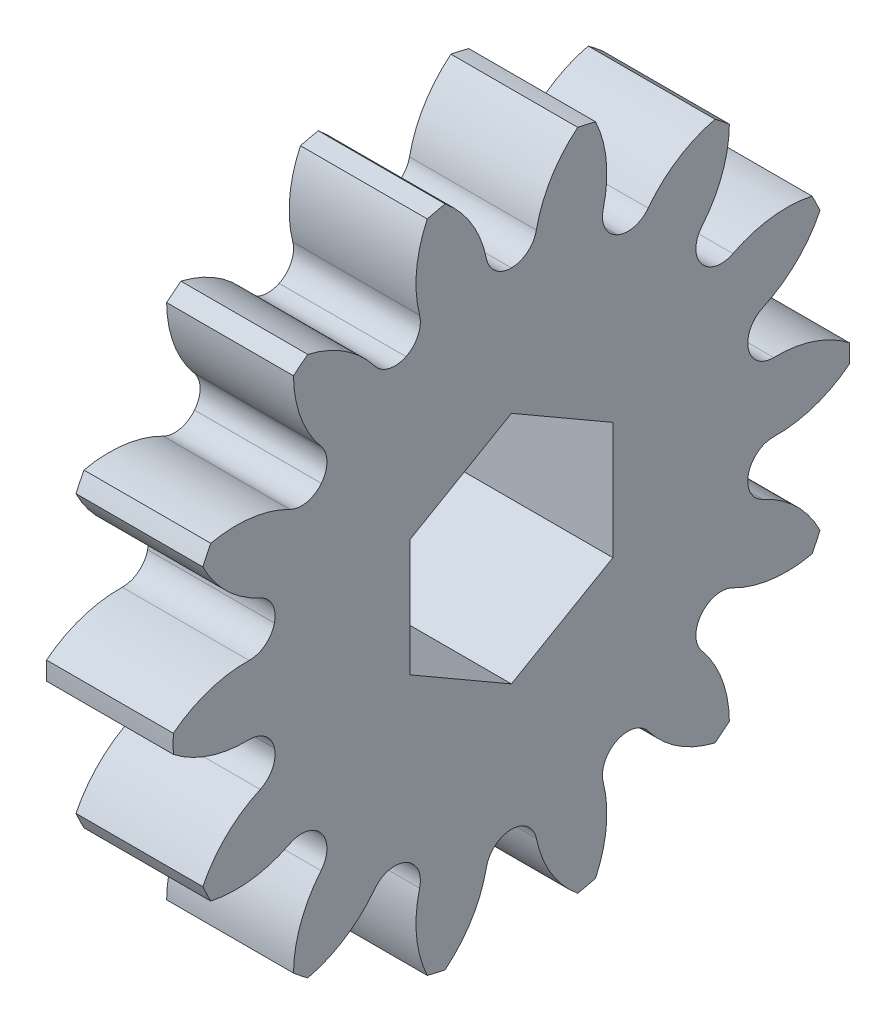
ISO-10303-21;
HEADER;
FILE_DESCRIPTION(('STEP AP214'),'2;1');
FILE_NAME('part.step','',(''),(''),'','','');
FILE_SCHEMA(('AUTOMOTIVE_DESIGN { 1 0 10303 214 1 1 1 1 }'));
ENDSEC;
DATA;
#1=APPLICATION_CONTEXT('core data for automotive mechanical design processes');
#2=APPLICATION_PROTOCOL_DEFINITION('international standard','automotive_design',2000,#1);
#3=PRODUCT_CONTEXT('',#1,'mechanical');
#4=PRODUCT('Part','Part','',(#3));
#5=PRODUCT_RELATED_PRODUCT_CATEGORY('part','',(#4));
#6=PRODUCT_DEFINITION_FORMATION('','',#4);
#7=PRODUCT_DEFINITION_CONTEXT('part definition',#1,'design');
#8=PRODUCT_DEFINITION('design','',#6,#7);
#9=PRODUCT_DEFINITION_SHAPE('','',#8);
#10=(LENGTH_UNIT() NAMED_UNIT(*) SI_UNIT(.MILLI.,.METRE.));
#11=(NAMED_UNIT(*) PLANE_ANGLE_UNIT() SI_UNIT($,.RADIAN.));
#12=(NAMED_UNIT(*) SI_UNIT($,.STERADIAN.) SOLID_ANGLE_UNIT());
#13=UNCERTAINTY_MEASURE_WITH_UNIT(LENGTH_MEASURE(1.E-05),#10,'distance_accuracy_value','');
#14=(GEOMETRIC_REPRESENTATION_CONTEXT(3) GLOBAL_UNCERTAINTY_ASSIGNED_CONTEXT((#13)) GLOBAL_UNIT_ASSIGNED_CONTEXT((#10,
#11,#12)) REPRESENTATION_CONTEXT('',''));
#15=CARTESIAN_POINT('',(0.,0.,0.));
#16=DIRECTION('',(0.,0.,1.));
#17=DIRECTION('',(1.,0.,0.));
#18=AXIS2_PLACEMENT_3D('',#15,#16,#17);
#19=CARTESIAN_POINT('',(0.,0.,0.));
#20=DIRECTION('',(-1.,0.,0.));
#21=DIRECTION('',(0.,0.,1.));
#22=AXIS2_PLACEMENT_3D('',#19,#20,#21);
#23=PLANE('',#22);
#24=CARTESIAN_POINT('',(0.,0.,0.));
#25=DIRECTION('',(-1.,0.,0.));
#26=DIRECTION('',(0.,0.,1.));
#27=AXIS2_PLACEMENT_3D('',#24,#25,#26);
#28=CIRCLE('',#27,28.749);
#29=CARTESIAN_POINT('',(0.,25.9054217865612,-12.4665200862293));
#30=VERTEX_POINT('',#29);
#31=CARTESIAN_POINT('',(0.,25.8984841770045,-12.480926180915));
#32=VERTEX_POINT('',#31);
#33=EDGE_CURVE('E682',#30,#32,#28,.T.);
#34=ORIENTED_EDGE('',*,*,#33,.T.);
#35=CARTESIAN_POINT('',(0.,28.601028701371,-13.7833289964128));
#36=DIRECTION('',(-1.,0.,0.));
#37=DIRECTION('',(0.,0.,1.));
#38=AXIS2_PLACEMENT_3D('',#35,#36,#37);
#39=CIRCLE('',#38,3.);
#40=CARTESIAN_POINT('',(0.,26.7857773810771,-16.1718144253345));
#41=VERTEX_POINT('',#40);
#42=EDGE_CURVE('E1314',#32,#41,#39,.F.);
#43=ORIENTED_EDGE('',*,*,#42,.T.);
#44=CARTESIAN_POINT('',(0.,18.314604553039,-27.3180797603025));
#45=DIRECTION('',(-1.,0.,0.));
#46=DIRECTION('',(0.,0.,1.));
#47=AXIS2_PLACEMENT_3D('',#44,#45,#46);
#48=CIRCLE('',#47,14.);
#49=CARTESIAN_POINT('',(0.,31.9361510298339,-24.0848968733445));
#50=VERTEX_POINT('',#49);
#51=EDGE_CURVE('E674',#41,#50,#48,.T.);
#52=ORIENTED_EDGE('',*,*,#51,.T.);
#53=CARTESIAN_POINT('',(0.,0.,0.));
#54=DIRECTION('',(-1.,0.,0.));
#55=DIRECTION('',(0.,0.,1.));
#56=AXIS2_PLACEMENT_3D('',#53,#54,#55);
#57=CIRCLE('',#56,40.);
#58=CARTESIAN_POINT('',(0.,30.5875003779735,-25.7760513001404));
#59=VERTEX_POINT('',#58);
#60=EDGE_CURVE('E1077',#50,#59,#57,.T.);
#61=ORIENTED_EDGE('',*,*,#60,.T.);
#62=CARTESIAN_POINT('',(0.,30.7085413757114,-11.7765745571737));
#63=DIRECTION('',(-1.,0.,0.));
#64=DIRECTION('',(0.,0.,1.));
#65=AXIS2_PLACEMENT_3D('',#62,#63,#64);
#66=CIRCLE('',#65,14.);
#67=CARTESIAN_POINT('',(0.,21.726749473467,-22.5156347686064));
#68=VERTEX_POINT('',#67);
#69=EDGE_CURVE('E1054',#59,#68,#66,.T.);
#70=ORIENTED_EDGE('',*,*,#69,.T.);
#71=CARTESIAN_POINT('',(0.,19.802079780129,-24.8168619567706));
#72=DIRECTION('',(-1.,0.,0.));
#73=DIRECTION('',(0.,0.,1.));
#74=AXIS2_PLACEMENT_3D('',#71,#72,#73);
#75=CIRCLE('',#74,3.);
#76=CARTESIAN_POINT('',(0.,17.9309581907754,-22.4718877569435));
#77=VERTEX_POINT('',#76);
#78=EDGE_CURVE('E1445',#68,#77,#75,.F.);
#79=ORIENTED_EDGE('',*,*,#78,.T.);
#80=CARTESIAN_POINT('',(0.,0.,0.));
#81=DIRECTION('',(-1.,0.,0.));
#82=DIRECTION('',(0.,0.,1.));
#83=AXIS2_PLACEMENT_3D('',#80,#81,#82);
#84=CIRCLE('',#83,28.749);
#85=CARTESIAN_POINT('',(0.,17.9184570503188,-22.4818570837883));
#86=VERTEX_POINT('',#85);
#87=EDGE_CURVE('E1059',#77,#86,#84,.T.);
#88=ORIENTED_EDGE('',*,*,#87,.T.);
#89=CARTESIAN_POINT('',(0.,19.7882741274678,-24.827871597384));
#90=DIRECTION('',(-1.,0.,0.));
#91=DIRECTION('',(0.,0.,1.));
#92=AXIS2_PLACEMENT_3D('',#89,#90,#91);
#93=CIRCLE('',#92,3.);
#94=CARTESIAN_POINT('',(0.,17.1164642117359,-26.1922145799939));
#95=VERTEX_POINT('',#94);
#96=EDGE_CURVE('E1308',#86,#95,#93,.F.);
#97=ORIENTED_EDGE('',*,*,#96,.T.);
#98=CARTESIAN_POINT('',(0.,4.64801793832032,-32.5591484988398));
#99=DIRECTION('',(-1.,0.,0.));
#100=DIRECTION('',(0.,0.,1.));
#101=AXIS2_PLACEMENT_3D('',#98,#99,#100);
#102=CIRCLE('',#101,14.);
#103=CARTESIAN_POINT('',(0.,18.3234327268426,-35.5563188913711));
#104=VERTEX_POINT('',#103);
#105=EDGE_CURVE('E1051',#95,#104,#102,.T.);
#106=ORIENTED_EDGE('',*,*,#105,.T.);
#107=CARTESIAN_POINT('',(0.,16.3745760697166,-36.4948387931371));
#108=VERTEX_POINT('',#107);
#109=EDGE_CURVE('E1081',#104,#108,#57,.T.);
#110=ORIENTED_EDGE('',*,*,#109,.T.);
#111=CARTESIAN_POINT('',(0.,22.557775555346,-23.9342638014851));
#112=DIRECTION('',(-1.,0.,0.));
#113=DIRECTION('',(0.,0.,1.));
#114=AXIS2_PLACEMENT_3D('',#111,#112,#113);
#115=CIRCLE('',#114,14.);
#116=CARTESIAN_POINT('',(0.,9.80595707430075,-29.712769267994));
#117=VERTEX_POINT('',#116);
#118=EDGE_CURVE('E1025',#108,#117,#115,.T.);
#119=ORIENTED_EDGE('',*,*,#118,.T.);
#120=CARTESIAN_POINT('',(0.,7.0734245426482,-30.9510204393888));
#121=DIRECTION('',(-1.,0.,0.));
#122=DIRECTION('',(0.,0.,1.));
#123=AXIS2_PLACEMENT_3D('',#120,#121,#122);
#124=CIRCLE('',#123,3.);
#125=CARTESIAN_POINT('',(0.,6.40504841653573,-28.0264224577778));
#126=VERTEX_POINT('',#125);
#127=EDGE_CURVE('E1320',#117,#126,#124,.F.);
#128=ORIENTED_EDGE('',*,*,#127,.T.);
#129=CARTESIAN_POINT('',(0.,0.,0.));
#130=DIRECTION('',(-1.,0.,0.));
#131=DIRECTION('',(0.,0.,1.));
#132=AXIS2_PLACEMENT_3D('',#129,#130,#131);
#133=CIRCLE('',#132,28.749);
#134=CARTESIAN_POINT('',(0.,6.38945974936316,-28.0299804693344));
#135=VERTEX_POINT('',#134);
#136=EDGE_CURVE('E1030',#126,#135,#133,.T.);
#137=ORIENTED_EDGE('',*,*,#136,.T.);
#138=CARTESIAN_POINT('',(0.,7.0562091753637,-30.9549497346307));
#139=DIRECTION('',(-1.,0.,0.));
#140=DIRECTION('',(0.,0.,1.));
#141=AXIS2_PLACEMENT_3D('',#138,#139,#140);
#142=CIRCLE('',#141,3.);
#143=CARTESIAN_POINT('',(0.,4.05702538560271,-31.0249254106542));
#144=VERTEX_POINT('',#143);
#145=EDGE_CURVE('E1332',#135,#144,#142,.F.);
#146=ORIENTED_EDGE('',*,*,#145,.T.);
#147=CARTESIAN_POINT('',(0.,-9.93916563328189,-31.3514785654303));
#148=DIRECTION('',(-1.,0.,0.));
#149=DIRECTION('',(0.,0.,1.));
#150=AXIS2_PLACEMENT_3D('',#147,#148,#149);
#151=CIRCLE('',#150,14.);
#152=CARTESIAN_POINT('',(0.,1.08153385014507,-39.9853758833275));
#153=VERTEX_POINT('',#152);
#154=EDGE_CURVE('E1022',#144,#153,#151,.T.);
#155=ORIENTED_EDGE('',*,*,#154,.T.);
#156=CARTESIAN_POINT('',(0.,-1.08153385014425,-39.9853758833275));
#157=VERTEX_POINT('',#156);
#158=EDGE_CURVE('E1086',#153,#157,#57,.T.);
#159=ORIENTED_EDGE('',*,*,#158,.T.);
#160=CARTESIAN_POINT('',(0.,9.93916563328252,-31.3514785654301));
#161=DIRECTION('',(-1.,0.,0.));
#162=DIRECTION('',(0.,0.,1.));
#163=AXIS2_PLACEMENT_3D('',#160,#161,#162);
#164=CIRCLE('',#163,14.);
#165=CARTESIAN_POINT('',(0.,-4.05702538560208,-31.0249254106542));
#166=VERTEX_POINT('',#165);
#167=EDGE_CURVE('E996',#157,#166,#164,.T.);
#168=ORIENTED_EDGE('',*,*,#167,.T.);
#169=CARTESIAN_POINT('',(0.,-7.05620917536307,-30.9549497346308));
#170=DIRECTION('',(-1.,0.,0.));
#171=DIRECTION('',(0.,0.,1.));
#172=AXIS2_PLACEMENT_3D('',#169,#170,#171);
#173=CIRCLE('',#172,3.);
#174=CARTESIAN_POINT('',(0.,-6.38945974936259,-28.0299804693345));
#175=VERTEX_POINT('',#174);
#176=EDGE_CURVE('E1344',#166,#175,#173,.F.);
#177=ORIENTED_EDGE('',*,*,#176,.T.);
#178=CARTESIAN_POINT('',(0.,0.,0.));
#179=DIRECTION('',(-1.,0.,0.));
#180=DIRECTION('',(0.,0.,1.));
#181=AXIS2_PLACEMENT_3D('',#178,#179,#180);
#182=CIRCLE('',#181,28.749);
#183=CARTESIAN_POINT('',(0.,-6.40504841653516,-28.026422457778));
#184=VERTEX_POINT('',#183);
#185=EDGE_CURVE('E1001',#175,#184,#182,.T.);
#186=ORIENTED_EDGE('',*,*,#185,.T.);
#187=CARTESIAN_POINT('',(0.,-7.07342454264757,-30.9510204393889));
#188=DIRECTION('',(-1.,0.,0.));
#189=DIRECTION('',(0.,0.,1.));
#190=AXIS2_PLACEMENT_3D('',#187,#188,#189);
#191=CIRCLE('',#190,3.);
#192=CARTESIAN_POINT('',(0.,-9.80595707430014,-29.7127692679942));
#193=VERTEX_POINT('',#192);
#194=EDGE_CURVE('E1355',#184,#193,#191,.F.);
#195=ORIENTED_EDGE('',*,*,#194,.T.);
#196=CARTESIAN_POINT('',(0.,-22.5577755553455,-23.9342638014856));
#197=DIRECTION('',(-1.,0.,0.));
#198=DIRECTION('',(0.,0.,1.));
#199=AXIS2_PLACEMENT_3D('',#196,#197,#198);
#200=CIRCLE('',#199,14.);
#201=CARTESIAN_POINT('',(0.,-16.3745760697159,-36.4948387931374));
#202=VERTEX_POINT('',#201);
#203=EDGE_CURVE('E993',#193,#202,#200,.T.);
#204=ORIENTED_EDGE('',*,*,#203,.T.);
#205=CARTESIAN_POINT('',(0.,-18.3234327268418,-35.5563188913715));
#206=VERTEX_POINT('',#205);
#207=EDGE_CURVE('E1615',#202,#206,#57,.T.);
#208=ORIENTED_EDGE('',*,*,#207,.T.);
#209=CARTESIAN_POINT('',(0.,-4.64801793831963,-32.5591484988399));
#210=DIRECTION('',(-1.,0.,0.));
#211=DIRECTION('',(0.,0.,1.));
#212=AXIS2_PLACEMENT_3D('',#209,#210,#211);
#213=CIRCLE('',#212,14.);
#214=CARTESIAN_POINT('',(0.,-17.1164642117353,-26.1922145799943));
#215=VERTEX_POINT('',#214);
#216=EDGE_CURVE('E967',#206,#215,#213,.T.);
#217=ORIENTED_EDGE('',*,*,#216,.T.);
#218=CARTESIAN_POINT('',(0.,-19.7882741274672,-24.8278715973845));
#219=DIRECTION('',(-1.,0.,0.));
#220=DIRECTION('',(0.,0.,1.));
#221=AXIS2_PLACEMENT_3D('',#218,#219,#220);
#222=CIRCLE('',#221,3.);
#223=CARTESIAN_POINT('',(0.,-17.9184570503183,-22.4818570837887));
#224=VERTEX_POINT('',#223);
#225=EDGE_CURVE('E1367',#215,#224,#222,.F.);
#226=ORIENTED_EDGE('',*,*,#225,.T.);
#227=CARTESIAN_POINT('',(0.,0.,0.));
#228=DIRECTION('',(-1.,0.,0.));
#229=DIRECTION('',(0.,0.,1.));
#230=AXIS2_PLACEMENT_3D('',#227,#228,#229);
#231=CIRCLE('',#230,28.749);
#232=CARTESIAN_POINT('',(0.,-17.9309581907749,-22.4718877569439));
#233=VERTEX_POINT('',#232);
#234=EDGE_CURVE('E972',#224,#233,#231,.T.);
#235=ORIENTED_EDGE('',*,*,#234,.T.);
#236=CARTESIAN_POINT('',(0.,-19.8020797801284,-24.816861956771));
#237=DIRECTION('',(-1.,0.,0.));
#238=DIRECTION('',(0.,0.,1.));
#239=AXIS2_PLACEMENT_3D('',#236,#237,#238);
#240=CIRCLE('',#239,3.);
#241=CARTESIAN_POINT('',(0.,-21.7267494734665,-22.5156347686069));
#242=VERTEX_POINT('',#241);
#243=EDGE_CURVE('E1379',#233,#242,#240,.F.);
#244=ORIENTED_EDGE('',*,*,#243,.T.);
#245=CARTESIAN_POINT('',(0.,-30.7085413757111,-11.7765745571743));
#246=DIRECTION('',(-1.,0.,0.));
#247=DIRECTION('',(0.,0.,1.));
#248=AXIS2_PLACEMENT_3D('',#245,#246,#247);
#249=CIRCLE('',#248,14.);
#250=CARTESIAN_POINT('',(0.,-30.587500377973,-25.7760513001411));
#251=VERTEX_POINT('',#250);
#252=EDGE_CURVE('E964',#242,#251,#249,.T.);
#253=ORIENTED_EDGE('',*,*,#252,.T.);
#254=CARTESIAN_POINT('',(0.,-31.9361510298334,-24.0848968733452));
#255=VERTEX_POINT('',#254);
#256=EDGE_CURVE('E1618',#251,#255,#57,.T.);
#257=ORIENTED_EDGE('',*,*,#256,.T.);
#258=CARTESIAN_POINT('',(0.,-18.3146045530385,-27.3180797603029));
#259=DIRECTION('',(-1.,0.,0.));
#260=DIRECTION('',(0.,0.,1.));
#261=AXIS2_PLACEMENT_3D('',#258,#259,#260);
#262=CIRCLE('',#261,14.);
#263=CARTESIAN_POINT('',(0.,-26.7857773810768,-16.171814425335));
#264=VERTEX_POINT('',#263);
#265=EDGE_CURVE('E938',#255,#264,#262,.T.);
#266=ORIENTED_EDGE('',*,*,#265,.T.);
#267=CARTESIAN_POINT('',(0.,-28.6010287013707,-13.7833289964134));
#268=DIRECTION('',(-1.,0.,0.));
#269=DIRECTION('',(0.,0.,1.));
#270=AXIS2_PLACEMENT_3D('',#267,#268,#269);
#271=CIRCLE('',#270,3.);
#272=CARTESIAN_POINT('',(0.,-25.8984841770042,-12.4809261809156));
#273=VERTEX_POINT('',#272);
#274=EDGE_CURVE('E1391',#264,#273,#271,.F.);
#275=ORIENTED_EDGE('',*,*,#274,.T.);
#276=CARTESIAN_POINT('',(0.,0.,0.));
#277=DIRECTION('',(-1.,0.,0.));
#278=DIRECTION('',(0.,0.,1.));
#279=AXIS2_PLACEMENT_3D('',#276,#277,#278);
#280=CIRCLE('',#279,28.749);
#281=CARTESIAN_POINT('',(0.,-25.9054217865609,-12.4665200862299));
#282=VERTEX_POINT('',#281);
#283=EDGE_CURVE('E943',#273,#282,#280,.T.);
#284=ORIENTED_EDGE('',*,*,#283,.T.);
#285=CARTESIAN_POINT('',(0.,-28.6086902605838,-13.7674196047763));
#286=DIRECTION('',(-1.,0.,0.));
#287=DIRECTION('',(0.,0.,1.));
#288=AXIS2_PLACEMENT_3D('',#285,#286,#287);
#289=CIRCLE('',#288,3.);
#290=CARTESIAN_POINT('',(0.,-29.3442926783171,-10.859002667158));
#291=VERTEX_POINT('',#290);
#292=EDGE_CURVE('E1403',#282,#291,#289,.F.);
#293=ORIENTED_EDGE('',*,*,#292,.T.);
#294=CARTESIAN_POINT('',(0.,-32.7771039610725,2.71360970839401));
#295=DIRECTION('',(-1.,0.,0.));
#296=DIRECTION('',(0.,0.,1.));
#297=AXIS2_PLACEMENT_3D('',#294,#295,#296);
#298=CIRCLE('',#297,14.);
#299=CARTESIAN_POINT('',(0.,-38.7421951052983,-9.95200072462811));
#300=VERTEX_POINT('',#299);
#301=EDGE_CURVE('E935',#291,#300,#298,.T.);
#302=ORIENTED_EDGE('',*,*,#301,.T.);
#303=CARTESIAN_POINT('',(0.,-39.2235229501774,-7.84316564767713));
#304=VERTEX_POINT('',#303);
#305=EDGE_CURVE('E1481',#300,#304,#57,.T.);
#306=ORIENTED_EDGE('',*,*,#305,.T.);
#307=CARTESIAN_POINT('',(0.,-28.3537591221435,-16.6663302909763));
#308=DIRECTION('',(-1.,0.,0.));
#309=DIRECTION('',(0.,0.,1.));
#310=AXIS2_PLACEMENT_3D('',#307,#308,#309);
#311=CIRCLE('',#310,14.);
#312=CARTESIAN_POINT('',(0.,-31.1498388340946,-2.94838808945));
#313=VERTEX_POINT('',#312);
#314=EDGE_CURVE('E909',#304,#313,#311,.T.);
#315=ORIENTED_EDGE('',*,*,#314,.T.);
#316=CARTESIAN_POINT('',(0.,-31.7489987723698,-0.00882904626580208));
#317=DIRECTION('',(-1.,0.,0.));
#318=DIRECTION('',(0.,0.,1.));
#319=AXIS2_PLACEMENT_3D('',#316,#317,#318);
#320=CIRCLE('',#319,3.);
#321=CARTESIAN_POINT('',(0.,-28.7489988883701,-0.00799477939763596));
#322=VERTEX_POINT('',#321);
#323=EDGE_CURVE('E1415',#313,#322,#320,.F.);
#324=ORIENTED_EDGE('',*,*,#323,.T.);
#325=CARTESIAN_POINT('',(0.,0.,0.));
#326=DIRECTION('',(-1.,0.,0.));
#327=DIRECTION('',(0.,0.,1.));
#328=AXIS2_PLACEMENT_3D('',#325,#326,#327);
#329=CIRCLE('',#328,28.749);
#330=CARTESIAN_POINT('',(0.,-28.7489988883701,0.00799477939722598));
#331=VERTEX_POINT('',#330);
#332=EDGE_CURVE('E914',#322,#331,#329,.T.);
#333=ORIENTED_EDGE('',*,*,#332,.T.);
#334=CARTESIAN_POINT('',(0.,-31.7489987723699,0.00882904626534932));
#335=DIRECTION('',(-1.,0.,0.));
#336=DIRECTION('',(0.,0.,1.));
#337=AXIS2_PLACEMENT_3D('',#334,#335,#336);
#338=CIRCLE('',#337,3.);
#339=CARTESIAN_POINT('',(0.,-31.1498388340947,2.94838808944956));
#340=VERTEX_POINT('',#339);
#341=EDGE_CURVE('E1427',#331,#340,#338,.F.);
#342=ORIENTED_EDGE('',*,*,#341,.T.);
#343=CARTESIAN_POINT('',(0.,-28.3537591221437,16.6663302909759));
#344=DIRECTION('',(-1.,0.,0.));
#345=DIRECTION('',(0.,0.,1.));
#346=AXIS2_PLACEMENT_3D('',#343,#344,#345);
#347=CIRCLE('',#346,14.);
#348=CARTESIAN_POINT('',(0.,-39.2235229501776,7.84316564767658));
#349=VERTEX_POINT('',#348);
#350=EDGE_CURVE('E906',#340,#349,#347,.T.);
#351=ORIENTED_EDGE('',*,*,#350,.T.);
#352=CARTESIAN_POINT('',(0.,-38.7421951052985,9.95200072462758));
#353=VERTEX_POINT('',#352);
#354=EDGE_CURVE('E1476',#349,#353,#57,.T.);
#355=ORIENTED_EDGE('',*,*,#354,.T.);
#356=CARTESIAN_POINT('',(0.,-32.7771039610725,-2.71360970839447));
#357=DIRECTION('',(-1.,0.,0.));
#358=DIRECTION('',(0.,0.,1.));
#359=AXIS2_PLACEMENT_3D('',#356,#357,#358);
#360=CIRCLE('',#359,14.);
#361=CARTESIAN_POINT('',(0.,-29.3442926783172,10.8590026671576));
#362=VERTEX_POINT('',#361);
#363=EDGE_CURVE('E880',#353,#362,#360,.T.);
#364=ORIENTED_EDGE('',*,*,#363,.T.);
#365=CARTESIAN_POINT('',(0.,-28.608690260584,13.7674196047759));
#366=DIRECTION('',(-1.,0.,0.));
#367=DIRECTION('',(0.,0.,1.));
#368=AXIS2_PLACEMENT_3D('',#365,#366,#367);
#369=CIRCLE('',#368,3.);
#370=CARTESIAN_POINT('',(0.,-25.9054217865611,12.4665200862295));
#371=VERTEX_POINT('',#370);
#372=EDGE_CURVE('E1439',#362,#371,#369,.F.);
#373=ORIENTED_EDGE('',*,*,#372,.T.);
#374=CARTESIAN_POINT('',(0.,0.,0.));
#375=DIRECTION('',(-1.,0.,0.));
#376=DIRECTION('',(0.,0.,1.));
#377=AXIS2_PLACEMENT_3D('',#374,#375,#376);
#378=CIRCLE('',#377,28.749);
#379=CARTESIAN_POINT('',(0.,-25.8984841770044,12.4809261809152));
#380=VERTEX_POINT('',#379);
#381=EDGE_CURVE('E885',#371,#380,#378,.T.);
#382=ORIENTED_EDGE('',*,*,#381,.T.);
#383=CARTESIAN_POINT('',(0.,-28.6010287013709,13.783328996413));
#384=DIRECTION('',(-1.,0.,0.));
#385=DIRECTION('',(0.,0.,1.));
#386=AXIS2_PLACEMENT_3D('',#383,#384,#385);
#387=CIRCLE('',#386,3.);
#388=CARTESIAN_POINT('',(0.,-26.785777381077,16.1718144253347));
#389=VERTEX_POINT('',#388);
#390=EDGE_CURVE('E11',#380,#389,#387,.F.);
#391=ORIENTED_EDGE('',*,*,#390,.T.);
#392=CARTESIAN_POINT('',(0.,-18.3146045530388,27.3180797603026));
#393=DIRECTION('',(-1.,0.,0.));
#394=DIRECTION('',(0.,0.,1.));
#395=AXIS2_PLACEMENT_3D('',#392,#393,#394);
#396=CIRCLE('',#395,14.);
#397=CARTESIAN_POINT('',(0.,-31.9361510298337,24.0848968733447));
#398=VERTEX_POINT('',#397);
#399=EDGE_CURVE('E877',#389,#398,#396,.T.);
#400=ORIENTED_EDGE('',*,*,#399,.T.);
#401=CARTESIAN_POINT('',(0.,-30.5875003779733,25.7760513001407));
#402=VERTEX_POINT('',#401);
#403=EDGE_CURVE('E1473',#398,#402,#57,.T.);
#404=ORIENTED_EDGE('',*,*,#403,.T.);
#405=CARTESIAN_POINT('',(0.,-30.7085413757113,11.7765745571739));
#406=DIRECTION('',(-1.,0.,0.));
#407=DIRECTION('',(0.,0.,1.));
#408=AXIS2_PLACEMENT_3D('',#405,#406,#407);
#409=CIRCLE('',#408,14.);
#410=CARTESIAN_POINT('',(0.,-21.7267494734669,22.5156347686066));
#411=VERTEX_POINT('',#410);
#412=EDGE_CURVE('E851',#402,#411,#409,.T.);
#413=ORIENTED_EDGE('',*,*,#412,.T.);
#414=CARTESIAN_POINT('',(0.,-19.8020797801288,24.8168619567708));
#415=DIRECTION('',(-1.,0.,0.));
#416=DIRECTION('',(0.,0.,1.));
#417=AXIS2_PLACEMENT_3D('',#414,#415,#416);
#418=CIRCLE('',#417,3.);
#419=CARTESIAN_POINT('',(0.,-17.9309581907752,22.4718877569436));
#420=VERTEX_POINT('',#419);
#421=EDGE_CURVE('E1361',#411,#420,#418,.F.);
#422=ORIENTED_EDGE('',*,*,#421,.T.);
#423=CARTESIAN_POINT('',(0.,0.,0.));
#424=DIRECTION('',(-1.,0.,0.));
#425=DIRECTION('',(0.,0.,1.));
#426=AXIS2_PLACEMENT_3D('',#423,#424,#425);
#427=CIRCLE('',#426,28.749);
#428=CARTESIAN_POINT('',(0.,-17.9184570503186,22.4818570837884));
#429=VERTEX_POINT('',#428);
#430=EDGE_CURVE('E856',#420,#429,#427,.T.);
#431=ORIENTED_EDGE('',*,*,#430,.T.);
#432=CARTESIAN_POINT('',(0.,-19.7882741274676,24.8278715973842));
#433=DIRECTION('',(-1.,0.,0.));
#434=DIRECTION('',(0.,0.,1.));
#435=AXIS2_PLACEMENT_3D('',#432,#433,#434);
#436=CIRCLE('',#435,3.);
#437=CARTESIAN_POINT('',(0.,-17.1164642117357,26.192214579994));
#438=VERTEX_POINT('',#437);
#439=EDGE_CURVE('E1290',#429,#438,#436,.F.);
#440=ORIENTED_EDGE('',*,*,#439,.T.);
#441=CARTESIAN_POINT('',(0.,-4.64801793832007,32.5591484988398));
#442=DIRECTION('',(-1.,0.,0.));
#443=DIRECTION('',(0.,0.,1.));
#444=AXIS2_PLACEMENT_3D('',#441,#442,#443);
#445=CIRCLE('',#444,14.);
#446=CARTESIAN_POINT('',(0.,-18.3234327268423,35.5563188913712));
#447=VERTEX_POINT('',#446);
#448=EDGE_CURVE('E848',#438,#447,#445,.T.);
#449=ORIENTED_EDGE('',*,*,#448,.T.);
#450=CARTESIAN_POINT('',(0.,-16.3745760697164,36.4948387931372));
#451=VERTEX_POINT('',#450);
#452=EDGE_CURVE('E1477',#447,#451,#57,.T.);
#453=ORIENTED_EDGE('',*,*,#452,.T.);
#454=CARTESIAN_POINT('',(0.,-22.5577755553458,23.9342638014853));
#455=DIRECTION('',(-1.,0.,0.));
#456=DIRECTION('',(0.,0.,1.));
#457=AXIS2_PLACEMENT_3D('',#454,#455,#456);
#458=CIRCLE('',#457,14.);
#459=CARTESIAN_POINT('',(0.,-9.80595707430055,29.7127692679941));
#460=VERTEX_POINT('',#459);
#461=EDGE_CURVE('E822',#451,#460,#458,.T.);
#462=ORIENTED_EDGE('',*,*,#461,.T.);
#463=CARTESIAN_POINT('',(0.,-7.07342454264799,30.9510204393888));
#464=DIRECTION('',(-1.,0.,0.));
#465=DIRECTION('',(0.,0.,1.));
#466=AXIS2_PLACEMENT_3D('',#463,#464,#465);
#467=CIRCLE('',#466,3.);
#468=CARTESIAN_POINT('',(0.,-6.40504841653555,28.0264224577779));
#469=VERTEX_POINT('',#468);
#470=EDGE_CURVE('E1373',#460,#469,#467,.F.);
#471=ORIENTED_EDGE('',*,*,#470,.T.);
#472=CARTESIAN_POINT('',(0.,0.,0.));
#473=DIRECTION('',(-1.,0.,0.));
#474=DIRECTION('',(0.,0.,1.));
#475=AXIS2_PLACEMENT_3D('',#472,#473,#474);
#476=CIRCLE('',#475,28.749);
#477=CARTESIAN_POINT('',(0.,-6.38945974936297,28.0299804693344));
#478=VERTEX_POINT('',#477);
#479=EDGE_CURVE('E827',#469,#478,#476,.T.);
#480=ORIENTED_EDGE('',*,*,#479,.T.);
#481=CARTESIAN_POINT('',(0.,-7.05620917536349,30.9549497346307));
#482=DIRECTION('',(-1.,0.,0.));
#483=DIRECTION('',(0.,0.,1.));
#484=AXIS2_PLACEMENT_3D('',#481,#482,#483);
#485=CIRCLE('',#484,3.);
#486=CARTESIAN_POINT('',(0.,-4.0570253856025,31.0249254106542));
#487=VERTEX_POINT('',#486);
#488=EDGE_CURVE('E1326',#478,#487,#485,.F.);
#489=ORIENTED_EDGE('',*,*,#488,.T.);
#490=CARTESIAN_POINT('',(0.,9.93916563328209,31.3514785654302));
#491=DIRECTION('',(-1.,0.,0.));
#492=DIRECTION('',(0.,0.,1.));
#493=AXIS2_PLACEMENT_3D('',#490,#491,#492);
#494=CIRCLE('',#493,14.);
#495=CARTESIAN_POINT('',(0.,-1.08153385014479,39.9853758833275));
#496=VERTEX_POINT('',#495);
#497=EDGE_CURVE('E819',#487,#496,#494,.T.);
#498=ORIENTED_EDGE('',*,*,#497,.T.);
#499=CARTESIAN_POINT('',(0.,1.08153385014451,39.9853758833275));
#500=VERTEX_POINT('',#499);
#501=EDGE_CURVE('E1483',#496,#500,#57,.T.);
#502=ORIENTED_EDGE('',*,*,#501,.T.);
#503=CARTESIAN_POINT('',(0.,-9.93916563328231,31.3514785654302));
#504=DIRECTION('',(-1.,0.,0.));
#505=DIRECTION('',(0.,0.,1.));
#506=AXIS2_PLACEMENT_3D('',#503,#504,#505);
#507=CIRCLE('',#506,14.);
#508=CARTESIAN_POINT('',(0.,4.05702538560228,31.0249254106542));
#509=VERTEX_POINT('',#508);
#510=EDGE_CURVE('E793',#500,#509,#507,.T.);
#511=ORIENTED_EDGE('',*,*,#510,.T.);
#512=CARTESIAN_POINT('',(0.,7.05620917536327,30.9549497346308));
#513=DIRECTION('',(-1.,0.,0.));
#514=DIRECTION('',(0.,0.,1.));
#515=AXIS2_PLACEMENT_3D('',#512,#513,#514);
#516=CIRCLE('',#515,3.);
#517=CARTESIAN_POINT('',(0.,6.38945974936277,28.0299804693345));
#518=VERTEX_POINT('',#517);
#519=EDGE_CURVE('E1385',#509,#518,#516,.F.);
#520=ORIENTED_EDGE('',*,*,#519,.T.);
#521=CARTESIAN_POINT('',(0.,0.,0.));
#522=DIRECTION('',(-1.,0.,0.));
#523=DIRECTION('',(0.,0.,1.));
#524=AXIS2_PLACEMENT_3D('',#521,#522,#523);
#525=CIRCLE('',#524,28.749);
#526=CARTESIAN_POINT('',(0.,6.40504841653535,28.0264224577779));
#527=VERTEX_POINT('',#526);
#528=EDGE_CURVE('E798',#518,#527,#525,.T.);
#529=ORIENTED_EDGE('',*,*,#528,.T.);
#530=CARTESIAN_POINT('',(0.,7.07342454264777,30.9510204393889));
#531=DIRECTION('',(-1.,0.,0.));
#532=DIRECTION('',(0.,0.,1.));
#533=AXIS2_PLACEMENT_3D('',#530,#531,#532);
#534=CIRCLE('',#533,3.);
#535=CARTESIAN_POINT('',(0.,9.80595707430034,29.7127692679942));
#536=VERTEX_POINT('',#535);
#537=EDGE_CURVE('E1302',#527,#536,#534,.F.);
#538=ORIENTED_EDGE('',*,*,#537,.T.);
#539=CARTESIAN_POINT('',(0.,22.5577755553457,23.9342638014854));
#540=DIRECTION('',(-1.,0.,0.));
#541=DIRECTION('',(0.,0.,1.));
#542=AXIS2_PLACEMENT_3D('',#539,#540,#541);
#543=CIRCLE('',#542,14.);
#544=CARTESIAN_POINT('',(0.,16.3745760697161,36.4948387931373));
#545=VERTEX_POINT('',#544);
#546=EDGE_CURVE('E790',#536,#545,#543,.T.);
#547=ORIENTED_EDGE('',*,*,#546,.T.);
#548=CARTESIAN_POINT('',(0.,18.3234327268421,35.5563188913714));
#549=VERTEX_POINT('',#548);
#550=EDGE_CURVE('E1487',#545,#549,#57,.T.);
#551=ORIENTED_EDGE('',*,*,#550,.T.);
#552=CARTESIAN_POINT('',(0.,4.64801793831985,32.5591484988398));
#553=DIRECTION('',(-1.,0.,0.));
#554=DIRECTION('',(0.,0.,1.));
#555=AXIS2_PLACEMENT_3D('',#552,#553,#554);
#556=CIRCLE('',#555,14.);
#557=CARTESIAN_POINT('',(0.,17.1164642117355,26.1922145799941));
#558=VERTEX_POINT('',#557);
#559=EDGE_CURVE('E764',#549,#558,#556,.T.);
#560=ORIENTED_EDGE('',*,*,#559,.T.);
#561=CARTESIAN_POINT('',(0.,19.7882741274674,24.8278715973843));
#562=DIRECTION('',(-1.,0.,0.));
#563=DIRECTION('',(0.,0.,1.));
#564=AXIS2_PLACEMENT_3D('',#561,#562,#563);
#565=CIRCLE('',#564,3.);
#566=CARTESIAN_POINT('',(0.,17.9184570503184,22.4818570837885));
#567=VERTEX_POINT('',#566);
#568=EDGE_CURVE('E1397',#558,#567,#565,.F.);
#569=ORIENTED_EDGE('',*,*,#568,.T.);
#570=CARTESIAN_POINT('',(0.,0.,0.));
#571=DIRECTION('',(-1.,0.,0.));
#572=DIRECTION('',(0.,0.,1.));
#573=AXIS2_PLACEMENT_3D('',#570,#571,#572);
#574=CIRCLE('',#573,28.749);
#575=CARTESIAN_POINT('',(0.,17.930958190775,22.4718877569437));
#576=VERTEX_POINT('',#575);
#577=EDGE_CURVE('E769',#567,#576,#574,.T.);
#578=ORIENTED_EDGE('',*,*,#577,.T.);
#579=CARTESIAN_POINT('',(0.,19.8020797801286,24.8168619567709));
#580=DIRECTION('',(-1.,0.,0.));
#581=DIRECTION('',(0.,0.,1.));
#582=AXIS2_PLACEMENT_3D('',#579,#580,#581);
#583=CIRCLE('',#582,3.);
#584=CARTESIAN_POINT('',(0.,21.7267494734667,22.5156347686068));
#585=VERTEX_POINT('',#584);
#586=EDGE_CURVE('E1338',#576,#585,#583,.F.);
#587=ORIENTED_EDGE('',*,*,#586,.T.);
#588=CARTESIAN_POINT('',(0.,30.7085413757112,11.7765745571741));
#589=DIRECTION('',(-1.,0.,0.));
#590=DIRECTION('',(0.,0.,1.));
#591=AXIS2_PLACEMENT_3D('',#588,#589,#590);
#592=CIRCLE('',#591,14.);
#593=CARTESIAN_POINT('',(0.,30.5875003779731,25.7760513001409));
#594=VERTEX_POINT('',#593);
#595=EDGE_CURVE('E761',#585,#594,#592,.T.);
#596=ORIENTED_EDGE('',*,*,#595,.T.);
#597=CARTESIAN_POINT('',(0.,31.9361510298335,24.084896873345));
#598=VERTEX_POINT('',#597);
#599=EDGE_CURVE('E1492',#594,#598,#57,.T.);
#600=ORIENTED_EDGE('',*,*,#599,.T.);
#601=CARTESIAN_POINT('',(0.,18.3146045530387,27.3180797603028));
#602=DIRECTION('',(-1.,0.,0.));
#603=DIRECTION('',(0.,0.,1.));
#604=AXIS2_PLACEMENT_3D('',#601,#602,#603);
#605=CIRCLE('',#604,14.);
#606=CARTESIAN_POINT('',(0.,26.7857773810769,16.1718144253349));
#607=VERTEX_POINT('',#606);
#608=EDGE_CURVE('E735',#598,#607,#605,.T.);
#609=ORIENTED_EDGE('',*,*,#608,.T.);
#610=CARTESIAN_POINT('',(0.,28.6010287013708,13.7833289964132));
#611=DIRECTION('',(-1.,0.,0.));
#612=DIRECTION('',(0.,0.,1.));
#613=AXIS2_PLACEMENT_3D('',#610,#611,#612);
#614=CIRCLE('',#613,3.);
#615=CARTESIAN_POINT('',(0.,25.8984841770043,12.4809261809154));
#616=VERTEX_POINT('',#615);
#617=EDGE_CURVE('E1409',#607,#616,#614,.F.);
#618=ORIENTED_EDGE('',*,*,#617,.T.);
#619=CARTESIAN_POINT('',(0.,0.,0.));
#620=DIRECTION('',(-1.,0.,0.));
#621=DIRECTION('',(0.,0.,1.));
#622=AXIS2_PLACEMENT_3D('',#619,#620,#621);
#623=CIRCLE('',#622,28.749);
#624=CARTESIAN_POINT('',(0.,25.905421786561,12.4665200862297));
#625=VERTEX_POINT('',#624);
#626=EDGE_CURVE('E740',#616,#625,#623,.T.);
#627=ORIENTED_EDGE('',*,*,#626,.T.);
#628=CARTESIAN_POINT('',(0.,28.6086902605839,13.7674196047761));
#629=DIRECTION('',(-1.,0.,0.));
#630=DIRECTION('',(0.,0.,1.));
#631=AXIS2_PLACEMENT_3D('',#628,#629,#630);
#632=CIRCLE('',#631,3.);
#633=CARTESIAN_POINT('',(0.,29.3442926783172,10.8590026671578));
#634=VERTEX_POINT('',#633);
#635=EDGE_CURVE('E1296',#625,#634,#632,.F.);
#636=ORIENTED_EDGE('',*,*,#635,.T.);
#637=CARTESIAN_POINT('',(0.,32.7771039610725,-2.71360970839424));
#638=DIRECTION('',(-1.,0.,0.));
#639=DIRECTION('',(0.,0.,1.));
#640=AXIS2_PLACEMENT_3D('',#637,#638,#639);
#641=CIRCLE('',#640,14.);
#642=CARTESIAN_POINT('',(0.,38.7421951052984,9.95200072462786));
#643=VERTEX_POINT('',#642);
#644=EDGE_CURVE('E732',#634,#643,#641,.T.);
#645=ORIENTED_EDGE('',*,*,#644,.T.);
#646=CARTESIAN_POINT('',(0.,39.2235229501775,7.84316564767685));
#647=VERTEX_POINT('',#646);
#648=EDGE_CURVE('E1497',#643,#647,#57,.T.);
#649=ORIENTED_EDGE('',*,*,#648,.T.);
#650=CARTESIAN_POINT('',(0.,28.3537591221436,16.6663302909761));
#651=DIRECTION('',(-1.,0.,0.));
#652=DIRECTION('',(0.,0.,1.));
#653=AXIS2_PLACEMENT_3D('',#650,#651,#652);
#654=CIRCLE('',#653,14.);
#655=CARTESIAN_POINT('',(0.,31.1498388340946,2.94838808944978));
#656=VERTEX_POINT('',#655);
#657=EDGE_CURVE('E706',#647,#656,#654,.T.);
#658=ORIENTED_EDGE('',*,*,#657,.T.);
#659=CARTESIAN_POINT('',(0.,31.7489987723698,0.00882904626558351));
#660=DIRECTION('',(-1.,0.,0.));
#661=DIRECTION('',(0.,0.,1.));
#662=AXIS2_PLACEMENT_3D('',#659,#660,#661);
#663=CIRCLE('',#662,3.);
#664=CARTESIAN_POINT('',(0.,28.74899888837,0.00799477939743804));
#665=VERTEX_POINT('',#664);
#666=EDGE_CURVE('E1421',#656,#665,#663,.F.);
#667=ORIENTED_EDGE('',*,*,#666,.T.);
#668=CARTESIAN_POINT('',(0.,0.,0.));
#669=DIRECTION('',(-1.,0.,0.));
#670=DIRECTION('',(0.,0.,1.));
#671=AXIS2_PLACEMENT_3D('',#668,#669,#670);
#672=CIRCLE('',#671,28.749);
#673=CARTESIAN_POINT('',(0.,28.74899888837,-0.00799477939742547));
#674=VERTEX_POINT('',#673);
#675=EDGE_CURVE('E711',#665,#674,#672,.T.);
#676=ORIENTED_EDGE('',*,*,#675,.T.);
#677=CARTESIAN_POINT('',(0.,31.7489987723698,-0.00882904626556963));
#678=DIRECTION('',(-1.,0.,0.));
#679=DIRECTION('',(0.,0.,1.));
#680=AXIS2_PLACEMENT_3D('',#677,#678,#679);
#681=CIRCLE('',#680,3.);
#682=CARTESIAN_POINT('',(0.,31.1498388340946,-2.94838808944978));
#683=VERTEX_POINT('',#682);
#684=EDGE_CURVE('E1349',#674,#683,#681,.F.);
#685=ORIENTED_EDGE('',*,*,#684,.T.);
#686=CARTESIAN_POINT('',(0.,28.3537591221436,-16.6663302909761));
#687=DIRECTION('',(-1.,0.,0.));
#688=DIRECTION('',(0.,0.,1.));
#689=AXIS2_PLACEMENT_3D('',#686,#687,#688);
#690=CIRCLE('',#689,14.);
#691=CARTESIAN_POINT('',(0.,39.2235229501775,-7.84316564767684));
#692=VERTEX_POINT('',#691);
#693=EDGE_CURVE('E703',#683,#692,#690,.T.);
#694=ORIENTED_EDGE('',*,*,#693,.T.);
#695=CARTESIAN_POINT('',(0.,38.7421951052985,-9.95200072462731));
#696=VERTEX_POINT('',#695);
#697=EDGE_CURVE('E1501',#692,#696,#57,.T.);
#698=ORIENTED_EDGE('',*,*,#697,.T.);
#699=CARTESIAN_POINT('',(0.,32.7771039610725,2.7136097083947));
#700=DIRECTION('',(-1.,0.,0.));
#701=DIRECTION('',(0.,0.,1.));
#702=AXIS2_PLACEMENT_3D('',#699,#700,#701);
#703=CIRCLE('',#702,14.);
#704=CARTESIAN_POINT('',(0.,29.3442926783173,-10.8590026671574));
#705=VERTEX_POINT('',#704);
#706=EDGE_CURVE('E677',#696,#705,#703,.T.);
#707=ORIENTED_EDGE('',*,*,#706,.T.);
#708=CARTESIAN_POINT('',(0.,28.6086902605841,-13.7674196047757));
#709=DIRECTION('',(-1.,0.,0.));
#710=DIRECTION('',(0.,0.,1.));
#711=AXIS2_PLACEMENT_3D('',#708,#709,#710);
#712=CIRCLE('',#711,3.);
#713=EDGE_CURVE('E1433',#705,#30,#712,.F.);
#714=ORIENTED_EDGE('',*,*,#713,.T.);
#715=EDGE_LOOP('',(#34,#43,#52,#61,#70,#79,#88,#97,#106,#110,#119,#128,#137,#146,#155,#159,#168,
#177,#186,#195,#204,#208,#217,#226,#235,#244,#253,#257,#266,#275,#284,#293,#302,#306,#315,#324,
#333,#342,#351,#355,#364,#373,#382,#391,#400,#404,#413,#422,#431,#440,#449,#453,#462,#471,#480,
#489,#498,#502,#511,#520,#529,#538,#547,#551,#560,#569,#578,#587,#596,#600,#609,#618,#627,#636,
#645,#649,#658,#667,#676,#685,#694,#698,#707,#714));
#716=FACE_BOUND('',#715,.T.);
#717=CARTESIAN_POINT('',(0.,0.,0.));
#718=DIRECTION('',(-1.,0.,0.));
#719=DIRECTION('',(0.,0.,1.));
#720=AXIS2_PLACEMENT_3D('',#717,#718,#719);
#721=CIRCLE('',#720,19.5);
#722=CARTESIAN_POINT('',(0.,0.,19.5));
#723=VERTEX_POINT('',#722);
#724=EDGE_CURVE('E654',#723,#723,#721,.T.);
#725=ORIENTED_EDGE('',*,*,#724,.F.);
#726=EDGE_LOOP('',(#725));
#727=FACE_BOUND('',#726,.T.);
#728=ADVANCED_FACE('F36',(#716,#727),#23,.T.);
#729=CARTESIAN_POINT('',(15.,0.,0.));
#730=DIRECTION('',(-1.,0.,0.));
#731=DIRECTION('',(0.,0.,1.));
#732=AXIS2_PLACEMENT_3D('',#729,#730,#731);
#733=CYLINDRICAL_SURFACE('',#732,40.);
#734=DIRECTION('',(1.,0.,0.));
#735=VECTOR('',#734,1.);
#736=CARTESIAN_POINT('',(0.,31.9361510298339,-24.0848968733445));
#737=LINE('',#736,#735);
#738=CARTESIAN_POINT('',(15.,31.9361510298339,-24.0848968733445));
#739=VERTEX_POINT('',#738);
#740=EDGE_CURVE('E686',#50,#739,#737,.T.);
#741=ORIENTED_EDGE('',*,*,#740,.T.);
#742=CARTESIAN_POINT('',(15.,0.,0.));
#743=DIRECTION('',(-1.,0.,0.));
#744=DIRECTION('',(0.,0.,1.));
#745=AXIS2_PLACEMENT_3D('',#742,#743,#744);
#746=CIRCLE('',#745,40.);
#747=CARTESIAN_POINT('',(15.,30.5875003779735,-25.7760513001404));
#748=VERTEX_POINT('',#747);
#749=EDGE_CURVE('E1085',#739,#748,#746,.T.);
#750=ORIENTED_EDGE('',*,*,#749,.T.);
#751=DIRECTION('',(1.,0.,0.));
#752=VECTOR('',#751,1.);
#753=CARTESIAN_POINT('',(0.,30.5875003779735,-25.7760513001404));
#754=LINE('',#753,#752);
#755=EDGE_CURVE('E1073',#59,#748,#754,.T.);
#756=ORIENTED_EDGE('',*,*,#755,.F.);
#757=ORIENTED_EDGE('',*,*,#60,.F.);
#758=EDGE_LOOP('',(#741,#750,#756,#757));
#759=FACE_BOUND('',#758,.T.);
#760=ADVANCED_FACE('F1518',(#759),#733,.T.);
#761=DIRECTION('',(1.,0.,0.));
#762=VECTOR('',#761,1.);
#763=CARTESIAN_POINT('',(0.,38.7421951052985,-9.95200072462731));
#764=LINE('',#763,#762);
#765=CARTESIAN_POINT('',(15.,38.7421951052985,-9.95200072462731));
#766=VERTEX_POINT('',#765);
#767=EDGE_CURVE('E696',#696,#766,#764,.T.);
#768=ORIENTED_EDGE('',*,*,#767,.F.);
#769=ORIENTED_EDGE('',*,*,#697,.F.);
#770=DIRECTION('',(1.,0.,0.));
#771=VECTOR('',#770,1.);
#772=CARTESIAN_POINT('',(0.,39.2235229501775,-7.84316564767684));
#773=LINE('',#772,#771);
#774=CARTESIAN_POINT('',(15.,39.2235229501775,-7.84316564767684));
#775=VERTEX_POINT('',#774);
#776=EDGE_CURVE('E715',#692,#775,#773,.T.);
#777=ORIENTED_EDGE('',*,*,#776,.T.);
#778=EDGE_CURVE('E1520',#775,#766,#746,.T.);
#779=ORIENTED_EDGE('',*,*,#778,.T.);
#780=EDGE_LOOP('',(#768,#769,#777,#779));
#781=FACE_BOUND('',#780,.T.);
#782=ADVANCED_FACE('F1677',(#781),#733,.T.);
#783=DIRECTION('',(1.,0.,0.));
#784=VECTOR('',#783,1.);
#785=CARTESIAN_POINT('',(0.,39.2235229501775,7.84316564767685));
#786=LINE('',#785,#784);
#787=CARTESIAN_POINT('',(15.,39.2235229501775,7.84316564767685));
#788=VERTEX_POINT('',#787);
#789=EDGE_CURVE('E725',#647,#788,#786,.T.);
#790=ORIENTED_EDGE('',*,*,#789,.F.);
#791=ORIENTED_EDGE('',*,*,#648,.F.);
#792=DIRECTION('',(1.,0.,0.));
#793=VECTOR('',#792,1.);
#794=CARTESIAN_POINT('',(0.,38.7421951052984,9.95200072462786));
#795=LINE('',#794,#793);
#796=CARTESIAN_POINT('',(15.,38.7421951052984,9.95200072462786));
#797=VERTEX_POINT('',#796);
#798=EDGE_CURVE('E744',#643,#797,#795,.T.);
#799=ORIENTED_EDGE('',*,*,#798,.T.);
#800=EDGE_CURVE('E1523',#797,#788,#746,.T.);
#801=ORIENTED_EDGE('',*,*,#800,.T.);
#802=EDGE_LOOP('',(#790,#791,#799,#801));
#803=FACE_BOUND('',#802,.T.);
#804=ADVANCED_FACE('F2378',(#803),#733,.T.);
#805=DIRECTION('',(1.,0.,0.));
#806=VECTOR('',#805,1.);
#807=CARTESIAN_POINT('',(0.,31.9361510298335,24.084896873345));
#808=LINE('',#807,#806);
#809=CARTESIAN_POINT('',(15.,31.9361510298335,24.084896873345));
#810=VERTEX_POINT('',#809);
#811=EDGE_CURVE('E754',#598,#810,#808,.T.);
#812=ORIENTED_EDGE('',*,*,#811,.F.);
#813=ORIENTED_EDGE('',*,*,#599,.F.);
#814=DIRECTION('',(1.,0.,0.));
#815=VECTOR('',#814,1.);
#816=CARTESIAN_POINT('',(0.,30.5875003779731,25.7760513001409));
#817=LINE('',#816,#815);
#818=CARTESIAN_POINT('',(15.,30.5875003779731,25.7760513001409));
#819=VERTEX_POINT('',#818);
#820=EDGE_CURVE('E773',#594,#819,#817,.T.);
#821=ORIENTED_EDGE('',*,*,#820,.T.);
#822=EDGE_CURVE('E1529',#819,#810,#746,.T.);
#823=ORIENTED_EDGE('',*,*,#822,.T.);
#824=EDGE_LOOP('',(#812,#813,#821,#823));
#825=FACE_BOUND('',#824,.T.);
#826=ADVANCED_FACE('F2397',(#825),#733,.T.);
#827=DIRECTION('',(1.,0.,0.));
#828=VECTOR('',#827,1.);
#829=CARTESIAN_POINT('',(0.,18.3234327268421,35.5563188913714));
#830=LINE('',#829,#828);
#831=CARTESIAN_POINT('',(15.,18.3234327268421,35.5563188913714));
#832=VERTEX_POINT('',#831);
#833=EDGE_CURVE('E783',#549,#832,#830,.T.);
#834=ORIENTED_EDGE('',*,*,#833,.F.);
#835=ORIENTED_EDGE('',*,*,#550,.F.);
#836=DIRECTION('',(1.,0.,0.));
#837=VECTOR('',#836,1.);
#838=CARTESIAN_POINT('',(0.,16.3745760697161,36.4948387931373));
#839=LINE('',#838,#837);
#840=CARTESIAN_POINT('',(15.,16.3745760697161,36.4948387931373));
#841=VERTEX_POINT('',#840);
#842=EDGE_CURVE('E802',#545,#841,#839,.T.);
#843=ORIENTED_EDGE('',*,*,#842,.T.);
#844=EDGE_CURVE('E1535',#841,#832,#746,.T.);
#845=ORIENTED_EDGE('',*,*,#844,.T.);
#846=EDGE_LOOP('',(#834,#835,#843,#845));
#847=FACE_BOUND('',#846,.T.);
#848=ADVANCED_FACE('F2417',(#847),#733,.T.);
#849=DIRECTION('',(1.,0.,0.));
#850=VECTOR('',#849,1.);
#851=CARTESIAN_POINT('',(0.,1.08153385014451,39.9853758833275));
#852=LINE('',#851,#850);
#853=CARTESIAN_POINT('',(15.,1.08153385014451,39.9853758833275));
#854=VERTEX_POINT('',#853);
#855=EDGE_CURVE('E812',#500,#854,#852,.T.);
#856=ORIENTED_EDGE('',*,*,#855,.F.);
#857=ORIENTED_EDGE('',*,*,#501,.F.);
#858=DIRECTION('',(1.,0.,0.));
#859=VECTOR('',#858,1.);
#860=CARTESIAN_POINT('',(0.,-1.08153385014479,39.9853758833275));
#861=LINE('',#860,#859);
#862=CARTESIAN_POINT('',(15.,-1.08153385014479,39.9853758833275));
#863=VERTEX_POINT('',#862);
#864=EDGE_CURVE('E831',#496,#863,#861,.T.);
#865=ORIENTED_EDGE('',*,*,#864,.T.);
#866=EDGE_CURVE('E1541',#863,#854,#746,.T.);
#867=ORIENTED_EDGE('',*,*,#866,.T.);
#868=EDGE_LOOP('',(#856,#857,#865,#867));
#869=FACE_BOUND('',#868,.T.);
#870=ADVANCED_FACE('F2437',(#869),#733,.T.);
#871=DIRECTION('',(1.,0.,0.));
#872=VECTOR('',#871,1.);
#873=CARTESIAN_POINT('',(0.,-16.3745760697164,36.4948387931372));
#874=LINE('',#873,#872);
#875=CARTESIAN_POINT('',(15.,-16.3745760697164,36.4948387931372));
#876=VERTEX_POINT('',#875);
#877=EDGE_CURVE('E841',#451,#876,#874,.T.);
#878=ORIENTED_EDGE('',*,*,#877,.F.);
#879=ORIENTED_EDGE('',*,*,#452,.F.);
#880=DIRECTION('',(1.,0.,0.));
#881=VECTOR('',#880,1.);
#882=CARTESIAN_POINT('',(0.,-18.3234327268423,35.5563188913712));
#883=LINE('',#882,#881);
#884=CARTESIAN_POINT('',(15.,-18.3234327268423,35.5563188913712));
#885=VERTEX_POINT('',#884);
#886=EDGE_CURVE('E860',#447,#885,#883,.T.);
#887=ORIENTED_EDGE('',*,*,#886,.T.);
#888=EDGE_CURVE('E1547',#885,#876,#746,.T.);
#889=ORIENTED_EDGE('',*,*,#888,.T.);
#890=EDGE_LOOP('',(#878,#879,#887,#889));
#891=FACE_BOUND('',#890,.T.);
#892=ADVANCED_FACE('F1668',(#891),#733,.T.);
#893=DIRECTION('',(1.,0.,0.));
#894=VECTOR('',#893,1.);
#895=CARTESIAN_POINT('',(0.,-30.5875003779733,25.7760513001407));
#896=LINE('',#895,#894);
#897=CARTESIAN_POINT('',(15.,-30.5875003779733,25.7760513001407));
#898=VERTEX_POINT('',#897);
#899=EDGE_CURVE('E870',#402,#898,#896,.T.);
#900=ORIENTED_EDGE('',*,*,#899,.F.);
#901=ORIENTED_EDGE('',*,*,#403,.F.);
#902=DIRECTION('',(1.,0.,0.));
#903=VECTOR('',#902,1.);
#904=CARTESIAN_POINT('',(0.,-31.9361510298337,24.0848968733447));
#905=LINE('',#904,#903);
#906=CARTESIAN_POINT('',(15.,-31.9361510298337,24.0848968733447));
#907=VERTEX_POINT('',#906);
#908=EDGE_CURVE('E889',#398,#907,#905,.T.);
#909=ORIENTED_EDGE('',*,*,#908,.T.);
#910=EDGE_CURVE('E1552',#907,#898,#746,.T.);
#911=ORIENTED_EDGE('',*,*,#910,.T.);
#912=EDGE_LOOP('',(#900,#901,#909,#911));
#913=FACE_BOUND('',#912,.T.);
#914=ADVANCED_FACE('F1474',(#913),#733,.T.);
#915=DIRECTION('',(1.,0.,0.));
#916=VECTOR('',#915,1.);
#917=CARTESIAN_POINT('',(0.,-38.7421951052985,9.95200072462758));
#918=LINE('',#917,#916);
#919=CARTESIAN_POINT('',(15.,-38.7421951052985,9.95200072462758));
#920=VERTEX_POINT('',#919);
#921=EDGE_CURVE('E899',#353,#920,#918,.T.);
#922=ORIENTED_EDGE('',*,*,#921,.F.);
#923=ORIENTED_EDGE('',*,*,#354,.F.);
#924=DIRECTION('',(1.,0.,0.));
#925=VECTOR('',#924,1.);
#926=CARTESIAN_POINT('',(0.,-39.2235229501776,7.84316564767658));
#927=LINE('',#926,#925);
#928=CARTESIAN_POINT('',(15.,-39.2235229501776,7.84316564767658));
#929=VERTEX_POINT('',#928);
#930=EDGE_CURVE('E918',#349,#929,#927,.T.);
#931=ORIENTED_EDGE('',*,*,#930,.T.);
#932=EDGE_CURVE('E1557',#929,#920,#746,.T.);
#933=ORIENTED_EDGE('',*,*,#932,.T.);
#934=EDGE_LOOP('',(#922,#923,#931,#933));
#935=FACE_BOUND('',#934,.T.);
#936=ADVANCED_FACE('F1660',(#935),#733,.T.);
#937=DIRECTION('',(1.,0.,0.));
#938=VECTOR('',#937,1.);
#939=CARTESIAN_POINT('',(0.,-39.2235229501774,-7.84316564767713));
#940=LINE('',#939,#938);
#941=CARTESIAN_POINT('',(15.,-39.2235229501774,-7.84316564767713));
#942=VERTEX_POINT('',#941);
#943=EDGE_CURVE('E928',#304,#942,#940,.T.);
#944=ORIENTED_EDGE('',*,*,#943,.F.);
#945=ORIENTED_EDGE('',*,*,#305,.F.);
#946=DIRECTION('',(1.,0.,0.));
#947=VECTOR('',#946,1.);
#948=CARTESIAN_POINT('',(0.,-38.7421951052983,-9.95200072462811));
#949=LINE('',#948,#947);
#950=CARTESIAN_POINT('',(15.,-38.7421951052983,-9.95200072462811));
#951=VERTEX_POINT('',#950);
#952=EDGE_CURVE('E947',#300,#951,#949,.T.);
#953=ORIENTED_EDGE('',*,*,#952,.T.);
#954=EDGE_CURVE('E1560',#951,#942,#746,.T.);
#955=ORIENTED_EDGE('',*,*,#954,.T.);
#956=EDGE_LOOP('',(#944,#945,#953,#955));
#957=FACE_BOUND('',#956,.T.);
#958=ADVANCED_FACE('F1629',(#957),#733,.T.);
#959=DIRECTION('',(1.,0.,0.));
#960=VECTOR('',#959,1.);
#961=CARTESIAN_POINT('',(0.,-31.9361510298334,-24.0848968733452));
#962=LINE('',#961,#960);
#963=CARTESIAN_POINT('',(15.,-31.9361510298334,-24.0848968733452));
#964=VERTEX_POINT('',#963);
#965=EDGE_CURVE('E957',#255,#964,#962,.T.);
#966=ORIENTED_EDGE('',*,*,#965,.F.);
#967=ORIENTED_EDGE('',*,*,#256,.F.);
#968=DIRECTION('',(1.,0.,0.));
#969=VECTOR('',#968,1.);
#970=CARTESIAN_POINT('',(0.,-30.587500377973,-25.7760513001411));
#971=LINE('',#970,#969);
#972=CARTESIAN_POINT('',(15.,-30.587500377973,-25.7760513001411));
#973=VERTEX_POINT('',#972);
#974=EDGE_CURVE('E976',#251,#973,#971,.T.);
#975=ORIENTED_EDGE('',*,*,#974,.T.);
#976=EDGE_CURVE('E1566',#973,#964,#746,.T.);
#977=ORIENTED_EDGE('',*,*,#976,.T.);
#978=EDGE_LOOP('',(#966,#967,#975,#977));
#979=FACE_BOUND('',#978,.T.);
#980=ADVANCED_FACE('F1667',(#979),#733,.T.);
#981=DIRECTION('',(1.,0.,0.));
#982=VECTOR('',#981,1.);
#983=CARTESIAN_POINT('',(0.,-18.3234327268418,-35.5563188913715));
#984=LINE('',#983,#982);
#985=CARTESIAN_POINT('',(15.,-18.3234327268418,-35.5563188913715));
#986=VERTEX_POINT('',#985);
#987=EDGE_CURVE('E986',#206,#986,#984,.T.);
#988=ORIENTED_EDGE('',*,*,#987,.F.);
#989=ORIENTED_EDGE('',*,*,#207,.F.);
#990=DIRECTION('',(1.,0.,0.));
#991=VECTOR('',#990,1.);
#992=CARTESIAN_POINT('',(0.,-16.3745760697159,-36.4948387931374));
#993=LINE('',#992,#991);
#994=CARTESIAN_POINT('',(15.,-16.3745760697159,-36.4948387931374));
#995=VERTEX_POINT('',#994);
#996=EDGE_CURVE('E1005',#202,#995,#993,.T.);
#997=ORIENTED_EDGE('',*,*,#996,.T.);
#998=EDGE_CURVE('E1572',#995,#986,#746,.T.);
#999=ORIENTED_EDGE('',*,*,#998,.T.);
#1000=EDGE_LOOP('',(#988,#989,#997,#999));
#1001=FACE_BOUND('',#1000,.T.);
#1002=ADVANCED_FACE('F1616',(#1001),#733,.T.);
#1003=DIRECTION('',(1.,0.,0.));
#1004=VECTOR('',#1003,1.);
#1005=CARTESIAN_POINT('',(0.,-1.08153385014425,-39.9853758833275));
#1006=LINE('',#1005,#1004);
#1007=CARTESIAN_POINT('',(15.,-1.08153385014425,-39.9853758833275));
#1008=VERTEX_POINT('',#1007);
#1009=EDGE_CURVE('E1015',#157,#1008,#1006,.T.);
#1010=ORIENTED_EDGE('',*,*,#1009,.F.);
#1011=ORIENTED_EDGE('',*,*,#158,.F.);
#1012=DIRECTION('',(1.,0.,0.));
#1013=VECTOR('',#1012,1.);
#1014=CARTESIAN_POINT('',(0.,1.08153385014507,-39.9853758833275));
#1015=LINE('',#1014,#1013);
#1016=CARTESIAN_POINT('',(15.,1.08153385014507,-39.9853758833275));
#1017=VERTEX_POINT('',#1016);
#1018=EDGE_CURVE('E1034',#153,#1017,#1015,.T.);
#1019=ORIENTED_EDGE('',*,*,#1018,.T.);
#1020=EDGE_CURVE('E1092',#1017,#1008,#746,.T.);
#1021=ORIENTED_EDGE('',*,*,#1020,.T.);
#1022=EDGE_LOOP('',(#1010,#1011,#1019,#1021));
#1023=FACE_BOUND('',#1022,.T.);
#1024=ADVANCED_FACE('F1586',(#1023),#733,.T.);
#1025=DIRECTION('',(1.,0.,0.));
#1026=VECTOR('',#1025,1.);
#1027=CARTESIAN_POINT('',(0.,16.3745760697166,-36.4948387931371));
#1028=LINE('',#1027,#1026);
#1029=CARTESIAN_POINT('',(15.,16.3745760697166,-36.4948387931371));
#1030=VERTEX_POINT('',#1029);
#1031=EDGE_CURVE('E1044',#108,#1030,#1028,.T.);
#1032=ORIENTED_EDGE('',*,*,#1031,.F.);
#1033=ORIENTED_EDGE('',*,*,#109,.F.);
#1034=DIRECTION('',(1.,0.,0.));
#1035=VECTOR('',#1034,1.);
#1036=CARTESIAN_POINT('',(0.,18.3234327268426,-35.5563188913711));
#1037=LINE('',#1036,#1035);
#1038=CARTESIAN_POINT('',(15.,18.3234327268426,-35.5563188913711));
#1039=VERTEX_POINT('',#1038);
#1040=EDGE_CURVE('E1063',#104,#1039,#1037,.T.);
#1041=ORIENTED_EDGE('',*,*,#1040,.T.);
#1042=EDGE_CURVE('E1087',#1039,#1030,#746,.T.);
#1043=ORIENTED_EDGE('',*,*,#1042,.T.);
#1044=EDGE_LOOP('',(#1032,#1033,#1041,#1043));
#1045=FACE_BOUND('',#1044,.T.);
#1046=ADVANCED_FACE('F1669',(#1045),#733,.T.);
#1047=CARTESIAN_POINT('',(15.,40.,0.));
#1048=DIRECTION('',(1.,0.,0.));
#1049=DIRECTION('',(0.,0.,-1.));
#1050=AXIS2_PLACEMENT_3D('',#1047,#1048,#1049);
#1051=PLANE('',#1050);
#1052=DIRECTION('',(0.,0.5,0.866025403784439));
#1053=VECTOR('',#1052,1.);
#1054=CARTESIAN_POINT('',(15.,6.92820323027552,-12.));
#1055=LINE('',#1054,#1053);
#1056=CARTESIAN_POINT('',(15.,6.92820323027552,-12.));
#1057=VERTEX_POINT('',#1056);
#1058=CARTESIAN_POINT('',(15.,13.856406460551,0.));
#1059=VERTEX_POINT('',#1058);
#1060=EDGE_CURVE('E52',#1057,#1059,#1055,.T.);
#1061=ORIENTED_EDGE('',*,*,#1060,.F.);
#1062=DIRECTION('',(0.,1.,0.));
#1063=VECTOR('',#1062,1.);
#1064=CARTESIAN_POINT('',(15.,-6.92820323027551,-12.));
#1065=LINE('',#1064,#1063);
#1066=CARTESIAN_POINT('',(15.,-6.92820323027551,-12.));
#1067=VERTEX_POINT('',#1066);
#1068=EDGE_CURVE('E615',#1067,#1057,#1065,.T.);
#1069=ORIENTED_EDGE('',*,*,#1068,.F.);
#1070=DIRECTION('',(0.,0.5,-0.866025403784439));
#1071=VECTOR('',#1070,1.);
#1072=CARTESIAN_POINT('',(15.,-13.856406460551,0.));
#1073=LINE('',#1072,#1071);
#1074=CARTESIAN_POINT('',(15.,-13.856406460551,0.));
#1075=VERTEX_POINT('',#1074);
#1076=EDGE_CURVE('E621',#1075,#1067,#1073,.T.);
#1077=ORIENTED_EDGE('',*,*,#1076,.F.);
#1078=DIRECTION('',(0.,-0.5,-0.866025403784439));
#1079=VECTOR('',#1078,1.);
#1080=CARTESIAN_POINT('',(15.,-6.92820323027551,12.));
#1081=LINE('',#1080,#1079);
#1082=CARTESIAN_POINT('',(15.,-6.92820323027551,12.));
#1083=VERTEX_POINT('',#1082);
#1084=EDGE_CURVE('E644',#1083,#1075,#1081,.T.);
#1085=ORIENTED_EDGE('',*,*,#1084,.F.);
#1086=DIRECTION('',(0.,-1.,0.));
#1087=VECTOR('',#1086,1.);
#1088=CARTESIAN_POINT('',(15.,6.92820323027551,12.));
#1089=LINE('',#1088,#1087);
#1090=CARTESIAN_POINT('',(15.,6.92820323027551,12.));
#1091=VERTEX_POINT('',#1090);
#1092=EDGE_CURVE('E640',#1091,#1083,#1089,.T.);
#1093=ORIENTED_EDGE('',*,*,#1092,.F.);
#1094=DIRECTION('',(0.,-0.5,0.866025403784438));
#1095=VECTOR('',#1094,1.);
#1096=CARTESIAN_POINT('',(15.,13.856406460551,0.));
#1097=LINE('',#1096,#1095);
#1098=EDGE_CURVE('E637',#1059,#1091,#1097,.T.);
#1099=ORIENTED_EDGE('',*,*,#1098,.F.);
#1100=EDGE_LOOP('',(#1061,#1069,#1077,#1085,#1093,#1099));
#1101=FACE_BOUND('',#1100,.T.);
#1102=CARTESIAN_POINT('',(15.,18.314604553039,-27.3180797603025));
#1103=DIRECTION('',(-1.,0.,0.));
#1104=DIRECTION('',(0.,0.,1.));
#1105=AXIS2_PLACEMENT_3D('',#1102,#1103,#1104);
#1106=CIRCLE('',#1105,14.);
#1107=CARTESIAN_POINT('',(15.,26.7857773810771,-16.1718144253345));
#1108=VERTEX_POINT('',#1107);
#1109=EDGE_CURVE('E670',#1108,#739,#1106,.T.);
#1110=ORIENTED_EDGE('',*,*,#1109,.F.);
#1111=CARTESIAN_POINT('',(15.,28.601028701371,-13.7833289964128));
#1112=DIRECTION('',(1.,0.,0.));
#1113=DIRECTION('',(0.,0.,-1.));
#1114=AXIS2_PLACEMENT_3D('',#1111,#1112,#1113);
#1115=CIRCLE('',#1114,3.);
#1116=CARTESIAN_POINT('',(15.,25.8984841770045,-12.480926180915));
#1117=VERTEX_POINT('',#1116);
#1118=EDGE_CURVE('E1311',#1108,#1117,#1115,.F.);
#1119=ORIENTED_EDGE('',*,*,#1118,.T.);
#1120=CARTESIAN_POINT('',(15.,0.,0.));
#1121=DIRECTION('',(-1.,0.,0.));
#1122=DIRECTION('',(0.,0.,1.));
#1123=AXIS2_PLACEMENT_3D('',#1120,#1121,#1122);
#1124=CIRCLE('',#1123,28.749);
#1125=CARTESIAN_POINT('',(15.,25.9054217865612,-12.4665200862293));
#1126=VERTEX_POINT('',#1125);
#1127=EDGE_CURVE('E678',#1126,#1117,#1124,.T.);
#1128=ORIENTED_EDGE('',*,*,#1127,.F.);
#1129=CARTESIAN_POINT('',(15.,28.6086902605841,-13.7674196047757));
#1130=DIRECTION('',(1.,0.,0.));
#1131=DIRECTION('',(0.,0.,-1.));
#1132=AXIS2_PLACEMENT_3D('',#1129,#1130,#1131);
#1133=CIRCLE('',#1132,3.);
#1134=CARTESIAN_POINT('',(15.,29.3442926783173,-10.8590026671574));
#1135=VERTEX_POINT('',#1134);
#1136=EDGE_CURVE('E1430',#1126,#1135,#1133,.F.);
#1137=ORIENTED_EDGE('',*,*,#1136,.T.);
#1138=CARTESIAN_POINT('',(15.,32.7771039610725,2.7136097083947));
#1139=DIRECTION('',(-1.,0.,0.));
#1140=DIRECTION('',(0.,0.,1.));
#1141=AXIS2_PLACEMENT_3D('',#1138,#1139,#1140);
#1142=CIRCLE('',#1141,14.);
#1143=EDGE_CURVE('E689',#766,#1135,#1142,.T.);
#1144=ORIENTED_EDGE('',*,*,#1143,.F.);
#1145=ORIENTED_EDGE('',*,*,#778,.F.);
#1146=CARTESIAN_POINT('',(15.,28.3537591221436,-16.6663302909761));
#1147=DIRECTION('',(-1.,0.,0.));
#1148=DIRECTION('',(0.,0.,1.));
#1149=AXIS2_PLACEMENT_3D('',#1146,#1147,#1148);
#1150=CIRCLE('',#1149,14.);
#1151=CARTESIAN_POINT('',(15.,31.1498388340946,-2.94838808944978));
#1152=VERTEX_POINT('',#1151);
#1153=EDGE_CURVE('E699',#1152,#775,#1150,.T.);
#1154=ORIENTED_EDGE('',*,*,#1153,.F.);
#1155=CARTESIAN_POINT('',(15.,31.7489987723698,-0.00882904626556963));
#1156=DIRECTION('',(1.,0.,0.));
#1157=DIRECTION('',(0.,0.,-1.));
#1158=AXIS2_PLACEMENT_3D('',#1155,#1156,#1157);
#1159=CIRCLE('',#1158,3.);
#1160=CARTESIAN_POINT('',(15.,28.74899888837,-0.00799477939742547));
#1161=VERTEX_POINT('',#1160);
#1162=EDGE_CURVE('E1346',#1152,#1161,#1159,.F.);
#1163=ORIENTED_EDGE('',*,*,#1162,.T.);
#1164=CARTESIAN_POINT('',(15.,0.,0.));
#1165=DIRECTION('',(-1.,0.,0.));
#1166=DIRECTION('',(0.,0.,1.));
#1167=AXIS2_PLACEMENT_3D('',#1164,#1165,#1166);
#1168=CIRCLE('',#1167,28.749);
#1169=CARTESIAN_POINT('',(15.,28.74899888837,0.00799477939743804));
#1170=VERTEX_POINT('',#1169);
#1171=EDGE_CURVE('E707',#1170,#1161,#1168,.T.);
#1172=ORIENTED_EDGE('',*,*,#1171,.F.);
#1173=CARTESIAN_POINT('',(15.,31.7489987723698,0.00882904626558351));
#1174=DIRECTION('',(1.,0.,0.));
#1175=DIRECTION('',(0.,0.,-1.));
#1176=AXIS2_PLACEMENT_3D('',#1173,#1174,#1175);
#1177=CIRCLE('',#1176,3.);
#1178=CARTESIAN_POINT('',(15.,31.1498388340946,2.94838808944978));
#1179=VERTEX_POINT('',#1178);
#1180=EDGE_CURVE('E1418',#1170,#1179,#1177,.F.);
#1181=ORIENTED_EDGE('',*,*,#1180,.T.);
#1182=CARTESIAN_POINT('',(15.,28.3537591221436,16.6663302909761));
#1183=DIRECTION('',(-1.,0.,0.));
#1184=DIRECTION('',(0.,0.,1.));
#1185=AXIS2_PLACEMENT_3D('',#1182,#1183,#1184);
#1186=CIRCLE('',#1185,14.);
#1187=EDGE_CURVE('E718',#788,#1179,#1186,.T.);
#1188=ORIENTED_EDGE('',*,*,#1187,.F.);
#1189=ORIENTED_EDGE('',*,*,#800,.F.);
#1190=CARTESIAN_POINT('',(15.,32.7771039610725,-2.71360970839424));
#1191=DIRECTION('',(-1.,0.,0.));
#1192=DIRECTION('',(0.,0.,1.));
#1193=AXIS2_PLACEMENT_3D('',#1190,#1191,#1192);
#1194=CIRCLE('',#1193,14.);
#1195=CARTESIAN_POINT('',(15.,29.3442926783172,10.8590026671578));
#1196=VERTEX_POINT('',#1195);
#1197=EDGE_CURVE('E728',#1196,#797,#1194,.T.);
#1198=ORIENTED_EDGE('',*,*,#1197,.F.);
#1199=CARTESIAN_POINT('',(15.,28.6086902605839,13.7674196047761));
#1200=DIRECTION('',(1.,0.,0.));
#1201=DIRECTION('',(0.,0.,-1.));
#1202=AXIS2_PLACEMENT_3D('',#1199,#1200,#1201);
#1203=CIRCLE('',#1202,3.);
#1204=CARTESIAN_POINT('',(15.,25.905421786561,12.4665200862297));
#1205=VERTEX_POINT('',#1204);
#1206=EDGE_CURVE('E1293',#1196,#1205,#1203,.F.);
#1207=ORIENTED_EDGE('',*,*,#1206,.T.);
#1208=CARTESIAN_POINT('',(15.,0.,0.));
#1209=DIRECTION('',(-1.,0.,0.));
#1210=DIRECTION('',(0.,0.,1.));
#1211=AXIS2_PLACEMENT_3D('',#1208,#1209,#1210);
#1212=CIRCLE('',#1211,28.749);
#1213=CARTESIAN_POINT('',(15.,25.8984841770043,12.4809261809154));
#1214=VERTEX_POINT('',#1213);
#1215=EDGE_CURVE('E736',#1214,#1205,#1212,.T.);
#1216=ORIENTED_EDGE('',*,*,#1215,.F.);
#1217=CARTESIAN_POINT('',(15.,28.6010287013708,13.7833289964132));
#1218=DIRECTION('',(1.,0.,0.));
#1219=DIRECTION('',(0.,0.,-1.));
#1220=AXIS2_PLACEMENT_3D('',#1217,#1218,#1219);
#1221=CIRCLE('',#1220,3.);
#1222=CARTESIAN_POINT('',(15.,26.7857773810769,16.1718144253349));
#1223=VERTEX_POINT('',#1222);
#1224=EDGE_CURVE('E1406',#1214,#1223,#1221,.F.);
#1225=ORIENTED_EDGE('',*,*,#1224,.T.);
#1226=CARTESIAN_POINT('',(15.,18.3146045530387,27.3180797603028));
#1227=DIRECTION('',(-1.,0.,0.));
#1228=DIRECTION('',(0.,0.,1.));
#1229=AXIS2_PLACEMENT_3D('',#1226,#1227,#1228);
#1230=CIRCLE('',#1229,14.);
#1231=EDGE_CURVE('E747',#810,#1223,#1230,.T.);
#1232=ORIENTED_EDGE('',*,*,#1231,.F.);
#1233=ORIENTED_EDGE('',*,*,#822,.F.);
#1234=CARTESIAN_POINT('',(15.,30.7085413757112,11.7765745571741));
#1235=DIRECTION('',(-1.,0.,0.));
#1236=DIRECTION('',(0.,0.,1.));
#1237=AXIS2_PLACEMENT_3D('',#1234,#1235,#1236);
#1238=CIRCLE('',#1237,14.);
#1239=CARTESIAN_POINT('',(15.,21.7267494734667,22.5156347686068));
#1240=VERTEX_POINT('',#1239);
#1241=EDGE_CURVE('E757',#1240,#819,#1238,.T.);
#1242=ORIENTED_EDGE('',*,*,#1241,.F.);
#1243=CARTESIAN_POINT('',(15.,19.8020797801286,24.8168619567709));
#1244=DIRECTION('',(1.,0.,0.));
#1245=DIRECTION('',(0.,0.,-1.));
#1246=AXIS2_PLACEMENT_3D('',#1243,#1244,#1245);
#1247=CIRCLE('',#1246,3.);
#1248=CARTESIAN_POINT('',(15.,17.930958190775,22.4718877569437));
#1249=VERTEX_POINT('',#1248);
#1250=EDGE_CURVE('E1335',#1240,#1249,#1247,.F.);
#1251=ORIENTED_EDGE('',*,*,#1250,.T.);
#1252=CARTESIAN_POINT('',(15.,0.,0.));
#1253=DIRECTION('',(-1.,0.,0.));
#1254=DIRECTION('',(0.,0.,1.));
#1255=AXIS2_PLACEMENT_3D('',#1252,#1253,#1254);
#1256=CIRCLE('',#1255,28.749);
#1257=CARTESIAN_POINT('',(15.,17.9184570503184,22.4818570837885));
#1258=VERTEX_POINT('',#1257);
#1259=EDGE_CURVE('E765',#1258,#1249,#1256,.T.);
#1260=ORIENTED_EDGE('',*,*,#1259,.F.);
#1261=CARTESIAN_POINT('',(15.,19.7882741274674,24.8278715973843));
#1262=DIRECTION('',(1.,0.,0.));
#1263=DIRECTION('',(0.,0.,-1.));
#1264=AXIS2_PLACEMENT_3D('',#1261,#1262,#1263);
#1265=CIRCLE('',#1264,3.);
#1266=CARTESIAN_POINT('',(15.,17.1164642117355,26.1922145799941));
#1267=VERTEX_POINT('',#1266);
#1268=EDGE_CURVE('E1394',#1258,#1267,#1265,.F.);
#1269=ORIENTED_EDGE('',*,*,#1268,.T.);
#1270=CARTESIAN_POINT('',(15.,4.64801793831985,32.5591484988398));
#1271=DIRECTION('',(-1.,0.,0.));
#1272=DIRECTION('',(0.,0.,1.));
#1273=AXIS2_PLACEMENT_3D('',#1270,#1271,#1272);
#1274=CIRCLE('',#1273,14.);
#1275=EDGE_CURVE('E776',#832,#1267,#1274,.T.);
#1276=ORIENTED_EDGE('',*,*,#1275,.F.);
#1277=ORIENTED_EDGE('',*,*,#844,.F.);
#1278=CARTESIAN_POINT('',(15.,22.5577755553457,23.9342638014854));
#1279=DIRECTION('',(-1.,0.,0.));
#1280=DIRECTION('',(0.,0.,1.));
#1281=AXIS2_PLACEMENT_3D('',#1278,#1279,#1280);
#1282=CIRCLE('',#1281,14.);
#1283=CARTESIAN_POINT('',(15.,9.80595707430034,29.7127692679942));
#1284=VERTEX_POINT('',#1283);
#1285=EDGE_CURVE('E786',#1284,#841,#1282,.T.);
#1286=ORIENTED_EDGE('',*,*,#1285,.F.);
#1287=CARTESIAN_POINT('',(15.,7.07342454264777,30.9510204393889));
#1288=DIRECTION('',(1.,0.,0.));
#1289=DIRECTION('',(0.,0.,-1.));
#1290=AXIS2_PLACEMENT_3D('',#1287,#1288,#1289);
#1291=CIRCLE('',#1290,3.);
#1292=CARTESIAN_POINT('',(15.,6.40504841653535,28.0264224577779));
#1293=VERTEX_POINT('',#1292);
#1294=EDGE_CURVE('E1299',#1284,#1293,#1291,.F.);
#1295=ORIENTED_EDGE('',*,*,#1294,.T.);
#1296=CARTESIAN_POINT('',(15.,0.,0.));
#1297=DIRECTION('',(-1.,0.,0.));
#1298=DIRECTION('',(0.,0.,1.));
#1299=AXIS2_PLACEMENT_3D('',#1296,#1297,#1298);
#1300=CIRCLE('',#1299,28.749);
#1301=CARTESIAN_POINT('',(15.,6.38945974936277,28.0299804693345));
#1302=VERTEX_POINT('',#1301);
#1303=EDGE_CURVE('E794',#1302,#1293,#1300,.T.);
#1304=ORIENTED_EDGE('',*,*,#1303,.F.);
#1305=CARTESIAN_POINT('',(15.,7.05620917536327,30.9549497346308));
#1306=DIRECTION('',(1.,0.,0.));
#1307=DIRECTION('',(0.,0.,-1.));
#1308=AXIS2_PLACEMENT_3D('',#1305,#1306,#1307);
#1309=CIRCLE('',#1308,3.);
#1310=CARTESIAN_POINT('',(15.,4.05702538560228,31.0249254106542));
#1311=VERTEX_POINT('',#1310);
#1312=EDGE_CURVE('E1382',#1302,#1311,#1309,.F.);
#1313=ORIENTED_EDGE('',*,*,#1312,.T.);
#1314=CARTESIAN_POINT('',(15.,-9.93916563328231,31.3514785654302));
#1315=DIRECTION('',(-1.,0.,0.));
#1316=DIRECTION('',(0.,0.,1.));
#1317=AXIS2_PLACEMENT_3D('',#1314,#1315,#1316);
#1318=CIRCLE('',#1317,14.);
#1319=EDGE_CURVE('E805',#854,#1311,#1318,.T.);
#1320=ORIENTED_EDGE('',*,*,#1319,.F.);
#1321=ORIENTED_EDGE('',*,*,#866,.F.);
#1322=CARTESIAN_POINT('',(15.,9.93916563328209,31.3514785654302));
#1323=DIRECTION('',(-1.,0.,0.));
#1324=DIRECTION('',(0.,0.,1.));
#1325=AXIS2_PLACEMENT_3D('',#1322,#1323,#1324);
#1326=CIRCLE('',#1325,14.);
#1327=CARTESIAN_POINT('',(15.,-4.0570253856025,31.0249254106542));
#1328=VERTEX_POINT('',#1327);
#1329=EDGE_CURVE('E815',#1328,#863,#1326,.T.);
#1330=ORIENTED_EDGE('',*,*,#1329,.F.);
#1331=CARTESIAN_POINT('',(15.,-7.05620917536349,30.9549497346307));
#1332=DIRECTION('',(1.,0.,0.));
#1333=DIRECTION('',(0.,0.,-1.));
#1334=AXIS2_PLACEMENT_3D('',#1331,#1332,#1333);
#1335=CIRCLE('',#1334,3.);
#1336=CARTESIAN_POINT('',(15.,-6.38945974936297,28.0299804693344));
#1337=VERTEX_POINT('',#1336);
#1338=EDGE_CURVE('E1323',#1328,#1337,#1335,.F.);
#1339=ORIENTED_EDGE('',*,*,#1338,.T.);
#1340=CARTESIAN_POINT('',(15.,0.,0.));
#1341=DIRECTION('',(-1.,0.,0.));
#1342=DIRECTION('',(0.,0.,1.));
#1343=AXIS2_PLACEMENT_3D('',#1340,#1341,#1342);
#1344=CIRCLE('',#1343,28.749);
#1345=CARTESIAN_POINT('',(15.,-6.40504841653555,28.0264224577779));
#1346=VERTEX_POINT('',#1345);
#1347=EDGE_CURVE('E823',#1346,#1337,#1344,.T.);
#1348=ORIENTED_EDGE('',*,*,#1347,.F.);
#1349=CARTESIAN_POINT('',(15.,-7.07342454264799,30.9510204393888));
#1350=DIRECTION('',(1.,0.,0.));
#1351=DIRECTION('',(0.,0.,-1.));
#1352=AXIS2_PLACEMENT_3D('',#1349,#1350,#1351);
#1353=CIRCLE('',#1352,3.);
#1354=CARTESIAN_POINT('',(15.,-9.80595707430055,29.7127692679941));
#1355=VERTEX_POINT('',#1354);
#1356=EDGE_CURVE('E1370',#1346,#1355,#1353,.F.);
#1357=ORIENTED_EDGE('',*,*,#1356,.T.);
#1358=CARTESIAN_POINT('',(15.,-22.5577755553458,23.9342638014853));
#1359=DIRECTION('',(-1.,0.,0.));
#1360=DIRECTION('',(0.,0.,1.));
#1361=AXIS2_PLACEMENT_3D('',#1358,#1359,#1360);
#1362=CIRCLE('',#1361,14.);
#1363=EDGE_CURVE('E834',#876,#1355,#1362,.T.);
#1364=ORIENTED_EDGE('',*,*,#1363,.F.);
#1365=ORIENTED_EDGE('',*,*,#888,.F.);
#1366=CARTESIAN_POINT('',(15.,-4.64801793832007,32.5591484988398));
#1367=DIRECTION('',(-1.,0.,0.));
#1368=DIRECTION('',(0.,0.,1.));
#1369=AXIS2_PLACEMENT_3D('',#1366,#1367,#1368);
#1370=CIRCLE('',#1369,14.);
#1371=CARTESIAN_POINT('',(15.,-17.1164642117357,26.192214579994));
#1372=VERTEX_POINT('',#1371);
#1373=EDGE_CURVE('E844',#1372,#885,#1370,.T.);
#1374=ORIENTED_EDGE('',*,*,#1373,.F.);
#1375=CARTESIAN_POINT('',(15.,-19.7882741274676,24.8278715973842));
#1376=DIRECTION('',(1.,0.,0.));
#1377=DIRECTION('',(0.,0.,-1.));
#1378=AXIS2_PLACEMENT_3D('',#1375,#1376,#1377);
#1379=CIRCLE('',#1378,3.);
#1380=CARTESIAN_POINT('',(15.,-17.9184570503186,22.4818570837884));
#1381=VERTEX_POINT('',#1380);
#1382=EDGE_CURVE('E1287',#1372,#1381,#1379,.F.);
#1383=ORIENTED_EDGE('',*,*,#1382,.T.);
#1384=CARTESIAN_POINT('',(15.,0.,0.));
#1385=DIRECTION('',(-1.,0.,0.));
#1386=DIRECTION('',(0.,0.,1.));
#1387=AXIS2_PLACEMENT_3D('',#1384,#1385,#1386);
#1388=CIRCLE('',#1387,28.749);
#1389=CARTESIAN_POINT('',(15.,-17.9309581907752,22.4718877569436));
#1390=VERTEX_POINT('',#1389);
#1391=EDGE_CURVE('E852',#1390,#1381,#1388,.T.);
#1392=ORIENTED_EDGE('',*,*,#1391,.F.);
#1393=CARTESIAN_POINT('',(15.,-19.8020797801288,24.8168619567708));
#1394=DIRECTION('',(1.,0.,0.));
#1395=DIRECTION('',(0.,0.,-1.));
#1396=AXIS2_PLACEMENT_3D('',#1393,#1394,#1395);
#1397=CIRCLE('',#1396,3.);
#1398=CARTESIAN_POINT('',(15.,-21.7267494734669,22.5156347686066));
#1399=VERTEX_POINT('',#1398);
#1400=EDGE_CURVE('E1358',#1390,#1399,#1397,.F.);
#1401=ORIENTED_EDGE('',*,*,#1400,.T.);
#1402=CARTESIAN_POINT('',(15.,-30.7085413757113,11.7765745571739));
#1403=DIRECTION('',(-1.,0.,0.));
#1404=DIRECTION('',(0.,0.,1.));
#1405=AXIS2_PLACEMENT_3D('',#1402,#1403,#1404);
#1406=CIRCLE('',#1405,14.);
#1407=EDGE_CURVE('E863',#898,#1399,#1406,.T.);
#1408=ORIENTED_EDGE('',*,*,#1407,.F.);
#1409=ORIENTED_EDGE('',*,*,#910,.F.);
#1410=CARTESIAN_POINT('',(15.,-18.3146045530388,27.3180797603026));
#1411=DIRECTION('',(-1.,0.,0.));
#1412=DIRECTION('',(0.,0.,1.));
#1413=AXIS2_PLACEMENT_3D('',#1410,#1411,#1412);
#1414=CIRCLE('',#1413,14.);
#1415=CARTESIAN_POINT('',(15.,-26.785777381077,16.1718144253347));
#1416=VERTEX_POINT('',#1415);
#1417=EDGE_CURVE('E873',#1416,#907,#1414,.T.);
#1418=ORIENTED_EDGE('',*,*,#1417,.F.);
#1419=CARTESIAN_POINT('',(15.,-28.6010287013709,13.783328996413));
#1420=DIRECTION('',(1.,0.,0.));
#1421=DIRECTION('',(0.,0.,-1.));
#1422=AXIS2_PLACEMENT_3D('',#1419,#1420,#1421);
#1423=CIRCLE('',#1422,3.);
#1424=CARTESIAN_POINT('',(15.,-25.8984841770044,12.4809261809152));
#1425=VERTEX_POINT('',#1424);
#1426=EDGE_CURVE('E45',#1416,#1425,#1423,.F.);
#1427=ORIENTED_EDGE('',*,*,#1426,.T.);
#1428=CARTESIAN_POINT('',(15.,0.,0.));
#1429=DIRECTION('',(-1.,0.,0.));
#1430=DIRECTION('',(0.,0.,1.));
#1431=AXIS2_PLACEMENT_3D('',#1428,#1429,#1430);
#1432=CIRCLE('',#1431,28.749);
#1433=CARTESIAN_POINT('',(15.,-25.9054217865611,12.4665200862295));
#1434=VERTEX_POINT('',#1433);
#1435=EDGE_CURVE('E881',#1434,#1425,#1432,.T.);
#1436=ORIENTED_EDGE('',*,*,#1435,.F.);
#1437=CARTESIAN_POINT('',(15.,-28.608690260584,13.7674196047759));
#1438=DIRECTION('',(1.,0.,0.));
#1439=DIRECTION('',(0.,0.,-1.));
#1440=AXIS2_PLACEMENT_3D('',#1437,#1438,#1439);
#1441=CIRCLE('',#1440,3.);
#1442=CARTESIAN_POINT('',(15.,-29.3442926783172,10.8590026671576));
#1443=VERTEX_POINT('',#1442);
#1444=EDGE_CURVE('E1436',#1434,#1443,#1441,.F.);
#1445=ORIENTED_EDGE('',*,*,#1444,.T.);
#1446=CARTESIAN_POINT('',(15.,-32.7771039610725,-2.71360970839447));
#1447=DIRECTION('',(-1.,0.,0.));
#1448=DIRECTION('',(0.,0.,1.));
#1449=AXIS2_PLACEMENT_3D('',#1446,#1447,#1448);
#1450=CIRCLE('',#1449,14.);
#1451=EDGE_CURVE('E892',#920,#1443,#1450,.T.);
#1452=ORIENTED_EDGE('',*,*,#1451,.F.);
#1453=ORIENTED_EDGE('',*,*,#932,.F.);
#1454=CARTESIAN_POINT('',(15.,-28.3537591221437,16.6663302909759));
#1455=DIRECTION('',(-1.,0.,0.));
#1456=DIRECTION('',(0.,0.,1.));
#1457=AXIS2_PLACEMENT_3D('',#1454,#1455,#1456);
#1458=CIRCLE('',#1457,14.);
#1459=CARTESIAN_POINT('',(15.,-31.1498388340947,2.94838808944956));
#1460=VERTEX_POINT('',#1459);
#1461=EDGE_CURVE('E902',#1460,#929,#1458,.T.);
#1462=ORIENTED_EDGE('',*,*,#1461,.F.);
#1463=CARTESIAN_POINT('',(15.,-31.7489987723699,0.00882904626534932));
#1464=DIRECTION('',(1.,0.,0.));
#1465=DIRECTION('',(0.,0.,-1.));
#1466=AXIS2_PLACEMENT_3D('',#1463,#1464,#1465);
#1467=CIRCLE('',#1466,3.);
#1468=CARTESIAN_POINT('',(15.,-28.7489988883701,0.00799477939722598));
#1469=VERTEX_POINT('',#1468);
#1470=EDGE_CURVE('E1424',#1460,#1469,#1467,.F.);
#1471=ORIENTED_EDGE('',*,*,#1470,.T.);
#1472=CARTESIAN_POINT('',(15.,0.,0.));
#1473=DIRECTION('',(-1.,0.,0.));
#1474=DIRECTION('',(0.,0.,1.));
#1475=AXIS2_PLACEMENT_3D('',#1472,#1473,#1474);
#1476=CIRCLE('',#1475,28.749);
#1477=CARTESIAN_POINT('',(15.,-28.7489988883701,-0.00799477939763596));
#1478=VERTEX_POINT('',#1477);
#1479=EDGE_CURVE('E910',#1478,#1469,#1476,.T.);
#1480=ORIENTED_EDGE('',*,*,#1479,.F.);
#1481=CARTESIAN_POINT('',(15.,-31.7489987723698,-0.00882904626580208));
#1482=DIRECTION('',(1.,0.,0.));
#1483=DIRECTION('',(0.,0.,-1.));
#1484=AXIS2_PLACEMENT_3D('',#1481,#1482,#1483);
#1485=CIRCLE('',#1484,3.);
#1486=CARTESIAN_POINT('',(15.,-31.1498388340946,-2.94838808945));
#1487=VERTEX_POINT('',#1486);
#1488=EDGE_CURVE('E1412',#1478,#1487,#1485,.F.);
#1489=ORIENTED_EDGE('',*,*,#1488,.T.);
#1490=CARTESIAN_POINT('',(15.,-28.3537591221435,-16.6663302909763));
#1491=DIRECTION('',(-1.,0.,0.));
#1492=DIRECTION('',(0.,0.,1.));
#1493=AXIS2_PLACEMENT_3D('',#1490,#1491,#1492);
#1494=CIRCLE('',#1493,14.);
#1495=EDGE_CURVE('E921',#942,#1487,#1494,.T.);
#1496=ORIENTED_EDGE('',*,*,#1495,.F.);
#1497=ORIENTED_EDGE('',*,*,#954,.F.);
#1498=CARTESIAN_POINT('',(15.,-32.7771039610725,2.71360970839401));
#1499=DIRECTION('',(-1.,0.,0.));
#1500=DIRECTION('',(0.,0.,1.));
#1501=AXIS2_PLACEMENT_3D('',#1498,#1499,#1500);
#1502=CIRCLE('',#1501,14.);
#1503=CARTESIAN_POINT('',(15.,-29.3442926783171,-10.859002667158));
#1504=VERTEX_POINT('',#1503);
#1505=EDGE_CURVE('E931',#1504,#951,#1502,.T.);
#1506=ORIENTED_EDGE('',*,*,#1505,.F.);
#1507=CARTESIAN_POINT('',(15.,-28.6086902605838,-13.7674196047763));
#1508=DIRECTION('',(1.,0.,0.));
#1509=DIRECTION('',(0.,0.,-1.));
#1510=AXIS2_PLACEMENT_3D('',#1507,#1508,#1509);
#1511=CIRCLE('',#1510,3.);
#1512=CARTESIAN_POINT('',(15.,-25.9054217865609,-12.4665200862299));
#1513=VERTEX_POINT('',#1512);
#1514=EDGE_CURVE('E1400',#1504,#1513,#1511,.F.);
#1515=ORIENTED_EDGE('',*,*,#1514,.T.);
#1516=CARTESIAN_POINT('',(15.,0.,0.));
#1517=DIRECTION('',(-1.,0.,0.));
#1518=DIRECTION('',(0.,0.,1.));
#1519=AXIS2_PLACEMENT_3D('',#1516,#1517,#1518);
#1520=CIRCLE('',#1519,28.749);
#1521=CARTESIAN_POINT('',(15.,-25.8984841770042,-12.4809261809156));
#1522=VERTEX_POINT('',#1521);
#1523=EDGE_CURVE('E939',#1522,#1513,#1520,.T.);
#1524=ORIENTED_EDGE('',*,*,#1523,.F.);
#1525=CARTESIAN_POINT('',(15.,-28.6010287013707,-13.7833289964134));
#1526=DIRECTION('',(1.,0.,0.));
#1527=DIRECTION('',(0.,0.,-1.));
#1528=AXIS2_PLACEMENT_3D('',#1525,#1526,#1527);
#1529=CIRCLE('',#1528,3.);
#1530=CARTESIAN_POINT('',(15.,-26.7857773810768,-16.171814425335));
#1531=VERTEX_POINT('',#1530);
#1532=EDGE_CURVE('E1388',#1522,#1531,#1529,.F.);
#1533=ORIENTED_EDGE('',*,*,#1532,.T.);
#1534=CARTESIAN_POINT('',(15.,-18.3146045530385,-27.3180797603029));
#1535=DIRECTION('',(-1.,0.,0.));
#1536=DIRECTION('',(0.,0.,1.));
#1537=AXIS2_PLACEMENT_3D('',#1534,#1535,#1536);
#1538=CIRCLE('',#1537,14.);
#1539=EDGE_CURVE('E950',#964,#1531,#1538,.T.);
#1540=ORIENTED_EDGE('',*,*,#1539,.F.);
#1541=ORIENTED_EDGE('',*,*,#976,.F.);
#1542=CARTESIAN_POINT('',(15.,-30.7085413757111,-11.7765745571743));
#1543=DIRECTION('',(-1.,0.,0.));
#1544=DIRECTION('',(0.,0.,1.));
#1545=AXIS2_PLACEMENT_3D('',#1542,#1543,#1544);
#1546=CIRCLE('',#1545,14.);
#1547=CARTESIAN_POINT('',(15.,-21.7267494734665,-22.5156347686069));
#1548=VERTEX_POINT('',#1547);
#1549=EDGE_CURVE('E960',#1548,#973,#1546,.T.);
#1550=ORIENTED_EDGE('',*,*,#1549,.F.);
#1551=CARTESIAN_POINT('',(15.,-19.8020797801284,-24.816861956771));
#1552=DIRECTION('',(1.,0.,0.));
#1553=DIRECTION('',(0.,0.,-1.));
#1554=AXIS2_PLACEMENT_3D('',#1551,#1552,#1553);
#1555=CIRCLE('',#1554,3.);
#1556=CARTESIAN_POINT('',(15.,-17.9309581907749,-22.4718877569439));
#1557=VERTEX_POINT('',#1556);
#1558=EDGE_CURVE('E1376',#1548,#1557,#1555,.F.);
#1559=ORIENTED_EDGE('',*,*,#1558,.T.);
#1560=CARTESIAN_POINT('',(15.,0.,0.));
#1561=DIRECTION('',(-1.,0.,0.));
#1562=DIRECTION('',(0.,0.,1.));
#1563=AXIS2_PLACEMENT_3D('',#1560,#1561,#1562);
#1564=CIRCLE('',#1563,28.749);
#1565=CARTESIAN_POINT('',(15.,-17.9184570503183,-22.4818570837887));
#1566=VERTEX_POINT('',#1565);
#1567=EDGE_CURVE('E968',#1566,#1557,#1564,.T.);
#1568=ORIENTED_EDGE('',*,*,#1567,.F.);
#1569=CARTESIAN_POINT('',(15.,-19.7882741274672,-24.8278715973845));
#1570=DIRECTION('',(1.,0.,0.));
#1571=DIRECTION('',(0.,0.,-1.));
#1572=AXIS2_PLACEMENT_3D('',#1569,#1570,#1571);
#1573=CIRCLE('',#1572,3.);
#1574=CARTESIAN_POINT('',(15.,-17.1164642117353,-26.1922145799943));
#1575=VERTEX_POINT('',#1574);
#1576=EDGE_CURVE('E1364',#1566,#1575,#1573,.F.);
#1577=ORIENTED_EDGE('',*,*,#1576,.T.);
#1578=CARTESIAN_POINT('',(15.,-4.64801793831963,-32.5591484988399));
#1579=DIRECTION('',(-1.,0.,0.));
#1580=DIRECTION('',(0.,0.,1.));
#1581=AXIS2_PLACEMENT_3D('',#1578,#1579,#1580);
#1582=CIRCLE('',#1581,14.);
#1583=EDGE_CURVE('E979',#986,#1575,#1582,.T.);
#1584=ORIENTED_EDGE('',*,*,#1583,.F.);
#1585=ORIENTED_EDGE('',*,*,#998,.F.);
#1586=CARTESIAN_POINT('',(15.,-22.5577755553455,-23.9342638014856));
#1587=DIRECTION('',(-1.,0.,0.));
#1588=DIRECTION('',(0.,0.,1.));
#1589=AXIS2_PLACEMENT_3D('',#1586,#1587,#1588);
#1590=CIRCLE('',#1589,14.);
#1591=CARTESIAN_POINT('',(15.,-9.80595707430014,-29.7127692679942));
#1592=VERTEX_POINT('',#1591);
#1593=EDGE_CURVE('E989',#1592,#995,#1590,.T.);
#1594=ORIENTED_EDGE('',*,*,#1593,.F.);
#1595=CARTESIAN_POINT('',(15.,-7.07342454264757,-30.9510204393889));
#1596=DIRECTION('',(1.,0.,0.));
#1597=DIRECTION('',(0.,0.,-1.));
#1598=AXIS2_PLACEMENT_3D('',#1595,#1596,#1597);
#1599=CIRCLE('',#1598,3.);
#1600=CARTESIAN_POINT('',(15.,-6.40504841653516,-28.026422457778));
#1601=VERTEX_POINT('',#1600);
#1602=EDGE_CURVE('E1352',#1592,#1601,#1599,.F.);
#1603=ORIENTED_EDGE('',*,*,#1602,.T.);
#1604=CARTESIAN_POINT('',(15.,0.,0.));
#1605=DIRECTION('',(-1.,0.,0.));
#1606=DIRECTION('',(0.,0.,1.));
#1607=AXIS2_PLACEMENT_3D('',#1604,#1605,#1606);
#1608=CIRCLE('',#1607,28.749);
#1609=CARTESIAN_POINT('',(15.,-6.38945974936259,-28.0299804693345));
#1610=VERTEX_POINT('',#1609);
#1611=EDGE_CURVE('E997',#1610,#1601,#1608,.T.);
#1612=ORIENTED_EDGE('',*,*,#1611,.F.);
#1613=CARTESIAN_POINT('',(15.,-7.05620917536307,-30.9549497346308));
#1614=DIRECTION('',(1.,0.,0.));
#1615=DIRECTION('',(0.,0.,-1.));
#1616=AXIS2_PLACEMENT_3D('',#1613,#1614,#1615);
#1617=CIRCLE('',#1616,3.);
#1618=CARTESIAN_POINT('',(15.,-4.05702538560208,-31.0249254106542));
#1619=VERTEX_POINT('',#1618);
#1620=EDGE_CURVE('E1341',#1610,#1619,#1617,.F.);
#1621=ORIENTED_EDGE('',*,*,#1620,.T.);
#1622=CARTESIAN_POINT('',(15.,9.93916563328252,-31.3514785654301));
#1623=DIRECTION('',(-1.,0.,0.));
#1624=DIRECTION('',(0.,0.,1.));
#1625=AXIS2_PLACEMENT_3D('',#1622,#1623,#1624);
#1626=CIRCLE('',#1625,14.);
#1627=EDGE_CURVE('E1008',#1008,#1619,#1626,.T.);
#1628=ORIENTED_EDGE('',*,*,#1627,.F.);
#1629=ORIENTED_EDGE('',*,*,#1020,.F.);
#1630=CARTESIAN_POINT('',(15.,-9.93916563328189,-31.3514785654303));
#1631=DIRECTION('',(-1.,0.,0.));
#1632=DIRECTION('',(0.,0.,1.));
#1633=AXIS2_PLACEMENT_3D('',#1630,#1631,#1632);
#1634=CIRCLE('',#1633,14.);
#1635=CARTESIAN_POINT('',(15.,4.05702538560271,-31.0249254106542));
#1636=VERTEX_POINT('',#1635);
#1637=EDGE_CURVE('E1018',#1636,#1017,#1634,.T.);
#1638=ORIENTED_EDGE('',*,*,#1637,.F.);
#1639=CARTESIAN_POINT('',(15.,7.0562091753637,-30.9549497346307));
#1640=DIRECTION('',(1.,0.,0.));
#1641=DIRECTION('',(0.,0.,-1.));
#1642=AXIS2_PLACEMENT_3D('',#1639,#1640,#1641);
#1643=CIRCLE('',#1642,3.);
#1644=CARTESIAN_POINT('',(15.,6.38945974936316,-28.0299804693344));
#1645=VERTEX_POINT('',#1644);
#1646=EDGE_CURVE('E1329',#1636,#1645,#1643,.F.);
#1647=ORIENTED_EDGE('',*,*,#1646,.T.);
#1648=CARTESIAN_POINT('',(15.,0.,0.));
#1649=DIRECTION('',(-1.,0.,0.));
#1650=DIRECTION('',(0.,0.,1.));
#1651=AXIS2_PLACEMENT_3D('',#1648,#1649,#1650);
#1652=CIRCLE('',#1651,28.749);
#1653=CARTESIAN_POINT('',(15.,6.40504841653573,-28.0264224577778));
#1654=VERTEX_POINT('',#1653);
#1655=EDGE_CURVE('E1026',#1654,#1645,#1652,.T.);
#1656=ORIENTED_EDGE('',*,*,#1655,.F.);
#1657=CARTESIAN_POINT('',(15.,7.0734245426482,-30.9510204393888));
#1658=DIRECTION('',(1.,0.,0.));
#1659=DIRECTION('',(0.,0.,-1.));
#1660=AXIS2_PLACEMENT_3D('',#1657,#1658,#1659);
#1661=CIRCLE('',#1660,3.);
#1662=CARTESIAN_POINT('',(15.,9.80595707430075,-29.712769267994));
#1663=VERTEX_POINT('',#1662);
#1664=EDGE_CURVE('E1317',#1654,#1663,#1661,.F.);
#1665=ORIENTED_EDGE('',*,*,#1664,.T.);
#1666=CARTESIAN_POINT('',(15.,22.557775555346,-23.9342638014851));
#1667=DIRECTION('',(-1.,0.,0.));
#1668=DIRECTION('',(0.,0.,1.));
#1669=AXIS2_PLACEMENT_3D('',#1666,#1667,#1668);
#1670=CIRCLE('',#1669,14.);
#1671=EDGE_CURVE('E1037',#1030,#1663,#1670,.T.);
#1672=ORIENTED_EDGE('',*,*,#1671,.F.);
#1673=ORIENTED_EDGE('',*,*,#1042,.F.);
#1674=CARTESIAN_POINT('',(15.,4.64801793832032,-32.5591484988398));
#1675=DIRECTION('',(-1.,0.,0.));
#1676=DIRECTION('',(0.,0.,1.));
#1677=AXIS2_PLACEMENT_3D('',#1674,#1675,#1676);
#1678=CIRCLE('',#1677,14.);
#1679=CARTESIAN_POINT('',(15.,17.1164642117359,-26.1922145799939));
#1680=VERTEX_POINT('',#1679);
#1681=EDGE_CURVE('E1047',#1680,#1039,#1678,.T.);
#1682=ORIENTED_EDGE('',*,*,#1681,.F.);
#1683=CARTESIAN_POINT('',(15.,19.7882741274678,-24.827871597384));
#1684=DIRECTION('',(1.,0.,0.));
#1685=DIRECTION('',(0.,0.,-1.));
#1686=AXIS2_PLACEMENT_3D('',#1683,#1684,#1685);
#1687=CIRCLE('',#1686,3.);
#1688=CARTESIAN_POINT('',(15.,17.9184570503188,-22.4818570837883));
#1689=VERTEX_POINT('',#1688);
#1690=EDGE_CURVE('E1305',#1680,#1689,#1687,.F.);
#1691=ORIENTED_EDGE('',*,*,#1690,.T.);
#1692=CARTESIAN_POINT('',(15.,0.,0.));
#1693=DIRECTION('',(-1.,0.,0.));
#1694=DIRECTION('',(0.,0.,1.));
#1695=AXIS2_PLACEMENT_3D('',#1692,#1693,#1694);
#1696=CIRCLE('',#1695,28.749);
#1697=CARTESIAN_POINT('',(15.,17.9309581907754,-22.4718877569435));
#1698=VERTEX_POINT('',#1697);
#1699=EDGE_CURVE('E1055',#1698,#1689,#1696,.T.);
#1700=ORIENTED_EDGE('',*,*,#1699,.F.);
#1701=CARTESIAN_POINT('',(15.,19.802079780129,-24.8168619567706));
#1702=DIRECTION('',(1.,0.,0.));
#1703=DIRECTION('',(0.,0.,-1.));
#1704=AXIS2_PLACEMENT_3D('',#1701,#1702,#1703);
#1705=CIRCLE('',#1704,3.);
#1706=CARTESIAN_POINT('',(15.,21.726749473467,-22.5156347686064));
#1707=VERTEX_POINT('',#1706);
#1708=EDGE_CURVE('E1442',#1698,#1707,#1705,.F.);
#1709=ORIENTED_EDGE('',*,*,#1708,.T.);
#1710=CARTESIAN_POINT('',(15.,30.7085413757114,-11.7765745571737));
#1711=DIRECTION('',(-1.,0.,0.));
#1712=DIRECTION('',(0.,0.,1.));
#1713=AXIS2_PLACEMENT_3D('',#1710,#1711,#1712);
#1714=CIRCLE('',#1713,14.);
#1715=EDGE_CURVE('E1066',#748,#1707,#1714,.T.);
#1716=ORIENTED_EDGE('',*,*,#1715,.F.);
#1717=ORIENTED_EDGE('',*,*,#749,.F.);
#1718=EDGE_LOOP('',(#1110,#1119,#1128,#1137,#1144,#1145,#1154,#1163,#1172,#1181,#1188,#1189,
#1198,#1207,#1216,#1225,#1232,#1233,#1242,#1251,#1260,#1269,#1276,#1277,#1286,#1295,#1304,#1313,
#1320,#1321,#1330,#1339,#1348,#1357,#1364,#1365,#1374,#1383,#1392,#1401,#1408,#1409,#1418,#1427,
#1436,#1445,#1452,#1453,#1462,#1471,#1480,#1489,#1496,#1497,#1506,#1515,#1524,#1533,#1540,#1541,
#1550,#1559,#1568,#1577,#1584,#1585,#1594,#1603,#1612,#1621,#1628,#1629,#1638,#1647,#1656,#1665,
#1672,#1673,#1682,#1691,#1700,#1709,#1716,#1717));
#1719=FACE_BOUND('',#1718,.T.);
#1720=ADVANCED_FACE('F1452',(#1101,#1719),#1051,.T.);
#1721=CARTESIAN_POINT('',(0.,4.64801793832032,-32.5591484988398));
#1722=DIRECTION('',(1.,0.,0.));
#1723=DIRECTION('',(0.,0.,-1.));
#1724=AXIS2_PLACEMENT_3D('',#1721,#1722,#1723);
#1725=CYLINDRICAL_SURFACE('',#1724,14.);
#1726=ORIENTED_EDGE('',*,*,#105,.F.);
#1727=DIRECTION('',(1.,0.,0.));
#1728=VECTOR('',#1727,1.);
#1729=CARTESIAN_POINT('',(0.,17.1164642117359,-26.1922145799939));
#1730=LINE('',#1729,#1728);
#1731=EDGE_CURVE('E1124',#95,#1680,#1730,.T.);
#1732=ORIENTED_EDGE('',*,*,#1731,.T.);
#1733=ORIENTED_EDGE('',*,*,#1681,.T.);
#1734=ORIENTED_EDGE('',*,*,#1040,.F.);
#1735=EDGE_LOOP('',(#1726,#1732,#1733,#1734));
#1736=FACE_BOUND('',#1735,.T.);
#1737=ADVANCED_FACE('F1679',(#1736),#1725,.T.);
#1738=CARTESIAN_POINT('',(0.,0.,0.));
#1739=DIRECTION('',(1.,0.,0.));
#1740=DIRECTION('',(0.,0.,-1.));
#1741=AXIS2_PLACEMENT_3D('',#1738,#1739,#1740);
#1742=CYLINDRICAL_SURFACE('',#1741,28.749);
#1743=ORIENTED_EDGE('',*,*,#1699,.T.);
#1744=DIRECTION('',(1.,0.,0.));
#1745=VECTOR('',#1744,1.);
#1746=CARTESIAN_POINT('',(0.,17.9184570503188,-22.4818570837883));
#1747=LINE('',#1746,#1745);
#1748=EDGE_CURVE('E1132',#1689,#86,#1747,.F.);
#1749=ORIENTED_EDGE('',*,*,#1748,.T.);
#1750=ORIENTED_EDGE('',*,*,#87,.F.);
#1751=DIRECTION('',(1.,0.,0.));
#1752=VECTOR('',#1751,1.);
#1753=CARTESIAN_POINT('',(0.,17.9309581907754,-22.4718877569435));
#1754=LINE('',#1753,#1752);
#1755=EDGE_CURVE('E1128',#77,#1698,#1754,.T.);
#1756=ORIENTED_EDGE('',*,*,#1755,.T.);
#1757=EDGE_LOOP('',(#1743,#1749,#1750,#1756));
#1758=FACE_BOUND('',#1757,.T.);
#1759=ADVANCED_FACE('F1687',(#1758),#1742,.T.);
#1760=CARTESIAN_POINT('',(0.,30.7085413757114,-11.7765745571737));
#1761=DIRECTION('',(1.,0.,0.));
#1762=DIRECTION('',(0.,0.,-1.));
#1763=AXIS2_PLACEMENT_3D('',#1760,#1761,#1762);
#1764=CYLINDRICAL_SURFACE('',#1763,14.);
#1765=ORIENTED_EDGE('',*,*,#1715,.T.);
#1766=DIRECTION('',(1.,0.,0.));
#1767=VECTOR('',#1766,1.);
#1768=CARTESIAN_POINT('',(0.,21.726749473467,-22.5156347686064));
#1769=LINE('',#1768,#1767);
#1770=EDGE_CURVE('E1280',#1707,#68,#1769,.F.);
#1771=ORIENTED_EDGE('',*,*,#1770,.T.);
#1772=ORIENTED_EDGE('',*,*,#69,.F.);
#1773=ORIENTED_EDGE('',*,*,#755,.T.);
#1774=EDGE_LOOP('',(#1765,#1771,#1772,#1773));
#1775=FACE_BOUND('',#1774,.T.);
#1776=ADVANCED_FACE('F1515',(#1775),#1764,.T.);
#1777=CARTESIAN_POINT('',(0.,-9.93916563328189,-31.3514785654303));
#1778=DIRECTION('',(1.,0.,0.));
#1779=DIRECTION('',(0.,0.,-1.));
#1780=AXIS2_PLACEMENT_3D('',#1777,#1778,#1779);
#1781=CYLINDRICAL_SURFACE('',#1780,14.);
#1782=ORIENTED_EDGE('',*,*,#154,.F.);
#1783=DIRECTION('',(1.,0.,0.));
#1784=VECTOR('',#1783,1.);
#1785=CARTESIAN_POINT('',(0.,4.05702538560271,-31.0249254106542));
#1786=LINE('',#1785,#1784);
#1787=EDGE_CURVE('E1167',#144,#1636,#1786,.T.);
#1788=ORIENTED_EDGE('',*,*,#1787,.T.);
#1789=ORIENTED_EDGE('',*,*,#1637,.T.);
#1790=ORIENTED_EDGE('',*,*,#1018,.F.);
#1791=EDGE_LOOP('',(#1782,#1788,#1789,#1790));
#1792=FACE_BOUND('',#1791,.T.);
#1793=ADVANCED_FACE('F1855',(#1792),#1781,.T.);
#1794=CARTESIAN_POINT('',(0.,0.,0.));
#1795=DIRECTION('',(1.,0.,0.));
#1796=DIRECTION('',(0.,0.,-1.));
#1797=AXIS2_PLACEMENT_3D('',#1794,#1795,#1796);
#1798=CYLINDRICAL_SURFACE('',#1797,28.749);
#1799=ORIENTED_EDGE('',*,*,#136,.F.);
#1800=DIRECTION('',(1.,0.,0.));
#1801=VECTOR('',#1800,1.);
#1802=CARTESIAN_POINT('',(0.,6.40504841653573,-28.0264224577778));
#1803=LINE('',#1802,#1801);
#1804=EDGE_CURVE('E1149',#126,#1654,#1803,.T.);
#1805=ORIENTED_EDGE('',*,*,#1804,.T.);
#1806=ORIENTED_EDGE('',*,*,#1655,.T.);
#1807=DIRECTION('',(1.,0.,0.));
#1808=VECTOR('',#1807,1.);
#1809=CARTESIAN_POINT('',(0.,6.38945974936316,-28.0299804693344));
#1810=LINE('',#1809,#1808);
#1811=EDGE_CURVE('E1146',#1645,#135,#1810,.F.);
#1812=ORIENTED_EDGE('',*,*,#1811,.T.);
#1813=EDGE_LOOP('',(#1799,#1805,#1806,#1812));
#1814=FACE_BOUND('',#1813,.T.);
#1815=ADVANCED_FACE('F1852',(#1814),#1798,.T.);
#1816=CARTESIAN_POINT('',(0.,22.557775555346,-23.9342638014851));
#1817=DIRECTION('',(1.,0.,0.));
#1818=DIRECTION('',(0.,0.,-1.));
#1819=AXIS2_PLACEMENT_3D('',#1816,#1817,#1818);
#1820=CYLINDRICAL_SURFACE('',#1819,14.);
#1821=ORIENTED_EDGE('',*,*,#1671,.T.);
#1822=DIRECTION('',(1.,0.,0.));
#1823=VECTOR('',#1822,1.);
#1824=CARTESIAN_POINT('',(0.,9.80595707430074,-29.712769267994));
#1825=LINE('',#1824,#1823);
#1826=EDGE_CURVE('E1153',#1663,#117,#1825,.F.);
#1827=ORIENTED_EDGE('',*,*,#1826,.T.);
#1828=ORIENTED_EDGE('',*,*,#118,.F.);
#1829=ORIENTED_EDGE('',*,*,#1031,.T.);
#1830=EDGE_LOOP('',(#1821,#1827,#1828,#1829));
#1831=FACE_BOUND('',#1830,.T.);
#1832=ADVANCED_FACE('F1851',(#1831),#1820,.T.);
#1833=CARTESIAN_POINT('',(0.,-22.5577755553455,-23.9342638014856));
#1834=DIRECTION('',(1.,0.,0.));
#1835=DIRECTION('',(0.,0.,-1.));
#1836=AXIS2_PLACEMENT_3D('',#1833,#1834,#1835);
#1837=CYLINDRICAL_SURFACE('',#1836,14.);
#1838=ORIENTED_EDGE('',*,*,#203,.F.);
#1839=DIRECTION('',(1.,0.,0.));
#1840=VECTOR('',#1839,1.);
#1841=CARTESIAN_POINT('',(0.,-9.80595707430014,-29.7127692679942));
#1842=LINE('',#1841,#1840);
#1843=EDGE_CURVE('E1203',#193,#1592,#1842,.T.);
#1844=ORIENTED_EDGE('',*,*,#1843,.T.);
#1845=ORIENTED_EDGE('',*,*,#1593,.T.);
#1846=ORIENTED_EDGE('',*,*,#996,.F.);
#1847=EDGE_LOOP('',(#1838,#1844,#1845,#1846));
#1848=FACE_BOUND('',#1847,.T.);
#1849=ADVANCED_FACE('F1612',(#1848),#1837,.T.);
#1850=CARTESIAN_POINT('',(0.,0.,0.));
#1851=DIRECTION('',(1.,0.,0.));
#1852=DIRECTION('',(0.,0.,-1.));
#1853=AXIS2_PLACEMENT_3D('',#1850,#1851,#1852);
#1854=CYLINDRICAL_SURFACE('',#1853,28.749);
#1855=ORIENTED_EDGE('',*,*,#185,.F.);
#1856=DIRECTION('',(1.,0.,0.));
#1857=VECTOR('',#1856,1.);
#1858=CARTESIAN_POINT('',(0.,-6.38945974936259,-28.0299804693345));
#1859=LINE('',#1858,#1857);
#1860=EDGE_CURVE('E1185',#175,#1610,#1859,.T.);
#1861=ORIENTED_EDGE('',*,*,#1860,.T.);
#1862=ORIENTED_EDGE('',*,*,#1611,.T.);
#1863=DIRECTION('',(1.,0.,0.));
#1864=VECTOR('',#1863,1.);
#1865=CARTESIAN_POINT('',(0.,-6.40504841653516,-28.026422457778));
#1866=LINE('',#1865,#1864);
#1867=EDGE_CURVE('E1182',#1601,#184,#1866,.F.);
#1868=ORIENTED_EDGE('',*,*,#1867,.T.);
#1869=EDGE_LOOP('',(#1855,#1861,#1862,#1868));
#1870=FACE_BOUND('',#1869,.T.);
#1871=ADVANCED_FACE('F1603',(#1870),#1854,.T.);
#1872=CARTESIAN_POINT('',(0.,9.93916563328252,-31.3514785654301));
#1873=DIRECTION('',(1.,0.,0.));
#1874=DIRECTION('',(0.,0.,-1.));
#1875=AXIS2_PLACEMENT_3D('',#1872,#1873,#1874);
#1876=CYLINDRICAL_SURFACE('',#1875,14.);
#1877=ORIENTED_EDGE('',*,*,#1627,.T.);
#1878=DIRECTION('',(1.,0.,0.));
#1879=VECTOR('',#1878,1.);
#1880=CARTESIAN_POINT('',(0.,-4.05702538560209,-31.0249254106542));
#1881=LINE('',#1880,#1879);
#1882=EDGE_CURVE('E1189',#1619,#166,#1881,.F.);
#1883=ORIENTED_EDGE('',*,*,#1882,.T.);
#1884=ORIENTED_EDGE('',*,*,#167,.F.);
#1885=ORIENTED_EDGE('',*,*,#1009,.T.);
#1886=EDGE_LOOP('',(#1877,#1883,#1884,#1885));
#1887=FACE_BOUND('',#1886,.T.);
#1888=ADVANCED_FACE('F1595',(#1887),#1876,.T.);
#1889=CARTESIAN_POINT('',(0.,-30.7085413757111,-11.7765745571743));
#1890=DIRECTION('',(1.,0.,0.));
#1891=DIRECTION('',(0.,0.,-1.));
#1892=AXIS2_PLACEMENT_3D('',#1889,#1890,#1891);
#1893=CYLINDRICAL_SURFACE('',#1892,14.);
#1894=ORIENTED_EDGE('',*,*,#252,.F.);
#1895=DIRECTION('',(1.,0.,0.));
#1896=VECTOR('',#1895,1.);
#1897=CARTESIAN_POINT('',(0.,-21.7267494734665,-22.5156347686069));
#1898=LINE('',#1897,#1896);
#1899=EDGE_CURVE('E1223',#242,#1548,#1898,.T.);
#1900=ORIENTED_EDGE('',*,*,#1899,.T.);
#1901=ORIENTED_EDGE('',*,*,#1549,.T.);
#1902=ORIENTED_EDGE('',*,*,#974,.F.);
#1903=EDGE_LOOP('',(#1894,#1900,#1901,#1902));
#1904=FACE_BOUND('',#1903,.T.);
#1905=ADVANCED_FACE('F1837',(#1904),#1893,.T.);
#1906=CARTESIAN_POINT('',(0.,0.,0.));
#1907=DIRECTION('',(1.,0.,0.));
#1908=DIRECTION('',(0.,0.,-1.));
#1909=AXIS2_PLACEMENT_3D('',#1906,#1907,#1908);
#1910=CYLINDRICAL_SURFACE('',#1909,28.749);
#1911=ORIENTED_EDGE('',*,*,#234,.F.);
#1912=DIRECTION('',(1.,0.,0.));
#1913=VECTOR('',#1912,1.);
#1914=CARTESIAN_POINT('',(0.,-17.9184570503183,-22.4818570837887));
#1915=LINE('',#1914,#1913);
#1916=EDGE_CURVE('E1213',#224,#1566,#1915,.T.);
#1917=ORIENTED_EDGE('',*,*,#1916,.T.);
#1918=ORIENTED_EDGE('',*,*,#1567,.T.);
#1919=DIRECTION('',(1.,0.,0.));
#1920=VECTOR('',#1919,1.);
#1921=CARTESIAN_POINT('',(0.,-17.9309581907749,-22.4718877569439));
#1922=LINE('',#1921,#1920);
#1923=EDGE_CURVE('E1210',#1557,#233,#1922,.F.);
#1924=ORIENTED_EDGE('',*,*,#1923,.T.);
#1925=EDGE_LOOP('',(#1911,#1917,#1918,#1924));
#1926=FACE_BOUND('',#1925,.T.);
#1927=ADVANCED_FACE('F1834',(#1926),#1910,.T.);
#1928=CARTESIAN_POINT('',(0.,-4.64801793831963,-32.5591484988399));
#1929=DIRECTION('',(1.,0.,0.));
#1930=DIRECTION('',(0.,0.,-1.));
#1931=AXIS2_PLACEMENT_3D('',#1928,#1929,#1930);
#1932=CYLINDRICAL_SURFACE('',#1931,14.);
#1933=ORIENTED_EDGE('',*,*,#1583,.T.);
#1934=DIRECTION('',(1.,0.,0.));
#1935=VECTOR('',#1934,1.);
#1936=CARTESIAN_POINT('',(0.,-17.1164642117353,-26.1922145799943));
#1937=LINE('',#1936,#1935);
#1938=EDGE_CURVE('E1217',#1575,#215,#1937,.F.);
#1939=ORIENTED_EDGE('',*,*,#1938,.T.);
#1940=ORIENTED_EDGE('',*,*,#216,.F.);
#1941=ORIENTED_EDGE('',*,*,#987,.T.);
#1942=EDGE_LOOP('',(#1933,#1939,#1940,#1941));
#1943=FACE_BOUND('',#1942,.T.);
#1944=ADVANCED_FACE('F1832',(#1943),#1932,.T.);
#1945=CARTESIAN_POINT('',(0.,-32.7771039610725,2.71360970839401));
#1946=DIRECTION('',(1.,0.,0.));
#1947=DIRECTION('',(0.,0.,-1.));
#1948=AXIS2_PLACEMENT_3D('',#1945,#1946,#1947);
#1949=CYLINDRICAL_SURFACE('',#1948,14.);
#1950=ORIENTED_EDGE('',*,*,#301,.F.);
#1951=DIRECTION('',(1.,0.,0.));
#1952=VECTOR('',#1951,1.);
#1953=CARTESIAN_POINT('',(0.,-29.3442926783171,-10.859002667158));
#1954=LINE('',#1953,#1952);
#1955=EDGE_CURVE('E1243',#291,#1504,#1954,.T.);
#1956=ORIENTED_EDGE('',*,*,#1955,.T.);
#1957=ORIENTED_EDGE('',*,*,#1505,.T.);
#1958=ORIENTED_EDGE('',*,*,#952,.F.);
#1959=EDGE_LOOP('',(#1950,#1956,#1957,#1958));
#1960=FACE_BOUND('',#1959,.T.);
#1961=ADVANCED_FACE('F1825',(#1960),#1949,.T.);
#1962=CARTESIAN_POINT('',(0.,0.,0.));
#1963=DIRECTION('',(1.,0.,0.));
#1964=DIRECTION('',(0.,0.,-1.));
#1965=AXIS2_PLACEMENT_3D('',#1962,#1963,#1964);
#1966=CYLINDRICAL_SURFACE('',#1965,28.749);
#1967=ORIENTED_EDGE('',*,*,#283,.F.);
#1968=DIRECTION('',(1.,0.,0.));
#1969=VECTOR('',#1968,1.);
#1970=CARTESIAN_POINT('',(0.,-25.8984841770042,-12.4809261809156));
#1971=LINE('',#1970,#1969);
#1972=EDGE_CURVE('E1233',#273,#1522,#1971,.T.);
#1973=ORIENTED_EDGE('',*,*,#1972,.T.);
#1974=ORIENTED_EDGE('',*,*,#1523,.T.);
#1975=DIRECTION('',(1.,0.,0.));
#1976=VECTOR('',#1975,1.);
#1977=CARTESIAN_POINT('',(0.,-25.905421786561,-12.4665200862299));
#1978=LINE('',#1977,#1976);
#1979=EDGE_CURVE('E1230',#1513,#282,#1978,.F.);
#1980=ORIENTED_EDGE('',*,*,#1979,.T.);
#1981=EDGE_LOOP('',(#1967,#1973,#1974,#1980));
#1982=FACE_BOUND('',#1981,.T.);
#1983=ADVANCED_FACE('F1822',(#1982),#1966,.T.);
#1984=CARTESIAN_POINT('',(0.,-18.3146045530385,-27.3180797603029));
#1985=DIRECTION('',(1.,0.,0.));
#1986=DIRECTION('',(0.,0.,-1.));
#1987=AXIS2_PLACEMENT_3D('',#1984,#1985,#1986);
#1988=CYLINDRICAL_SURFACE('',#1987,14.);
#1989=ORIENTED_EDGE('',*,*,#1539,.T.);
#1990=DIRECTION('',(1.,0.,0.));
#1991=VECTOR('',#1990,1.);
#1992=CARTESIAN_POINT('',(0.,-26.7857773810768,-16.171814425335));
#1993=LINE('',#1992,#1991);
#1994=EDGE_CURVE('E1237',#1531,#264,#1993,.F.);
#1995=ORIENTED_EDGE('',*,*,#1994,.T.);
#1996=ORIENTED_EDGE('',*,*,#265,.F.);
#1997=ORIENTED_EDGE('',*,*,#965,.T.);
#1998=EDGE_LOOP('',(#1989,#1995,#1996,#1997));
#1999=FACE_BOUND('',#1998,.T.);
#2000=ADVANCED_FACE('F1821',(#1999),#1988,.T.);
#2001=CARTESIAN_POINT('',(0.,-28.3537591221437,16.6663302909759));
#2002=DIRECTION('',(1.,0.,0.));
#2003=DIRECTION('',(0.,0.,-1.));
#2004=AXIS2_PLACEMENT_3D('',#2001,#2002,#2003);
#2005=CYLINDRICAL_SURFACE('',#2004,14.);
#2006=ORIENTED_EDGE('',*,*,#350,.F.);
#2007=DIRECTION('',(1.,0.,0.));
#2008=VECTOR('',#2007,1.);
#2009=CARTESIAN_POINT('',(0.,-31.1498388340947,2.94838808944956));
#2010=LINE('',#2009,#2008);
#2011=EDGE_CURVE('E1263',#340,#1460,#2010,.T.);
#2012=ORIENTED_EDGE('',*,*,#2011,.T.);
#2013=ORIENTED_EDGE('',*,*,#1461,.T.);
#2014=ORIENTED_EDGE('',*,*,#930,.F.);
#2015=EDGE_LOOP('',(#2006,#2012,#2013,#2014));
#2016=FACE_BOUND('',#2015,.T.);
#2017=ADVANCED_FACE('F1650',(#2016),#2005,.T.);
#2018=CARTESIAN_POINT('',(0.,0.,0.));
#2019=DIRECTION('',(1.,0.,0.));
#2020=DIRECTION('',(0.,0.,-1.));
#2021=AXIS2_PLACEMENT_3D('',#2018,#2019,#2020);
#2022=CYLINDRICAL_SURFACE('',#2021,28.749);
#2023=ORIENTED_EDGE('',*,*,#332,.F.);
#2024=DIRECTION('',(1.,0.,0.));
#2025=VECTOR('',#2024,1.);
#2026=CARTESIAN_POINT('',(0.,-28.7489988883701,-0.00799477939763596));
#2027=LINE('',#2026,#2025);
#2028=EDGE_CURVE('E1253',#322,#1478,#2027,.T.);
#2029=ORIENTED_EDGE('',*,*,#2028,.T.);
#2030=ORIENTED_EDGE('',*,*,#1479,.T.);
#2031=DIRECTION('',(1.,0.,0.));
#2032=VECTOR('',#2031,1.);
#2033=CARTESIAN_POINT('',(0.,-28.7489988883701,0.00799477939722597));
#2034=LINE('',#2033,#2032);
#2035=EDGE_CURVE('E1250',#1469,#331,#2034,.F.);
#2036=ORIENTED_EDGE('',*,*,#2035,.T.);
#2037=EDGE_LOOP('',(#2023,#2029,#2030,#2036));
#2038=FACE_BOUND('',#2037,.T.);
#2039=ADVANCED_FACE('F1641',(#2038),#2022,.T.);
#2040=CARTESIAN_POINT('',(0.,-28.3537591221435,-16.6663302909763));
#2041=DIRECTION('',(1.,0.,0.));
#2042=DIRECTION('',(0.,0.,-1.));
#2043=AXIS2_PLACEMENT_3D('',#2040,#2041,#2042);
#2044=CYLINDRICAL_SURFACE('',#2043,14.);
#2045=ORIENTED_EDGE('',*,*,#1495,.T.);
#2046=DIRECTION('',(1.,0.,0.));
#2047=VECTOR('',#2046,1.);
#2048=CARTESIAN_POINT('',(0.,-31.1498388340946,-2.94838808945));
#2049=LINE('',#2048,#2047);
#2050=EDGE_CURVE('E1257',#1487,#313,#2049,.F.);
#2051=ORIENTED_EDGE('',*,*,#2050,.T.);
#2052=ORIENTED_EDGE('',*,*,#314,.F.);
#2053=ORIENTED_EDGE('',*,*,#943,.T.);
#2054=EDGE_LOOP('',(#2045,#2051,#2052,#2053));
#2055=FACE_BOUND('',#2054,.T.);
#2056=ADVANCED_FACE('F1632',(#2055),#2044,.T.);
#2057=CARTESIAN_POINT('',(0.,-18.3146045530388,27.3180797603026));
#2058=DIRECTION('',(1.,0.,0.));
#2059=DIRECTION('',(0.,0.,-1.));
#2060=AXIS2_PLACEMENT_3D('',#2057,#2058,#2059);
#2061=CYLINDRICAL_SURFACE('',#2060,14.);
#2062=ORIENTED_EDGE('',*,*,#399,.F.);
#2063=DIRECTION('',(1.,0.,0.));
#2064=VECTOR('',#2063,1.);
#2065=CARTESIAN_POINT('',(0.,-26.785777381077,16.1718144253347));
#2066=LINE('',#2065,#2064);
#2067=EDGE_CURVE('E1283',#389,#1416,#2066,.T.);
#2068=ORIENTED_EDGE('',*,*,#2067,.T.);
#2069=ORIENTED_EDGE('',*,*,#1417,.T.);
#2070=ORIENTED_EDGE('',*,*,#908,.F.);
#2071=EDGE_LOOP('',(#2062,#2068,#2069,#2070));
#2072=FACE_BOUND('',#2071,.T.);
#2073=ADVANCED_FACE('F1468',(#2072),#2061,.T.);
#2074=CARTESIAN_POINT('',(0.,0.,0.));
#2075=DIRECTION('',(1.,0.,0.));
#2076=DIRECTION('',(0.,0.,-1.));
#2077=AXIS2_PLACEMENT_3D('',#2074,#2075,#2076);
#2078=CYLINDRICAL_SURFACE('',#2077,28.749);
#2079=ORIENTED_EDGE('',*,*,#381,.F.);
#2080=DIRECTION('',(1.,0.,0.));
#2081=VECTOR('',#2080,1.);
#2082=CARTESIAN_POINT('',(0.,-25.9054217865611,12.4665200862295));
#2083=LINE('',#2082,#2081);
#2084=EDGE_CURVE('E1273',#371,#1434,#2083,.T.);
#2085=ORIENTED_EDGE('',*,*,#2084,.T.);
#2086=ORIENTED_EDGE('',*,*,#1435,.T.);
#2087=DIRECTION('',(1.,0.,0.));
#2088=VECTOR('',#2087,1.);
#2089=CARTESIAN_POINT('',(0.,-25.8984841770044,12.4809261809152));
#2090=LINE('',#2089,#2088);
#2091=EDGE_CURVE('E1270',#1425,#380,#2090,.F.);
#2092=ORIENTED_EDGE('',*,*,#2091,.T.);
#2093=EDGE_LOOP('',(#2079,#2085,#2086,#2092));
#2094=FACE_BOUND('',#2093,.T.);
#2095=ADVANCED_FACE('F1459',(#2094),#2078,.T.);
#2096=CARTESIAN_POINT('',(0.,-32.7771039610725,-2.71360970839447));
#2097=DIRECTION('',(1.,0.,0.));
#2098=DIRECTION('',(0.,0.,-1.));
#2099=AXIS2_PLACEMENT_3D('',#2096,#2097,#2098);
#2100=CYLINDRICAL_SURFACE('',#2099,14.);
#2101=ORIENTED_EDGE('',*,*,#1451,.T.);
#2102=DIRECTION('',(1.,0.,0.));
#2103=VECTOR('',#2102,1.);
#2104=CARTESIAN_POINT('',(0.,-29.3442926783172,10.8590026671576));
#2105=LINE('',#2104,#2103);
#2106=EDGE_CURVE('E1277',#1443,#362,#2105,.F.);
#2107=ORIENTED_EDGE('',*,*,#2106,.T.);
#2108=ORIENTED_EDGE('',*,*,#363,.F.);
#2109=ORIENTED_EDGE('',*,*,#921,.T.);
#2110=EDGE_LOOP('',(#2101,#2107,#2108,#2109));
#2111=FACE_BOUND('',#2110,.T.);
#2112=ADVANCED_FACE('F1655',(#2111),#2100,.T.);
#2113=CARTESIAN_POINT('',(0.,-4.64801793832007,32.5591484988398));
#2114=DIRECTION('',(1.,0.,0.));
#2115=DIRECTION('',(0.,0.,-1.));
#2116=AXIS2_PLACEMENT_3D('',#2113,#2114,#2115);
#2117=CYLINDRICAL_SURFACE('',#2116,14.);
#2118=ORIENTED_EDGE('',*,*,#448,.F.);
#2119=DIRECTION('',(1.,0.,0.));
#2120=VECTOR('',#2119,1.);
#2121=CARTESIAN_POINT('',(0.,-17.1164642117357,26.192214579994));
#2122=LINE('',#2121,#2120);
#2123=EDGE_CURVE('E1091',#438,#1372,#2122,.T.);
#2124=ORIENTED_EDGE('',*,*,#2123,.T.);
#2125=ORIENTED_EDGE('',*,*,#1373,.T.);
#2126=ORIENTED_EDGE('',*,*,#886,.F.);
#2127=EDGE_LOOP('',(#2118,#2124,#2125,#2126));
#2128=FACE_BOUND('',#2127,.T.);
#2129=ADVANCED_FACE('F1801',(#2128),#2117,.T.);
#2130=CARTESIAN_POINT('',(0.,0.,0.));
#2131=DIRECTION('',(1.,0.,0.));
#2132=DIRECTION('',(0.,0.,-1.));
#2133=AXIS2_PLACEMENT_3D('',#2130,#2131,#2132);
#2134=CYLINDRICAL_SURFACE('',#2133,28.749);
#2135=ORIENTED_EDGE('',*,*,#1391,.T.);
#2136=DIRECTION('',(1.,0.,0.));
#2137=VECTOR('',#2136,1.);
#2138=CARTESIAN_POINT('',(0.,-17.9184570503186,22.4818570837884));
#2139=LINE('',#2138,#2137);
#2140=EDGE_CURVE('E1100',#1381,#429,#2139,.F.);
#2141=ORIENTED_EDGE('',*,*,#2140,.T.);
#2142=ORIENTED_EDGE('',*,*,#430,.F.);
#2143=DIRECTION('',(1.,0.,0.));
#2144=VECTOR('',#2143,1.);
#2145=CARTESIAN_POINT('',(0.,-17.9309581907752,22.4718877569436));
#2146=LINE('',#2145,#2144);
#2147=EDGE_CURVE('E1096',#420,#1390,#2146,.T.);
#2148=ORIENTED_EDGE('',*,*,#2147,.T.);
#2149=EDGE_LOOP('',(#2135,#2141,#2142,#2148));
#2150=FACE_BOUND('',#2149,.T.);
#2151=ADVANCED_FACE('F1798',(#2150),#2134,.T.);
#2152=CARTESIAN_POINT('',(0.,-30.7085413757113,11.7765745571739));
#2153=DIRECTION('',(1.,0.,0.));
#2154=DIRECTION('',(0.,0.,-1.));
#2155=AXIS2_PLACEMENT_3D('',#2152,#2153,#2154);
#2156=CYLINDRICAL_SURFACE('',#2155,14.);
#2157=ORIENTED_EDGE('',*,*,#1407,.T.);
#2158=DIRECTION('',(1.,0.,0.));
#2159=VECTOR('',#2158,1.);
#2160=CARTESIAN_POINT('',(0.,-21.7267494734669,22.5156347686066));
#2161=LINE('',#2160,#2159);
#2162=EDGE_CURVE('E1207',#1399,#411,#2161,.F.);
#2163=ORIENTED_EDGE('',*,*,#2162,.T.);
#2164=ORIENTED_EDGE('',*,*,#412,.F.);
#2165=ORIENTED_EDGE('',*,*,#899,.T.);
#2166=EDGE_LOOP('',(#2157,#2163,#2164,#2165));
#2167=FACE_BOUND('',#2166,.T.);
#2168=ADVANCED_FACE('F1796',(#2167),#2156,.T.);
#2169=CARTESIAN_POINT('',(0.,9.93916563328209,31.3514785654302));
#2170=DIRECTION('',(1.,0.,0.));
#2171=DIRECTION('',(0.,0.,-1.));
#2172=AXIS2_PLACEMENT_3D('',#2169,#2170,#2171);
#2173=CYLINDRICAL_SURFACE('',#2172,14.);
#2174=ORIENTED_EDGE('',*,*,#497,.F.);
#2175=DIRECTION('',(1.,0.,0.));
#2176=VECTOR('',#2175,1.);
#2177=CARTESIAN_POINT('',(0.,-4.05702538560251,31.0249254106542));
#2178=LINE('',#2177,#2176);
#2179=EDGE_CURVE('E1156',#487,#1328,#2178,.T.);
#2180=ORIENTED_EDGE('',*,*,#2179,.T.);
#2181=ORIENTED_EDGE('',*,*,#1329,.T.);
#2182=ORIENTED_EDGE('',*,*,#864,.F.);
#2183=EDGE_LOOP('',(#2174,#2180,#2181,#2182));
#2184=FACE_BOUND('',#2183,.T.);
#2185=ADVANCED_FACE('F1789',(#2184),#2173,.T.);
#2186=CARTESIAN_POINT('',(0.,0.,0.));
#2187=DIRECTION('',(1.,0.,0.));
#2188=DIRECTION('',(0.,0.,-1.));
#2189=AXIS2_PLACEMENT_3D('',#2186,#2187,#2188);
#2190=CYLINDRICAL_SURFACE('',#2189,28.749);
#2191=ORIENTED_EDGE('',*,*,#1347,.T.);
#2192=DIRECTION('',(1.,0.,0.));
#2193=VECTOR('',#2192,1.);
#2194=CARTESIAN_POINT('',(0.,-6.38945974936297,28.0299804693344));
#2195=LINE('',#2194,#2193);
#2196=EDGE_CURVE('E1164',#1337,#478,#2195,.F.);
#2197=ORIENTED_EDGE('',*,*,#2196,.T.);
#2198=ORIENTED_EDGE('',*,*,#479,.F.);
#2199=DIRECTION('',(1.,0.,0.));
#2200=VECTOR('',#2199,1.);
#2201=CARTESIAN_POINT('',(0.,-6.40504841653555,28.0264224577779));
#2202=LINE('',#2201,#2200);
#2203=EDGE_CURVE('E1160',#469,#1346,#2202,.T.);
#2204=ORIENTED_EDGE('',*,*,#2203,.T.);
#2205=EDGE_LOOP('',(#2191,#2197,#2198,#2204));
#2206=FACE_BOUND('',#2205,.T.);
#2207=ADVANCED_FACE('F1786',(#2206),#2190,.T.);
#2208=CARTESIAN_POINT('',(0.,-22.5577755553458,23.9342638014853));
#2209=DIRECTION('',(1.,0.,0.));
#2210=DIRECTION('',(0.,0.,-1.));
#2211=AXIS2_PLACEMENT_3D('',#2208,#2209,#2210);
#2212=CYLINDRICAL_SURFACE('',#2211,14.);
#2213=ORIENTED_EDGE('',*,*,#1363,.T.);
#2214=DIRECTION('',(1.,0.,0.));
#2215=VECTOR('',#2214,1.);
#2216=CARTESIAN_POINT('',(0.,-9.80595707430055,29.7127692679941));
#2217=LINE('',#2216,#2215);
#2218=EDGE_CURVE('E1220',#1355,#460,#2217,.F.);
#2219=ORIENTED_EDGE('',*,*,#2218,.T.);
#2220=ORIENTED_EDGE('',*,*,#461,.F.);
#2221=ORIENTED_EDGE('',*,*,#877,.T.);
#2222=EDGE_LOOP('',(#2213,#2219,#2220,#2221));
#2223=FACE_BOUND('',#2222,.T.);
#2224=ADVANCED_FACE('F1784',(#2223),#2212,.T.);
#2225=CARTESIAN_POINT('',(0.,22.5577755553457,23.9342638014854));
#2226=DIRECTION('',(1.,0.,0.));
#2227=DIRECTION('',(0.,0.,-1.));
#2228=AXIS2_PLACEMENT_3D('',#2225,#2226,#2227);
#2229=CYLINDRICAL_SURFACE('',#2228,14.);
#2230=ORIENTED_EDGE('',*,*,#546,.F.);
#2231=DIRECTION('',(1.,0.,0.));
#2232=VECTOR('',#2231,1.);
#2233=CARTESIAN_POINT('',(0.,9.80595707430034,29.7127692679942));
#2234=LINE('',#2233,#2232);
#2235=EDGE_CURVE('E1114',#536,#1284,#2234,.T.);
#2236=ORIENTED_EDGE('',*,*,#2235,.T.);
#2237=ORIENTED_EDGE('',*,*,#1285,.T.);
#2238=ORIENTED_EDGE('',*,*,#842,.F.);
#2239=EDGE_LOOP('',(#2230,#2236,#2237,#2238));
#2240=FACE_BOUND('',#2239,.T.);
#2241=ADVANCED_FACE('F1777',(#2240),#2229,.T.);
#2242=CARTESIAN_POINT('',(0.,0.,0.));
#2243=DIRECTION('',(1.,0.,0.));
#2244=DIRECTION('',(0.,0.,-1.));
#2245=AXIS2_PLACEMENT_3D('',#2242,#2243,#2244);
#2246=CYLINDRICAL_SURFACE('',#2245,28.749);
#2247=ORIENTED_EDGE('',*,*,#1303,.T.);
#2248=DIRECTION('',(1.,0.,0.));
#2249=VECTOR('',#2248,1.);
#2250=CARTESIAN_POINT('',(0.,6.40504841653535,28.0264224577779));
#2251=LINE('',#2250,#2249);
#2252=EDGE_CURVE('E1121',#1293,#527,#2251,.F.);
#2253=ORIENTED_EDGE('',*,*,#2252,.T.);
#2254=ORIENTED_EDGE('',*,*,#528,.F.);
#2255=DIRECTION('',(1.,0.,0.));
#2256=VECTOR('',#2255,1.);
#2257=CARTESIAN_POINT('',(0.,6.38945974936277,28.0299804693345));
#2258=LINE('',#2257,#2256);
#2259=EDGE_CURVE('E1118',#518,#1302,#2258,.T.);
#2260=ORIENTED_EDGE('',*,*,#2259,.T.);
#2261=EDGE_LOOP('',(#2247,#2253,#2254,#2260));
#2262=FACE_BOUND('',#2261,.T.);
#2263=ADVANCED_FACE('F1774',(#2262),#2246,.T.);
#2264=CARTESIAN_POINT('',(0.,-9.93916563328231,31.3514785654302));
#2265=DIRECTION('',(1.,0.,0.));
#2266=DIRECTION('',(0.,0.,-1.));
#2267=AXIS2_PLACEMENT_3D('',#2264,#2265,#2266);
#2268=CYLINDRICAL_SURFACE('',#2267,14.);
#2269=ORIENTED_EDGE('',*,*,#1319,.T.);
#2270=DIRECTION('',(1.,0.,0.));
#2271=VECTOR('',#2270,1.);
#2272=CARTESIAN_POINT('',(0.,4.05702538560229,31.0249254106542));
#2273=LINE('',#2272,#2271);
#2274=EDGE_CURVE('E1227',#1311,#509,#2273,.F.);
#2275=ORIENTED_EDGE('',*,*,#2274,.T.);
#2276=ORIENTED_EDGE('',*,*,#510,.F.);
#2277=ORIENTED_EDGE('',*,*,#855,.T.);
#2278=EDGE_LOOP('',(#2269,#2275,#2276,#2277));
#2279=FACE_BOUND('',#2278,.T.);
#2280=ADVANCED_FACE('F1772',(#2279),#2268,.T.);
#2281=CARTESIAN_POINT('',(0.,30.7085413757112,11.7765745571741));
#2282=DIRECTION('',(1.,0.,0.));
#2283=DIRECTION('',(0.,0.,-1.));
#2284=AXIS2_PLACEMENT_3D('',#2281,#2282,#2283);
#2285=CYLINDRICAL_SURFACE('',#2284,14.);
#2286=ORIENTED_EDGE('',*,*,#595,.F.);
#2287=DIRECTION('',(1.,0.,0.));
#2288=VECTOR('',#2287,1.);
#2289=CARTESIAN_POINT('',(0.,21.7267494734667,22.5156347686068));
#2290=LINE('',#2289,#2288);
#2291=EDGE_CURVE('E1171',#585,#1240,#2290,.T.);
#2292=ORIENTED_EDGE('',*,*,#2291,.T.);
#2293=ORIENTED_EDGE('',*,*,#1241,.T.);
#2294=ORIENTED_EDGE('',*,*,#820,.F.);
#2295=EDGE_LOOP('',(#2286,#2292,#2293,#2294));
#2296=FACE_BOUND('',#2295,.T.);
#2297=ADVANCED_FACE('F1765',(#2296),#2285,.T.);
#2298=CARTESIAN_POINT('',(0.,0.,0.));
#2299=DIRECTION('',(1.,0.,0.));
#2300=DIRECTION('',(0.,0.,-1.));
#2301=AXIS2_PLACEMENT_3D('',#2298,#2299,#2300);
#2302=CYLINDRICAL_SURFACE('',#2301,28.749);
#2303=ORIENTED_EDGE('',*,*,#1259,.T.);
#2304=DIRECTION('',(1.,0.,0.));
#2305=VECTOR('',#2304,1.);
#2306=CARTESIAN_POINT('',(0.,17.930958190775,22.4718877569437));
#2307=LINE('',#2306,#2305);
#2308=EDGE_CURVE('E1179',#1249,#576,#2307,.F.);
#2309=ORIENTED_EDGE('',*,*,#2308,.T.);
#2310=ORIENTED_EDGE('',*,*,#577,.F.);
#2311=DIRECTION('',(1.,0.,0.));
#2312=VECTOR('',#2311,1.);
#2313=CARTESIAN_POINT('',(0.,17.9184570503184,22.4818570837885));
#2314=LINE('',#2313,#2312);
#2315=EDGE_CURVE('E1175',#567,#1258,#2314,.T.);
#2316=ORIENTED_EDGE('',*,*,#2315,.T.);
#2317=EDGE_LOOP('',(#2303,#2309,#2310,#2316));
#2318=FACE_BOUND('',#2317,.T.);
#2319=ADVANCED_FACE('F1762',(#2318),#2302,.T.);
#2320=CARTESIAN_POINT('',(0.,4.64801793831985,32.5591484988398));
#2321=DIRECTION('',(1.,0.,0.));
#2322=DIRECTION('',(0.,0.,-1.));
#2323=AXIS2_PLACEMENT_3D('',#2320,#2321,#2322);
#2324=CYLINDRICAL_SURFACE('',#2323,14.);
#2325=ORIENTED_EDGE('',*,*,#1275,.T.);
#2326=DIRECTION('',(1.,0.,0.));
#2327=VECTOR('',#2326,1.);
#2328=CARTESIAN_POINT('',(0.,17.1164642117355,26.1922145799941));
#2329=LINE('',#2328,#2327);
#2330=EDGE_CURVE('E1240',#1267,#558,#2329,.F.);
#2331=ORIENTED_EDGE('',*,*,#2330,.T.);
#2332=ORIENTED_EDGE('',*,*,#559,.F.);
#2333=ORIENTED_EDGE('',*,*,#833,.T.);
#2334=EDGE_LOOP('',(#2325,#2331,#2332,#2333));
#2335=FACE_BOUND('',#2334,.T.);
#2336=ADVANCED_FACE('F1760',(#2335),#2324,.T.);
#2337=CARTESIAN_POINT('',(0.,32.7771039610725,-2.71360970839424));
#2338=DIRECTION('',(1.,0.,0.));
#2339=DIRECTION('',(0.,0.,-1.));
#2340=AXIS2_PLACEMENT_3D('',#2337,#2338,#2339);
#2341=CYLINDRICAL_SURFACE('',#2340,14.);
#2342=ORIENTED_EDGE('',*,*,#644,.F.);
#2343=DIRECTION('',(1.,0.,0.));
#2344=VECTOR('',#2343,1.);
#2345=CARTESIAN_POINT('',(0.,29.3442926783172,10.8590026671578));
#2346=LINE('',#2345,#2344);
#2347=EDGE_CURVE('E1103',#634,#1196,#2346,.T.);
#2348=ORIENTED_EDGE('',*,*,#2347,.T.);
#2349=ORIENTED_EDGE('',*,*,#1197,.T.);
#2350=ORIENTED_EDGE('',*,*,#798,.F.);
#2351=EDGE_LOOP('',(#2342,#2348,#2349,#2350));
#2352=FACE_BOUND('',#2351,.T.);
#2353=ADVANCED_FACE('F1753',(#2352),#2341,.T.);
#2354=CARTESIAN_POINT('',(0.,0.,0.));
#2355=DIRECTION('',(1.,0.,0.));
#2356=DIRECTION('',(0.,0.,-1.));
#2357=AXIS2_PLACEMENT_3D('',#2354,#2355,#2356);
#2358=CYLINDRICAL_SURFACE('',#2357,28.749);
#2359=ORIENTED_EDGE('',*,*,#1215,.T.);
#2360=DIRECTION('',(1.,0.,0.));
#2361=VECTOR('',#2360,1.);
#2362=CARTESIAN_POINT('',(0.,25.905421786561,12.4665200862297));
#2363=LINE('',#2362,#2361);
#2364=EDGE_CURVE('E1111',#1205,#625,#2363,.F.);
#2365=ORIENTED_EDGE('',*,*,#2364,.T.);
#2366=ORIENTED_EDGE('',*,*,#626,.F.);
#2367=DIRECTION('',(1.,0.,0.));
#2368=VECTOR('',#2367,1.);
#2369=CARTESIAN_POINT('',(0.,25.8984841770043,12.4809261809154));
#2370=LINE('',#2369,#2368);
#2371=EDGE_CURVE('E1107',#616,#1214,#2370,.T.);
#2372=ORIENTED_EDGE('',*,*,#2371,.T.);
#2373=EDGE_LOOP('',(#2359,#2365,#2366,#2372));
#2374=FACE_BOUND('',#2373,.T.);
#2375=ADVANCED_FACE('F1750',(#2374),#2358,.T.);
#2376=CARTESIAN_POINT('',(0.,18.3146045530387,27.3180797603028));
#2377=DIRECTION('',(1.,0.,0.));
#2378=DIRECTION('',(0.,0.,-1.));
#2379=AXIS2_PLACEMENT_3D('',#2376,#2377,#2378);
#2380=CYLINDRICAL_SURFACE('',#2379,14.);
#2381=ORIENTED_EDGE('',*,*,#1231,.T.);
#2382=DIRECTION('',(1.,0.,0.));
#2383=VECTOR('',#2382,1.);
#2384=CARTESIAN_POINT('',(0.,26.7857773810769,16.1718144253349));
#2385=LINE('',#2384,#2383);
#2386=EDGE_CURVE('E1247',#1223,#607,#2385,.F.);
#2387=ORIENTED_EDGE('',*,*,#2386,.T.);
#2388=ORIENTED_EDGE('',*,*,#608,.F.);
#2389=ORIENTED_EDGE('',*,*,#811,.T.);
#2390=EDGE_LOOP('',(#2381,#2387,#2388,#2389));
#2391=FACE_BOUND('',#2390,.T.);
#2392=ADVANCED_FACE('F1748',(#2391),#2380,.T.);
#2393=CARTESIAN_POINT('',(0.,28.3537591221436,-16.6663302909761));
#2394=DIRECTION('',(1.,0.,0.));
#2395=DIRECTION('',(0.,0.,-1.));
#2396=AXIS2_PLACEMENT_3D('',#2393,#2394,#2395);
#2397=CYLINDRICAL_SURFACE('',#2396,14.);
#2398=ORIENTED_EDGE('',*,*,#693,.F.);
#2399=DIRECTION('',(1.,0.,0.));
#2400=VECTOR('',#2399,1.);
#2401=CARTESIAN_POINT('',(0.,31.1498388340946,-2.94838808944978));
#2402=LINE('',#2401,#2400);
#2403=EDGE_CURVE('E1192',#683,#1152,#2402,.T.);
#2404=ORIENTED_EDGE('',*,*,#2403,.T.);
#2405=ORIENTED_EDGE('',*,*,#1153,.T.);
#2406=ORIENTED_EDGE('',*,*,#776,.F.);
#2407=EDGE_LOOP('',(#2398,#2404,#2405,#2406));
#2408=FACE_BOUND('',#2407,.T.);
#2409=ADVANCED_FACE('F1741',(#2408),#2397,.T.);
#2410=CARTESIAN_POINT('',(0.,0.,0.));
#2411=DIRECTION('',(1.,0.,0.));
#2412=DIRECTION('',(0.,0.,-1.));
#2413=AXIS2_PLACEMENT_3D('',#2410,#2411,#2412);
#2414=CYLINDRICAL_SURFACE('',#2413,28.749);
#2415=ORIENTED_EDGE('',*,*,#1171,.T.);
#2416=DIRECTION('',(1.,0.,0.));
#2417=VECTOR('',#2416,1.);
#2418=CARTESIAN_POINT('',(0.,28.74899888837,-0.00799477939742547));
#2419=LINE('',#2418,#2417);
#2420=EDGE_CURVE('E1200',#1161,#674,#2419,.F.);
#2421=ORIENTED_EDGE('',*,*,#2420,.T.);
#2422=ORIENTED_EDGE('',*,*,#675,.F.);
#2423=DIRECTION('',(1.,0.,0.));
#2424=VECTOR('',#2423,1.);
#2425=CARTESIAN_POINT('',(0.,28.74899888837,0.00799477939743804));
#2426=LINE('',#2425,#2424);
#2427=EDGE_CURVE('E1196',#665,#1170,#2426,.T.);
#2428=ORIENTED_EDGE('',*,*,#2427,.T.);
#2429=EDGE_LOOP('',(#2415,#2421,#2422,#2428));
#2430=FACE_BOUND('',#2429,.T.);
#2431=ADVANCED_FACE('F1738',(#2430),#2414,.T.);
#2432=CARTESIAN_POINT('',(0.,28.3537591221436,16.6663302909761));
#2433=DIRECTION('',(1.,0.,0.));
#2434=DIRECTION('',(0.,0.,-1.));
#2435=AXIS2_PLACEMENT_3D('',#2432,#2433,#2434);
#2436=CYLINDRICAL_SURFACE('',#2435,14.);
#2437=ORIENTED_EDGE('',*,*,#1187,.T.);
#2438=DIRECTION('',(1.,0.,0.));
#2439=VECTOR('',#2438,1.);
#2440=CARTESIAN_POINT('',(0.,31.1498388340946,2.94838808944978));
#2441=LINE('',#2440,#2439);
#2442=EDGE_CURVE('E1260',#1179,#656,#2441,.F.);
#2443=ORIENTED_EDGE('',*,*,#2442,.T.);
#2444=ORIENTED_EDGE('',*,*,#657,.F.);
#2445=ORIENTED_EDGE('',*,*,#789,.T.);
#2446=EDGE_LOOP('',(#2437,#2443,#2444,#2445));
#2447=FACE_BOUND('',#2446,.T.);
#2448=ADVANCED_FACE('F1736',(#2447),#2436,.T.);
#2449=CARTESIAN_POINT('',(0.,18.314604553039,-27.3180797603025));
#2450=DIRECTION('',(1.,0.,0.));
#2451=DIRECTION('',(0.,0.,-1.));
#2452=AXIS2_PLACEMENT_3D('',#2449,#2450,#2451);
#2453=CYLINDRICAL_SURFACE('',#2452,14.);
#2454=ORIENTED_EDGE('',*,*,#51,.F.);
#2455=DIRECTION('',(1.,0.,0.));
#2456=VECTOR('',#2455,1.);
#2457=CARTESIAN_POINT('',(0.,26.7857773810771,-16.1718144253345));
#2458=LINE('',#2457,#2456);
#2459=EDGE_CURVE('E1135',#41,#1108,#2458,.T.);
#2460=ORIENTED_EDGE('',*,*,#2459,.T.);
#2461=ORIENTED_EDGE('',*,*,#1109,.T.);
#2462=ORIENTED_EDGE('',*,*,#740,.F.);
#2463=EDGE_LOOP('',(#2454,#2460,#2461,#2462));
#2464=FACE_BOUND('',#2463,.T.);
#2465=ADVANCED_FACE('F1729',(#2464),#2453,.T.);
#2466=CARTESIAN_POINT('',(0.,0.,0.));
#2467=DIRECTION('',(1.,0.,0.));
#2468=DIRECTION('',(0.,0.,-1.));
#2469=AXIS2_PLACEMENT_3D('',#2466,#2467,#2468);
#2470=CYLINDRICAL_SURFACE('',#2469,28.749);
#2471=ORIENTED_EDGE('',*,*,#1127,.T.);
#2472=DIRECTION('',(1.,0.,0.));
#2473=VECTOR('',#2472,1.);
#2474=CARTESIAN_POINT('',(0.,25.8984841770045,-12.480926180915));
#2475=LINE('',#2474,#2473);
#2476=EDGE_CURVE('E1143',#1117,#32,#2475,.F.);
#2477=ORIENTED_EDGE('',*,*,#2476,.T.);
#2478=ORIENTED_EDGE('',*,*,#33,.F.);
#2479=DIRECTION('',(1.,0.,0.));
#2480=VECTOR('',#2479,1.);
#2481=CARTESIAN_POINT('',(0.,25.9054217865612,-12.4665200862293));
#2482=LINE('',#2481,#2480);
#2483=EDGE_CURVE('E1139',#30,#1126,#2482,.T.);
#2484=ORIENTED_EDGE('',*,*,#2483,.T.);
#2485=EDGE_LOOP('',(#2471,#2477,#2478,#2484));
#2486=FACE_BOUND('',#2485,.T.);
#2487=ADVANCED_FACE('F1726',(#2486),#2470,.T.);
#2488=CARTESIAN_POINT('',(0.,32.7771039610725,2.7136097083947));
#2489=DIRECTION('',(1.,0.,0.));
#2490=DIRECTION('',(0.,0.,-1.));
#2491=AXIS2_PLACEMENT_3D('',#2488,#2489,#2490);
#2492=CYLINDRICAL_SURFACE('',#2491,14.);
#2493=ORIENTED_EDGE('',*,*,#1143,.T.);
#2494=DIRECTION('',(1.,0.,0.));
#2495=VECTOR('',#2494,1.);
#2496=CARTESIAN_POINT('',(0.,29.3442926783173,-10.8590026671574));
#2497=LINE('',#2496,#2495);
#2498=EDGE_CURVE('E1267',#1135,#705,#2497,.F.);
#2499=ORIENTED_EDGE('',*,*,#2498,.T.);
#2500=ORIENTED_EDGE('',*,*,#706,.F.);
#2501=ORIENTED_EDGE('',*,*,#767,.T.);
#2502=EDGE_LOOP('',(#2493,#2499,#2500,#2501));
#2503=FACE_BOUND('',#2502,.T.);
#2504=ADVANCED_FACE('F1724',(#2503),#2492,.T.);
#2505=CARTESIAN_POINT('',(-4.,0.,0.));
#2506=DIRECTION('',(1.,0.,0.));
#2507=DIRECTION('',(0.,0.,-1.));
#2508=AXIS2_PLACEMENT_3D('',#2505,#2506,#2507);
#2509=CYLINDRICAL_SURFACE('',#2508,19.5);
#2510=CARTESIAN_POINT('',(-4.,0.,0.));
#2511=DIRECTION('',(-1.,0.,0.));
#2512=DIRECTION('',(0.,0.,1.));
#2513=AXIS2_PLACEMENT_3D('',#2510,#2511,#2512);
#2514=CIRCLE('',#2513,19.5);
#2515=CARTESIAN_POINT('',(-4.,0.,19.5));
#2516=VERTEX_POINT('',#2515);
#2517=EDGE_CURVE('E666',#2516,#2516,#2514,.T.);
#2518=ORIENTED_EDGE('',*,*,#2517,.F.);
#2519=EDGE_LOOP('',(#2518));
#2520=FACE_BOUND('',#2519,.T.);
#2521=ORIENTED_EDGE('',*,*,#724,.T.);
#2522=EDGE_LOOP('',(#2521));
#2523=FACE_BOUND('',#2522,.T.);
#2524=ADVANCED_FACE('F1721',(#2520,#2523),#2509,.T.);
#2525=CARTESIAN_POINT('',(-4.,0.,0.));
#2526=DIRECTION('',(-1.,0.,0.));
#2527=DIRECTION('',(0.,0.,1.));
#2528=AXIS2_PLACEMENT_3D('',#2525,#2526,#2527);
#2529=PLANE('',#2528);
#2530=DIRECTION('',(0.,0.5,0.866025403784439));
#2531=VECTOR('',#2530,1.);
#2532=CARTESIAN_POINT('',(-4.,6.92820323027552,-12.));
#2533=LINE('',#2532,#2531);
#2534=CARTESIAN_POINT('',(-4.,6.92820323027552,-12.));
#2535=VERTEX_POINT('',#2534);
#2536=CARTESIAN_POINT('',(-4.,13.856406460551,0.));
#2537=VERTEX_POINT('',#2536);
#2538=EDGE_CURVE('E595',#2535,#2537,#2533,.T.);
#2539=ORIENTED_EDGE('',*,*,#2538,.T.);
#2540=DIRECTION('',(0.,-0.5,0.866025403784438));
#2541=VECTOR('',#2540,1.);
#2542=CARTESIAN_POINT('',(-4.,13.856406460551,0.));
#2543=LINE('',#2542,#2541);
#2544=CARTESIAN_POINT('',(-4.,6.92820323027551,12.));
#2545=VERTEX_POINT('',#2544);
#2546=EDGE_CURVE('E605',#2537,#2545,#2543,.T.);
#2547=ORIENTED_EDGE('',*,*,#2546,.T.);
#2548=DIRECTION('',(0.,-1.,0.));
#2549=VECTOR('',#2548,1.);
#2550=CARTESIAN_POINT('',(-4.,6.92820323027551,12.));
#2551=LINE('',#2550,#2549);
#2552=CARTESIAN_POINT('',(-4.,-6.92820323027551,12.));
#2553=VERTEX_POINT('',#2552);
#2554=EDGE_CURVE('E60',#2545,#2553,#2551,.T.);
#2555=ORIENTED_EDGE('',*,*,#2554,.T.);
#2556=DIRECTION('',(0.,-0.5,-0.866025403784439));
#2557=VECTOR('',#2556,1.);
#2558=CARTESIAN_POINT('',(-4.,-6.92820323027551,12.));
#2559=LINE('',#2558,#2557);
#2560=CARTESIAN_POINT('',(-4.,-13.856406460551,0.));
#2561=VERTEX_POINT('',#2560);
#2562=EDGE_CURVE('E626',#2553,#2561,#2559,.T.);
#2563=ORIENTED_EDGE('',*,*,#2562,.T.);
#2564=DIRECTION('',(0.,0.5,-0.866025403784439));
#2565=VECTOR('',#2564,1.);
#2566=CARTESIAN_POINT('',(-4.,-13.856406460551,0.));
#2567=LINE('',#2566,#2565);
#2568=CARTESIAN_POINT('',(-4.,-6.92820323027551,-12.));
#2569=VERTEX_POINT('',#2568);
#2570=EDGE_CURVE('E630',#2561,#2569,#2567,.T.);
#2571=ORIENTED_EDGE('',*,*,#2570,.T.);
#2572=DIRECTION('',(0.,1.,0.));
#2573=VECTOR('',#2572,1.);
#2574=CARTESIAN_POINT('',(-4.,-6.92820323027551,-12.));
#2575=LINE('',#2574,#2573);
#2576=EDGE_CURVE('E602',#2569,#2535,#2575,.T.);
#2577=ORIENTED_EDGE('',*,*,#2576,.T.);
#2578=EDGE_LOOP('',(#2539,#2547,#2555,#2563,#2571,#2577));
#2579=FACE_BOUND('',#2578,.T.);
#2580=ORIENTED_EDGE('',*,*,#2517,.T.);
#2581=EDGE_LOOP('',(#2580));
#2582=FACE_BOUND('',#2581,.T.);
#2583=ADVANCED_FACE('F610',(#2579,#2582),#2529,.T.);
#2584=CARTESIAN_POINT('',(0.,-19.7882741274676,24.8278715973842));
#2585=DIRECTION('',(-1.,0.,0.));
#2586=DIRECTION('',(0.,0.,1.));
#2587=AXIS2_PLACEMENT_3D('',#2584,#2585,#2586);
#2588=CYLINDRICAL_SURFACE('',#2587,3.);
#2589=ORIENTED_EDGE('',*,*,#439,.F.);
#2590=ORIENTED_EDGE('',*,*,#2140,.F.);
#2591=ORIENTED_EDGE('',*,*,#1382,.F.);
#2592=ORIENTED_EDGE('',*,*,#2123,.F.);
#2593=EDGE_LOOP('',(#2589,#2590,#2591,#2592));
#2594=FACE_BOUND('',#2593,.T.);
#2595=ADVANCED_FACE('F1720',(#2594),#2588,.F.);
#2596=CARTESIAN_POINT('',(0.,28.6086902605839,13.7674196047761));
#2597=DIRECTION('',(-1.,0.,0.));
#2598=DIRECTION('',(0.,0.,1.));
#2599=AXIS2_PLACEMENT_3D('',#2596,#2597,#2598);
#2600=CYLINDRICAL_SURFACE('',#2599,3.);
#2601=ORIENTED_EDGE('',*,*,#635,.F.);
#2602=ORIENTED_EDGE('',*,*,#2364,.F.);
#2603=ORIENTED_EDGE('',*,*,#1206,.F.);
#2604=ORIENTED_EDGE('',*,*,#2347,.F.);
#2605=EDGE_LOOP('',(#2601,#2602,#2603,#2604));
#2606=FACE_BOUND('',#2605,.T.);
#2607=ADVANCED_FACE('F1998',(#2606),#2600,.F.);
#2608=CARTESIAN_POINT('',(0.,7.07342454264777,30.9510204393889));
#2609=DIRECTION('',(-1.,0.,0.));
#2610=DIRECTION('',(0.,0.,1.));
#2611=AXIS2_PLACEMENT_3D('',#2608,#2609,#2610);
#2612=CYLINDRICAL_SURFACE('',#2611,3.);
#2613=ORIENTED_EDGE('',*,*,#537,.F.);
#2614=ORIENTED_EDGE('',*,*,#2252,.F.);
#2615=ORIENTED_EDGE('',*,*,#1294,.F.);
#2616=ORIENTED_EDGE('',*,*,#2235,.F.);
#2617=EDGE_LOOP('',(#2613,#2614,#2615,#2616));
#2618=FACE_BOUND('',#2617,.T.);
#2619=ADVANCED_FACE('F2004',(#2618),#2612,.F.);
#2620=CARTESIAN_POINT('',(0.,19.7882741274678,-24.827871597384));
#2621=DIRECTION('',(-1.,0.,0.));
#2622=DIRECTION('',(0.,0.,1.));
#2623=AXIS2_PLACEMENT_3D('',#2620,#2621,#2622);
#2624=CYLINDRICAL_SURFACE('',#2623,3.);
#2625=ORIENTED_EDGE('',*,*,#96,.F.);
#2626=ORIENTED_EDGE('',*,*,#1748,.F.);
#2627=ORIENTED_EDGE('',*,*,#1690,.F.);
#2628=ORIENTED_EDGE('',*,*,#1731,.F.);
#2629=EDGE_LOOP('',(#2625,#2626,#2627,#2628));
#2630=FACE_BOUND('',#2629,.T.);
#2631=ADVANCED_FACE('F2011',(#2630),#2624,.F.);
#2632=CARTESIAN_POINT('',(0.,28.601028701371,-13.7833289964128));
#2633=DIRECTION('',(-1.,0.,0.));
#2634=DIRECTION('',(0.,0.,1.));
#2635=AXIS2_PLACEMENT_3D('',#2632,#2633,#2634);
#2636=CYLINDRICAL_SURFACE('',#2635,3.);
#2637=ORIENTED_EDGE('',*,*,#42,.F.);
#2638=ORIENTED_EDGE('',*,*,#2476,.F.);
#2639=ORIENTED_EDGE('',*,*,#1118,.F.);
#2640=ORIENTED_EDGE('',*,*,#2459,.F.);
#2641=EDGE_LOOP('',(#2637,#2638,#2639,#2640));
#2642=FACE_BOUND('',#2641,.T.);
#2643=ADVANCED_FACE('F2018',(#2642),#2636,.F.);
#2644=CARTESIAN_POINT('',(0.,7.0734245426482,-30.9510204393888));
#2645=DIRECTION('',(-1.,0.,0.));
#2646=DIRECTION('',(0.,0.,1.));
#2647=AXIS2_PLACEMENT_3D('',#2644,#2645,#2646);
#2648=CYLINDRICAL_SURFACE('',#2647,3.);
#2649=ORIENTED_EDGE('',*,*,#127,.F.);
#2650=ORIENTED_EDGE('',*,*,#1826,.F.);
#2651=ORIENTED_EDGE('',*,*,#1664,.F.);
#2652=ORIENTED_EDGE('',*,*,#1804,.F.);
#2653=EDGE_LOOP('',(#2649,#2650,#2651,#2652));
#2654=FACE_BOUND('',#2653,.T.);
#2655=ADVANCED_FACE('F2025',(#2654),#2648,.F.);
#2656=CARTESIAN_POINT('',(0.,-7.05620917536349,30.9549497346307));
#2657=DIRECTION('',(-1.,0.,0.));
#2658=DIRECTION('',(0.,0.,1.));
#2659=AXIS2_PLACEMENT_3D('',#2656,#2657,#2658);
#2660=CYLINDRICAL_SURFACE('',#2659,3.);
#2661=ORIENTED_EDGE('',*,*,#488,.F.);
#2662=ORIENTED_EDGE('',*,*,#2196,.F.);
#2663=ORIENTED_EDGE('',*,*,#1338,.F.);
#2664=ORIENTED_EDGE('',*,*,#2179,.F.);
#2665=EDGE_LOOP('',(#2661,#2662,#2663,#2664));
#2666=FACE_BOUND('',#2665,.T.);
#2667=ADVANCED_FACE('F2032',(#2666),#2660,.F.);
#2668=CARTESIAN_POINT('',(0.,7.0562091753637,-30.9549497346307));
#2669=DIRECTION('',(-1.,0.,0.));
#2670=DIRECTION('',(0.,0.,1.));
#2671=AXIS2_PLACEMENT_3D('',#2668,#2669,#2670);
#2672=CYLINDRICAL_SURFACE('',#2671,3.);
#2673=ORIENTED_EDGE('',*,*,#145,.F.);
#2674=ORIENTED_EDGE('',*,*,#1811,.F.);
#2675=ORIENTED_EDGE('',*,*,#1646,.F.);
#2676=ORIENTED_EDGE('',*,*,#1787,.F.);
#2677=EDGE_LOOP('',(#2673,#2674,#2675,#2676));
#2678=FACE_BOUND('',#2677,.T.);
#2679=ADVANCED_FACE('F2039',(#2678),#2672,.F.);
#2680=CARTESIAN_POINT('',(0.,19.8020797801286,24.8168619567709));
#2681=DIRECTION('',(-1.,0.,0.));
#2682=DIRECTION('',(0.,0.,1.));
#2683=AXIS2_PLACEMENT_3D('',#2680,#2681,#2682);
#2684=CYLINDRICAL_SURFACE('',#2683,3.);
#2685=ORIENTED_EDGE('',*,*,#586,.F.);
#2686=ORIENTED_EDGE('',*,*,#2308,.F.);
#2687=ORIENTED_EDGE('',*,*,#1250,.F.);
#2688=ORIENTED_EDGE('',*,*,#2291,.F.);
#2689=EDGE_LOOP('',(#2685,#2686,#2687,#2688));
#2690=FACE_BOUND('',#2689,.T.);
#2691=ADVANCED_FACE('F2046',(#2690),#2684,.F.);
#2692=CARTESIAN_POINT('',(0.,-7.05620917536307,-30.9549497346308));
#2693=DIRECTION('',(-1.,0.,0.));
#2694=DIRECTION('',(0.,0.,1.));
#2695=AXIS2_PLACEMENT_3D('',#2692,#2693,#2694);
#2696=CYLINDRICAL_SURFACE('',#2695,3.);
#2697=ORIENTED_EDGE('',*,*,#176,.F.);
#2698=ORIENTED_EDGE('',*,*,#1882,.F.);
#2699=ORIENTED_EDGE('',*,*,#1620,.F.);
#2700=ORIENTED_EDGE('',*,*,#1860,.F.);
#2701=EDGE_LOOP('',(#2697,#2698,#2699,#2700));
#2702=FACE_BOUND('',#2701,.T.);
#2703=ADVANCED_FACE('F1598',(#2702),#2696,.F.);
#2704=CARTESIAN_POINT('',(0.,31.7489987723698,-0.00882904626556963));
#2705=DIRECTION('',(-1.,0.,0.));
#2706=DIRECTION('',(0.,0.,1.));
#2707=AXIS2_PLACEMENT_3D('',#2704,#2705,#2706);
#2708=CYLINDRICAL_SURFACE('',#2707,3.);
#2709=ORIENTED_EDGE('',*,*,#684,.F.);
#2710=ORIENTED_EDGE('',*,*,#2420,.F.);
#2711=ORIENTED_EDGE('',*,*,#1162,.F.);
#2712=ORIENTED_EDGE('',*,*,#2403,.F.);
#2713=EDGE_LOOP('',(#2709,#2710,#2711,#2712));
#2714=FACE_BOUND('',#2713,.T.);
#2715=ADVANCED_FACE('F2059',(#2714),#2708,.F.);
#2716=CARTESIAN_POINT('',(0.,-7.07342454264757,-30.9510204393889));
#2717=DIRECTION('',(-1.,0.,0.));
#2718=DIRECTION('',(0.,0.,1.));
#2719=AXIS2_PLACEMENT_3D('',#2716,#2717,#2718);
#2720=CYLINDRICAL_SURFACE('',#2719,3.);
#2721=ORIENTED_EDGE('',*,*,#194,.F.);
#2722=ORIENTED_EDGE('',*,*,#1867,.F.);
#2723=ORIENTED_EDGE('',*,*,#1602,.F.);
#2724=ORIENTED_EDGE('',*,*,#1843,.F.);
#2725=EDGE_LOOP('',(#2721,#2722,#2723,#2724));
#2726=FACE_BOUND('',#2725,.T.);
#2727=ADVANCED_FACE('F1606',(#2726),#2720,.F.);
#2728=CARTESIAN_POINT('',(0.,-19.8020797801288,24.8168619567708));
#2729=DIRECTION('',(-1.,0.,0.));
#2730=DIRECTION('',(0.,0.,1.));
#2731=AXIS2_PLACEMENT_3D('',#2728,#2729,#2730);
#2732=CYLINDRICAL_SURFACE('',#2731,3.);
#2733=ORIENTED_EDGE('',*,*,#421,.F.);
#2734=ORIENTED_EDGE('',*,*,#2162,.F.);
#2735=ORIENTED_EDGE('',*,*,#1400,.F.);
#2736=ORIENTED_EDGE('',*,*,#2147,.F.);
#2737=EDGE_LOOP('',(#2733,#2734,#2735,#2736));
#2738=FACE_BOUND('',#2737,.T.);
#2739=ADVANCED_FACE('F2071',(#2738),#2732,.F.);
#2740=CARTESIAN_POINT('',(0.,-19.7882741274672,-24.8278715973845));
#2741=DIRECTION('',(-1.,0.,0.));
#2742=DIRECTION('',(0.,0.,1.));
#2743=AXIS2_PLACEMENT_3D('',#2740,#2741,#2742);
#2744=CYLINDRICAL_SURFACE('',#2743,3.);
#2745=ORIENTED_EDGE('',*,*,#225,.F.);
#2746=ORIENTED_EDGE('',*,*,#1938,.F.);
#2747=ORIENTED_EDGE('',*,*,#1576,.F.);
#2748=ORIENTED_EDGE('',*,*,#1916,.F.);
#2749=EDGE_LOOP('',(#2745,#2746,#2747,#2748));
#2750=FACE_BOUND('',#2749,.T.);
#2751=ADVANCED_FACE('F2077',(#2750),#2744,.F.);
#2752=CARTESIAN_POINT('',(0.,-7.07342454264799,30.9510204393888));
#2753=DIRECTION('',(-1.,0.,0.));
#2754=DIRECTION('',(0.,0.,1.));
#2755=AXIS2_PLACEMENT_3D('',#2752,#2753,#2754);
#2756=CYLINDRICAL_SURFACE('',#2755,3.);
#2757=ORIENTED_EDGE('',*,*,#470,.F.);
#2758=ORIENTED_EDGE('',*,*,#2218,.F.);
#2759=ORIENTED_EDGE('',*,*,#1356,.F.);
#2760=ORIENTED_EDGE('',*,*,#2203,.F.);
#2761=EDGE_LOOP('',(#2757,#2758,#2759,#2760));
#2762=FACE_BOUND('',#2761,.T.);
#2763=ADVANCED_FACE('F2084',(#2762),#2756,.F.);
#2764=CARTESIAN_POINT('',(0.,-19.8020797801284,-24.816861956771));
#2765=DIRECTION('',(-1.,0.,0.));
#2766=DIRECTION('',(0.,0.,1.));
#2767=AXIS2_PLACEMENT_3D('',#2764,#2765,#2766);
#2768=CYLINDRICAL_SURFACE('',#2767,3.);
#2769=ORIENTED_EDGE('',*,*,#243,.F.);
#2770=ORIENTED_EDGE('',*,*,#1923,.F.);
#2771=ORIENTED_EDGE('',*,*,#1558,.F.);
#2772=ORIENTED_EDGE('',*,*,#1899,.F.);
#2773=EDGE_LOOP('',(#2769,#2770,#2771,#2772));
#2774=FACE_BOUND('',#2773,.T.);
#2775=ADVANCED_FACE('F2091',(#2774),#2768,.F.);
#2776=CARTESIAN_POINT('',(0.,7.05620917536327,30.9549497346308));
#2777=DIRECTION('',(-1.,0.,0.));
#2778=DIRECTION('',(0.,0.,1.));
#2779=AXIS2_PLACEMENT_3D('',#2776,#2777,#2778);
#2780=CYLINDRICAL_SURFACE('',#2779,3.);
#2781=ORIENTED_EDGE('',*,*,#519,.F.);
#2782=ORIENTED_EDGE('',*,*,#2274,.F.);
#2783=ORIENTED_EDGE('',*,*,#1312,.F.);
#2784=ORIENTED_EDGE('',*,*,#2259,.F.);
#2785=EDGE_LOOP('',(#2781,#2782,#2783,#2784));
#2786=FACE_BOUND('',#2785,.T.);
#2787=ADVANCED_FACE('F2098',(#2786),#2780,.F.);
#2788=CARTESIAN_POINT('',(0.,-28.6010287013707,-13.7833289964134));
#2789=DIRECTION('',(-1.,0.,0.));
#2790=DIRECTION('',(0.,0.,1.));
#2791=AXIS2_PLACEMENT_3D('',#2788,#2789,#2790);
#2792=CYLINDRICAL_SURFACE('',#2791,3.);
#2793=ORIENTED_EDGE('',*,*,#274,.F.);
#2794=ORIENTED_EDGE('',*,*,#1994,.F.);
#2795=ORIENTED_EDGE('',*,*,#1532,.F.);
#2796=ORIENTED_EDGE('',*,*,#1972,.F.);
#2797=EDGE_LOOP('',(#2793,#2794,#2795,#2796));
#2798=FACE_BOUND('',#2797,.T.);
#2799=ADVANCED_FACE('F2105',(#2798),#2792,.F.);
#2800=CARTESIAN_POINT('',(0.,19.7882741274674,24.8278715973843));
#2801=DIRECTION('',(-1.,0.,0.));
#2802=DIRECTION('',(0.,0.,1.));
#2803=AXIS2_PLACEMENT_3D('',#2800,#2801,#2802);
#2804=CYLINDRICAL_SURFACE('',#2803,3.);
#2805=ORIENTED_EDGE('',*,*,#568,.F.);
#2806=ORIENTED_EDGE('',*,*,#2330,.F.);
#2807=ORIENTED_EDGE('',*,*,#1268,.F.);
#2808=ORIENTED_EDGE('',*,*,#2315,.F.);
#2809=EDGE_LOOP('',(#2805,#2806,#2807,#2808));
#2810=FACE_BOUND('',#2809,.T.);
#2811=ADVANCED_FACE('F2112',(#2810),#2804,.F.);
#2812=CARTESIAN_POINT('',(0.,-28.6086902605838,-13.7674196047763));
#2813=DIRECTION('',(-1.,0.,0.));
#2814=DIRECTION('',(0.,0.,1.));
#2815=AXIS2_PLACEMENT_3D('',#2812,#2813,#2814);
#2816=CYLINDRICAL_SURFACE('',#2815,3.);
#2817=ORIENTED_EDGE('',*,*,#292,.F.);
#2818=ORIENTED_EDGE('',*,*,#1979,.F.);
#2819=ORIENTED_EDGE('',*,*,#1514,.F.);
#2820=ORIENTED_EDGE('',*,*,#1955,.F.);
#2821=EDGE_LOOP('',(#2817,#2818,#2819,#2820));
#2822=FACE_BOUND('',#2821,.T.);
#2823=ADVANCED_FACE('F2119',(#2822),#2816,.F.);
#2824=CARTESIAN_POINT('',(0.,28.6010287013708,13.7833289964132));
#2825=DIRECTION('',(-1.,0.,0.));
#2826=DIRECTION('',(0.,0.,1.));
#2827=AXIS2_PLACEMENT_3D('',#2824,#2825,#2826);
#2828=CYLINDRICAL_SURFACE('',#2827,3.);
#2829=ORIENTED_EDGE('',*,*,#617,.F.);
#2830=ORIENTED_EDGE('',*,*,#2386,.F.);
#2831=ORIENTED_EDGE('',*,*,#1224,.F.);
#2832=ORIENTED_EDGE('',*,*,#2371,.F.);
#2833=EDGE_LOOP('',(#2829,#2830,#2831,#2832));
#2834=FACE_BOUND('',#2833,.T.);
#2835=ADVANCED_FACE('F2126',(#2834),#2828,.F.);
#2836=CARTESIAN_POINT('',(0.,-31.7489987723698,-0.00882904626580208));
#2837=DIRECTION('',(-1.,0.,0.));
#2838=DIRECTION('',(0.,0.,1.));
#2839=AXIS2_PLACEMENT_3D('',#2836,#2837,#2838);
#2840=CYLINDRICAL_SURFACE('',#2839,3.);
#2841=ORIENTED_EDGE('',*,*,#323,.F.);
#2842=ORIENTED_EDGE('',*,*,#2050,.F.);
#2843=ORIENTED_EDGE('',*,*,#1488,.F.);
#2844=ORIENTED_EDGE('',*,*,#2028,.F.);
#2845=EDGE_LOOP('',(#2841,#2842,#2843,#2844));
#2846=FACE_BOUND('',#2845,.T.);
#2847=ADVANCED_FACE('F1638',(#2846),#2840,.F.);
#2848=CARTESIAN_POINT('',(0.,31.7489987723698,0.00882904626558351));
#2849=DIRECTION('',(-1.,0.,0.));
#2850=DIRECTION('',(0.,0.,1.));
#2851=AXIS2_PLACEMENT_3D('',#2848,#2849,#2850);
#2852=CYLINDRICAL_SURFACE('',#2851,3.);
#2853=ORIENTED_EDGE('',*,*,#666,.F.);
#2854=ORIENTED_EDGE('',*,*,#2442,.F.);
#2855=ORIENTED_EDGE('',*,*,#1180,.F.);
#2856=ORIENTED_EDGE('',*,*,#2427,.F.);
#2857=EDGE_LOOP('',(#2853,#2854,#2855,#2856));
#2858=FACE_BOUND('',#2857,.T.);
#2859=ADVANCED_FACE('F2139',(#2858),#2852,.F.);
#2860=CARTESIAN_POINT('',(0.,-31.7489987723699,0.00882904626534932));
#2861=DIRECTION('',(-1.,0.,0.));
#2862=DIRECTION('',(0.,0.,1.));
#2863=AXIS2_PLACEMENT_3D('',#2860,#2861,#2862);
#2864=CYLINDRICAL_SURFACE('',#2863,3.);
#2865=ORIENTED_EDGE('',*,*,#341,.F.);
#2866=ORIENTED_EDGE('',*,*,#2035,.F.);
#2867=ORIENTED_EDGE('',*,*,#1470,.F.);
#2868=ORIENTED_EDGE('',*,*,#2011,.F.);
#2869=EDGE_LOOP('',(#2865,#2866,#2867,#2868));
#2870=FACE_BOUND('',#2869,.T.);
#2871=ADVANCED_FACE('F1647',(#2870),#2864,.F.);
#2872=CARTESIAN_POINT('',(0.,28.6086902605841,-13.7674196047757));
#2873=DIRECTION('',(-1.,0.,0.));
#2874=DIRECTION('',(0.,0.,1.));
#2875=AXIS2_PLACEMENT_3D('',#2872,#2873,#2874);
#2876=CYLINDRICAL_SURFACE('',#2875,3.);
#2877=ORIENTED_EDGE('',*,*,#713,.F.);
#2878=ORIENTED_EDGE('',*,*,#2498,.F.);
#2879=ORIENTED_EDGE('',*,*,#1136,.F.);
#2880=ORIENTED_EDGE('',*,*,#2483,.F.);
#2881=EDGE_LOOP('',(#2877,#2878,#2879,#2880));
#2882=FACE_BOUND('',#2881,.T.);
#2883=ADVANCED_FACE('F2151',(#2882),#2876,.F.);
#2884=CARTESIAN_POINT('',(0.,-28.608690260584,13.7674196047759));
#2885=DIRECTION('',(-1.,0.,0.));
#2886=DIRECTION('',(0.,0.,1.));
#2887=AXIS2_PLACEMENT_3D('',#2884,#2885,#2886);
#2888=CYLINDRICAL_SURFACE('',#2887,3.);
#2889=ORIENTED_EDGE('',*,*,#372,.F.);
#2890=ORIENTED_EDGE('',*,*,#2106,.F.);
#2891=ORIENTED_EDGE('',*,*,#1444,.F.);
#2892=ORIENTED_EDGE('',*,*,#2084,.F.);
#2893=EDGE_LOOP('',(#2889,#2890,#2891,#2892));
#2894=FACE_BOUND('',#2893,.T.);
#2895=ADVANCED_FACE('F1658',(#2894),#2888,.F.);
#2896=CARTESIAN_POINT('',(0.,19.802079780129,-24.8168619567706));
#2897=DIRECTION('',(-1.,0.,0.));
#2898=DIRECTION('',(0.,0.,1.));
#2899=AXIS2_PLACEMENT_3D('',#2896,#2897,#2898);
#2900=CYLINDRICAL_SURFACE('',#2899,3.);
#2901=ORIENTED_EDGE('',*,*,#78,.F.);
#2902=ORIENTED_EDGE('',*,*,#1770,.F.);
#2903=ORIENTED_EDGE('',*,*,#1708,.F.);
#2904=ORIENTED_EDGE('',*,*,#1755,.F.);
#2905=EDGE_LOOP('',(#2901,#2902,#2903,#2904));
#2906=FACE_BOUND('',#2905,.T.);
#2907=ADVANCED_FACE('F2163',(#2906),#2900,.F.);
#2908=CARTESIAN_POINT('',(0.,-28.6010287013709,13.783328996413));
#2909=DIRECTION('',(-1.,0.,0.));
#2910=DIRECTION('',(0.,0.,1.));
#2911=AXIS2_PLACEMENT_3D('',#2908,#2909,#2910);
#2912=CYLINDRICAL_SURFACE('',#2911,3.);
#2913=ORIENTED_EDGE('',*,*,#390,.F.);
#2914=ORIENTED_EDGE('',*,*,#2091,.F.);
#2915=ORIENTED_EDGE('',*,*,#1426,.F.);
#2916=ORIENTED_EDGE('',*,*,#2067,.F.);
#2917=EDGE_LOOP('',(#2913,#2914,#2915,#2916));
#2918=FACE_BOUND('',#2917,.T.);
#2919=ADVANCED_FACE('F38',(#2918),#2912,.F.);
#2920=CARTESIAN_POINT('',(-4.,6.92820323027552,-12.));
#2921=DIRECTION('',(0.,0.866025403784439,-0.5));
#2922=DIRECTION('',(0.,0.5,0.866025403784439));
#2923=AXIS2_PLACEMENT_3D('',#2920,#2921,#2922);
#2924=PLANE('',#2923);
#2925=ORIENTED_EDGE('',*,*,#1060,.T.);
#2926=DIRECTION('',(1.,0.,0.));
#2927=VECTOR('',#2926,1.);
#2928=CARTESIAN_POINT('',(-4.,13.856406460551,0.));
#2929=LINE('',#2928,#2927);
#2930=EDGE_CURVE('E591',#2537,#1059,#2929,.T.);
#2931=ORIENTED_EDGE('',*,*,#2930,.F.);
#2932=ORIENTED_EDGE('',*,*,#2538,.F.);
#2933=DIRECTION('',(1.,0.,0.));
#2934=VECTOR('',#2933,1.);
#2935=CARTESIAN_POINT('',(-4.,6.92820323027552,-12.));
#2936=LINE('',#2935,#2934);
#2937=EDGE_CURVE('E651',#2535,#1057,#2936,.T.);
#2938=ORIENTED_EDGE('',*,*,#2937,.T.);
#2939=EDGE_LOOP('',(#2925,#2931,#2932,#2938));
#2940=FACE_BOUND('',#2939,.T.);
#2941=ADVANCED_FACE('F593',(#2940),#2924,.F.);
#2942=CARTESIAN_POINT('',(-4.,-6.92820323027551,-12.));
#2943=DIRECTION('',(0.,0.,-1.));
#2944=DIRECTION('',(0.,1.,0.));
#2945=AXIS2_PLACEMENT_3D('',#2942,#2943,#2944);
#2946=PLANE('',#2945);
#2947=ORIENTED_EDGE('',*,*,#1068,.T.);
#2948=ORIENTED_EDGE('',*,*,#2937,.F.);
#2949=ORIENTED_EDGE('',*,*,#2576,.F.);
#2950=DIRECTION('',(1.,0.,0.));
#2951=VECTOR('',#2950,1.);
#2952=CARTESIAN_POINT('',(-4.,-6.92820323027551,-12.));
#2953=LINE('',#2952,#2951);
#2954=EDGE_CURVE('E655',#2569,#1067,#2953,.T.);
#2955=ORIENTED_EDGE('',*,*,#2954,.T.);
#2956=EDGE_LOOP('',(#2947,#2948,#2949,#2955));
#2957=FACE_BOUND('',#2956,.T.);
#2958=ADVANCED_FACE('F1702',(#2957),#2946,.F.);
#2959=CARTESIAN_POINT('',(-4.,-13.856406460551,0.));
#2960=DIRECTION('',(0.,-0.866025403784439,-0.5));
#2961=DIRECTION('',(0.,0.5,-0.866025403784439));
#2962=AXIS2_PLACEMENT_3D('',#2959,#2960,#2961);
#2963=PLANE('',#2962);
#2964=ORIENTED_EDGE('',*,*,#1076,.T.);
#2965=ORIENTED_EDGE('',*,*,#2954,.F.);
#2966=ORIENTED_EDGE('',*,*,#2570,.F.);
#2967=DIRECTION('',(1.,0.,0.));
#2968=VECTOR('',#2967,1.);
#2969=CARTESIAN_POINT('',(-4.,-13.856406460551,0.));
#2970=LINE('',#2969,#2968);
#2971=EDGE_CURVE('E658',#2561,#1075,#2970,.T.);
#2972=ORIENTED_EDGE('',*,*,#2971,.T.);
#2973=EDGE_LOOP('',(#2964,#2965,#2966,#2972));
#2974=FACE_BOUND('',#2973,.T.);
#2975=ADVANCED_FACE('F1700',(#2974),#2963,.F.);
#2976=CARTESIAN_POINT('',(-4.,-6.92820323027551,12.));
#2977=DIRECTION('',(0.,-0.866025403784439,0.5));
#2978=DIRECTION('',(0.,-0.5,-0.866025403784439));
#2979=AXIS2_PLACEMENT_3D('',#2976,#2977,#2978);
#2980=PLANE('',#2979);
#2981=ORIENTED_EDGE('',*,*,#1084,.T.);
#2982=ORIENTED_EDGE('',*,*,#2971,.F.);
#2983=ORIENTED_EDGE('',*,*,#2562,.F.);
#2984=DIRECTION('',(1.,0.,0.));
#2985=VECTOR('',#2984,1.);
#2986=CARTESIAN_POINT('',(-4.,-6.92820323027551,12.));
#2987=LINE('',#2986,#2985);
#2988=EDGE_CURVE('E661',#2553,#1083,#2987,.T.);
#2989=ORIENTED_EDGE('',*,*,#2988,.T.);
#2990=EDGE_LOOP('',(#2981,#2982,#2983,#2989));
#2991=FACE_BOUND('',#2990,.T.);
#2992=ADVANCED_FACE('F1697',(#2991),#2980,.F.);
#2993=CARTESIAN_POINT('',(-4.,6.92820323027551,12.));
#2994=DIRECTION('',(0.,0.,1.));
#2995=DIRECTION('',(0.,-1.,0.));
#2996=AXIS2_PLACEMENT_3D('',#2993,#2994,#2995);
#2997=PLANE('',#2996);
#2998=ORIENTED_EDGE('',*,*,#1092,.T.);
#2999=ORIENTED_EDGE('',*,*,#2988,.F.);
#3000=ORIENTED_EDGE('',*,*,#2554,.F.);
#3001=DIRECTION('',(1.,0.,0.));
#3002=VECTOR('',#3001,1.);
#3003=CARTESIAN_POINT('',(-4.,6.92820323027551,12.));
#3004=LINE('',#3003,#3002);
#3005=EDGE_CURVE('E601',#2545,#1091,#3004,.T.);
#3006=ORIENTED_EDGE('',*,*,#3005,.T.);
#3007=EDGE_LOOP('',(#2998,#2999,#3000,#3006));
#3008=FACE_BOUND('',#3007,.T.);
#3009=ADVANCED_FACE('F1694',(#3008),#2997,.F.);
#3010=CARTESIAN_POINT('',(-4.,13.856406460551,0.));
#3011=DIRECTION('',(0.,0.866025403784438,0.5));
#3012=DIRECTION('',(0.,-0.5,0.866025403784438));
#3013=AXIS2_PLACEMENT_3D('',#3010,#3011,#3012);
#3014=PLANE('',#3013);
#3015=ORIENTED_EDGE('',*,*,#1098,.T.);
#3016=ORIENTED_EDGE('',*,*,#3005,.F.);
#3017=ORIENTED_EDGE('',*,*,#2546,.F.);
#3018=ORIENTED_EDGE('',*,*,#2930,.T.);
#3019=EDGE_LOOP('',(#3015,#3016,#3017,#3018));
#3020=FACE_BOUND('',#3019,.T.);
#3021=ADVANCED_FACE('F606',(#3020),#3014,.F.);
#3022=CLOSED_SHELL('',(#728,#760,#782,#804,#826,#848,#870,#892,#914,#936,#958,#980,#1002,#1024,
#1046,#1720,#1737,#1759,#1776,#1793,#1815,#1832,#1849,#1871,#1888,#1905,#1927,#1944,#1961,#1983,
#2000,#2017,#2039,#2056,#2073,#2095,#2112,#2129,#2151,#2168,#2185,#2207,#2224,#2241,#2263,#2280,
#2297,#2319,#2336,#2353,#2375,#2392,#2409,#2431,#2448,#2465,#2487,#2504,#2524,#2583,#2595,#2607,
#2619,#2631,#2643,#2655,#2667,#2679,#2691,#2703,#2715,#2727,#2739,#2751,#2763,#2775,#2787,#2799,
#2811,#2823,#2835,#2847,#2859,#2871,#2883,#2895,#2907,#2919,#2941,#2958,#2975,#2992,#3009,#3021));
#3023=MANIFOLD_SOLID_BREP('B2',#3022);
#3024=ADVANCED_BREP_SHAPE_REPRESENTATION('',(#18,#3023),#14);
#3025=SHAPE_DEFINITION_REPRESENTATION(#9,#3024);
ENDSEC;
END-ISO-10303-21;
